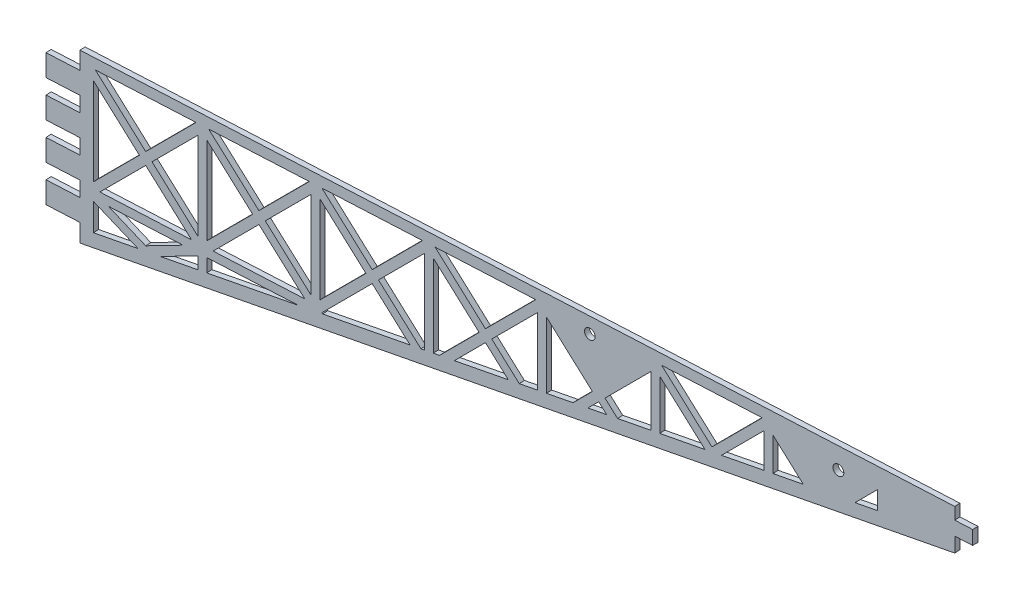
ISO-10303-21;
HEADER;
FILE_DESCRIPTION(('STEP AP214'),'2;1');
FILE_NAME('part.step','',(''),(''),'','','');
FILE_SCHEMA(('AUTOMOTIVE_DESIGN { 1 0 10303 214 1 1 1 1 }'));
ENDSEC;
DATA;
#1=APPLICATION_CONTEXT('core data for automotive mechanical design processes');
#2=APPLICATION_PROTOCOL_DEFINITION('international standard','automotive_design',2000,#1);
#3=PRODUCT_CONTEXT('',#1,'mechanical');
#4=PRODUCT('Part','Part','',(#3));
#5=PRODUCT_RELATED_PRODUCT_CATEGORY('part','',(#4));
#6=PRODUCT_DEFINITION_FORMATION('','',#4);
#7=PRODUCT_DEFINITION_CONTEXT('part definition',#1,'design');
#8=PRODUCT_DEFINITION('design','',#6,#7);
#9=PRODUCT_DEFINITION_SHAPE('','',#8);
#10=(LENGTH_UNIT() NAMED_UNIT(*) SI_UNIT(.MILLI.,.METRE.));
#11=(NAMED_UNIT(*) PLANE_ANGLE_UNIT() SI_UNIT($,.RADIAN.));
#12=(NAMED_UNIT(*) SI_UNIT($,.STERADIAN.) SOLID_ANGLE_UNIT());
#13=UNCERTAINTY_MEASURE_WITH_UNIT(LENGTH_MEASURE(1.E-05),#10,'distance_accuracy_value','');
#14=(GEOMETRIC_REPRESENTATION_CONTEXT(3) GLOBAL_UNCERTAINTY_ASSIGNED_CONTEXT((#13)) GLOBAL_UNIT_ASSIGNED_CONTEXT((#10,
#11,#12)) REPRESENTATION_CONTEXT('',''));
#15=CARTESIAN_POINT('',(0.,0.,0.));
#16=DIRECTION('',(0.,0.,1.));
#17=DIRECTION('',(1.,0.,0.));
#18=AXIS2_PLACEMENT_3D('',#15,#16,#17);
#19=CARTESIAN_POINT('',(0.0946084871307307,104.3,1.8642638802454));
#20=DIRECTION('',(-0.0506832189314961,0.,-0.998714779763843));
#21=DIRECTION('',(-0.998714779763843,0.,0.0506832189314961));
#22=AXIS2_PLACEMENT_3D('',#19,#20,#21);
#23=PLANE('',#22);
#24=CARTESIAN_POINT('',(524.856699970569,92.87,-24.7665946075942));
#25=DIRECTION('',(-0.0506832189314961,0.,-0.998714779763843));
#26=DIRECTION('',(-0.998714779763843,0.,0.0506832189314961));
#27=AXIS2_PLACEMENT_3D('',#24,#25,#26);
#28=CIRCLE('',#27,3.04800000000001);
#29=CARTESIAN_POINT('',(521.812617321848,92.87,-24.612112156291));
#30=VERTEX_POINT('',#29);
#31=EDGE_CURVE('E1376',#30,#30,#28,.T.);
#32=ORIENTED_EDGE('',*,*,#31,.T.);
#33=EDGE_LOOP('',(#32));
#34=FACE_BOUND('',#33,.T.);
#35=CARTESIAN_POINT('',(385.645846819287,96.172,-17.701860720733));
#36=DIRECTION('',(0.0506832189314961,0.,0.998714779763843));
#37=DIRECTION('',(0.998714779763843,0.,-0.0506832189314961));
#38=AXIS2_PLACEMENT_3D('',#35,#36,#37);
#39=CIRCLE('',#38,2.99999999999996);
#40=CARTESIAN_POINT('',(388.641991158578,96.172,-17.8539103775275));
#41=VERTEX_POINT('',#40);
#42=EDGE_CURVE('E1391',#41,#41,#39,.T.);
#43=ORIENTED_EDGE('',*,*,#42,.F.);
#44=EDGE_LOOP('',(#43));
#45=FACE_BOUND('',#44,.T.);
#46=DIRECTION('',(0.,-1.,0.));
#47=VECTOR('',#46,1.);
#48=CARTESIAN_POINT('',(590.012852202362,104.3,-28.073167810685));
#49=LINE('',#48,#47);
#50=CARTESIAN_POINT('',(590.012852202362,105.2882632,-28.0731678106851));
#51=VERTEX_POINT('',#50);
#52=CARTESIAN_POINT('',(590.012852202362,98.3,-28.073167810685));
#53=VERTEX_POINT('',#52);
#54=EDGE_CURVE('E1546',#51,#53,#49,.T.);
#55=ORIENTED_EDGE('',*,*,#54,.F.);
#56=DIRECTION('',(-0.998714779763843,0.,0.0506832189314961));
#57=VECTOR('',#56,1.);
#58=CARTESIAN_POINT('',(100.148517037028,105.2882632,-3.21331608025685));
#59=LINE('',#58,#57);
#60=CARTESIAN_POINT('',(100.148517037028,105.2882632,-3.21331608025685));
#61=VERTEX_POINT('',#60);
#62=EDGE_CURVE('E1393',#51,#61,#59,.T.);
#63=ORIENTED_EDGE('',*,*,#62,.T.);
#64=DIRECTION('',(0.,-1.,0.));
#65=VECTOR('',#64,1.);
#66=CARTESIAN_POINT('',(100.148517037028,104.3,-3.21331608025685));
#67=LINE('',#66,#65);
#68=CARTESIAN_POINT('',(100.148517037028,94.9779438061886,-3.21331608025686));
#69=VERTEX_POINT('',#68);
#70=EDGE_CURVE('E1475',#61,#69,#67,.T.);
#71=ORIENTED_EDGE('',*,*,#70,.T.);
#72=DIRECTION('',(0.998714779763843,0.,-0.0506832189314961));
#73=VECTOR('',#72,1.);
#74=CARTESIAN_POINT('',(0.0946084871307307,94.9779438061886,1.8642638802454));
#75=LINE('',#74,#73);
#76=CARTESIAN_POINT('',(81.1230004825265,94.9779438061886,-2.24780075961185));
#77=VERTEX_POINT('',#76);
#78=EDGE_CURVE('E1526',#77,#69,#75,.T.);
#79=ORIENTED_EDGE('',*,*,#78,.F.);
#80=DIRECTION('',(0.,1.,0.));
#81=VECTOR('',#80,1.);
#82=CARTESIAN_POINT('',(81.1230004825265,104.3,-2.24780075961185));
#83=LINE('',#82,#81);
#84=CARTESIAN_POINT('',(81.1230004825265,82.2779438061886,-2.24780075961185));
#85=VERTEX_POINT('',#84);
#86=EDGE_CURVE('E1523',#85,#77,#83,.T.);
#87=ORIENTED_EDGE('',*,*,#86,.F.);
#88=DIRECTION('',(0.998714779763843,0.,-0.0506832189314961));
#89=VECTOR('',#88,1.);
#90=CARTESIAN_POINT('',(0.0946084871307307,82.2779438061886,1.8642638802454));
#91=LINE('',#90,#89);
#92=CARTESIAN_POINT('',(100.148517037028,82.2779438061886,-3.21331608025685));
#93=VERTEX_POINT('',#92);
#94=EDGE_CURVE('E1519',#85,#93,#91,.T.);
#95=ORIENTED_EDGE('',*,*,#94,.T.);
#96=DIRECTION('',(0.,-1.,0.));
#97=VECTOR('',#96,1.);
#98=CARTESIAN_POINT('',(100.148517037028,104.3,-3.21331608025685));
#99=LINE('',#98,#97);
#100=CARTESIAN_POINT('',(100.148517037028,73.3879438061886,-3.21331608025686));
#101=VERTEX_POINT('',#100);
#102=EDGE_CURVE('E1515',#93,#101,#99,.T.);
#103=ORIENTED_EDGE('',*,*,#102,.T.);
#104=DIRECTION('',(-0.998714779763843,0.,0.0506832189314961));
#105=VECTOR('',#104,1.);
#106=CARTESIAN_POINT('',(0.0946084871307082,73.3879438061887,1.8642638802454));
#107=LINE('',#106,#105);
#108=CARTESIAN_POINT('',(81.1230004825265,73.3879438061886,-2.24780075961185));
#109=VERTEX_POINT('',#108);
#110=EDGE_CURVE('E1511',#101,#109,#107,.T.);
#111=ORIENTED_EDGE('',*,*,#110,.T.);
#112=DIRECTION('',(0.,1.,0.));
#113=VECTOR('',#112,1.);
#114=CARTESIAN_POINT('',(81.1230004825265,104.3,-2.24780075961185));
#115=LINE('',#114,#113);
#116=CARTESIAN_POINT('',(81.1230004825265,60.6879438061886,-2.24780075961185));
#117=VERTEX_POINT('',#116);
#118=EDGE_CURVE('E1508',#117,#109,#115,.T.);
#119=ORIENTED_EDGE('',*,*,#118,.F.);
#120=DIRECTION('',(0.998714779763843,0.,-0.0506832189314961));
#121=VECTOR('',#120,1.);
#122=CARTESIAN_POINT('',(0.0946084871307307,60.6879438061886,1.8642638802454));
#123=LINE('',#122,#121);
#124=CARTESIAN_POINT('',(100.148517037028,60.6879438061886,-3.21331608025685));
#125=VERTEX_POINT('',#124);
#126=EDGE_CURVE('E1504',#117,#125,#123,.T.);
#127=ORIENTED_EDGE('',*,*,#126,.T.);
#128=DIRECTION('',(0.,-1.,0.));
#129=VECTOR('',#128,1.);
#130=CARTESIAN_POINT('',(100.148517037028,104.3,-3.21331608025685));
#131=LINE('',#130,#129);
#132=CARTESIAN_POINT('',(100.148517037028,51.7979438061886,-3.21331608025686));
#133=VERTEX_POINT('',#132);
#134=EDGE_CURVE('E1500',#125,#133,#131,.T.);
#135=ORIENTED_EDGE('',*,*,#134,.T.);
#136=DIRECTION('',(0.998714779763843,0.,-0.0506832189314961));
#137=VECTOR('',#136,1.);
#138=CARTESIAN_POINT('',(0.0946084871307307,51.7979438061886,1.8642638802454));
#139=LINE('',#138,#137);
#140=CARTESIAN_POINT('',(81.1230004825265,51.7979438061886,-2.24780075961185));
#141=VERTEX_POINT('',#140);
#142=EDGE_CURVE('E1497',#141,#133,#139,.T.);
#143=ORIENTED_EDGE('',*,*,#142,.F.);
#144=DIRECTION('',(0.,1.,0.));
#145=VECTOR('',#144,1.);
#146=CARTESIAN_POINT('',(81.1230004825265,104.3,-2.24780075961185));
#147=LINE('',#146,#145);
#148=CARTESIAN_POINT('',(81.1230004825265,39.0979438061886,-2.24780075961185));
#149=VERTEX_POINT('',#148);
#150=EDGE_CURVE('E1494',#149,#141,#147,.T.);
#151=ORIENTED_EDGE('',*,*,#150,.F.);
#152=DIRECTION('',(-0.998714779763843,0.,0.0506832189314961));
#153=VECTOR('',#152,1.);
#154=CARTESIAN_POINT('',(0.0946084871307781,39.0979438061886,1.8642638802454));
#155=LINE('',#154,#153);
#156=CARTESIAN_POINT('',(100.148517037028,39.0979438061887,-3.21331608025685));
#157=VERTEX_POINT('',#156);
#158=EDGE_CURVE('E1491',#157,#149,#155,.T.);
#159=ORIENTED_EDGE('',*,*,#158,.F.);
#160=DIRECTION('',(0.,-1.,0.));
#161=VECTOR('',#160,1.);
#162=CARTESIAN_POINT('',(100.148517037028,104.3,-3.21331608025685));
#163=LINE('',#162,#161);
#164=CARTESIAN_POINT('',(100.148517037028,30.2079438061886,-3.21331608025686));
#165=VERTEX_POINT('',#164);
#166=EDGE_CURVE('E1487',#157,#165,#163,.T.);
#167=ORIENTED_EDGE('',*,*,#166,.T.);
#168=DIRECTION('',(0.998714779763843,0.,-0.0506832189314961));
#169=VECTOR('',#168,1.);
#170=CARTESIAN_POINT('',(0.0946084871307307,30.2079438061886,1.8642638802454));
#171=LINE('',#170,#169);
#172=CARTESIAN_POINT('',(81.1230004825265,30.2079438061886,-2.24780075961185));
#173=VERTEX_POINT('',#172);
#174=EDGE_CURVE('E1484',#173,#165,#171,.T.);
#175=ORIENTED_EDGE('',*,*,#174,.F.);
#176=DIRECTION('',(0.,1.,0.));
#177=VECTOR('',#176,1.);
#178=CARTESIAN_POINT('',(81.1230004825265,104.3,-2.24780075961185));
#179=LINE('',#178,#177);
#180=CARTESIAN_POINT('',(81.1230004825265,17.5079438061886,-2.24780075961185));
#181=VERTEX_POINT('',#180);
#182=EDGE_CURVE('E1481',#181,#173,#179,.T.);
#183=ORIENTED_EDGE('',*,*,#182,.F.);
#184=DIRECTION('',(0.998714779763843,0.,-0.0506832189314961));
#185=VECTOR('',#184,1.);
#186=CARTESIAN_POINT('',(0.0946084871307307,17.5079438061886,1.8642638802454));
#187=LINE('',#186,#185);
#188=CARTESIAN_POINT('',(100.148517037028,17.5079438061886,-3.21331608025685));
#189=VERTEX_POINT('',#188);
#190=EDGE_CURVE('E1354',#181,#189,#187,.T.);
#191=ORIENTED_EDGE('',*,*,#190,.T.);
#192=DIRECTION('',(0.,-1.,0.));
#193=VECTOR('',#192,1.);
#194=CARTESIAN_POINT('',(100.148517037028,104.3,-3.21331608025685));
#195=LINE('',#194,#193);
#196=CARTESIAN_POINT('',(100.148517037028,6.98837470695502,-3.21331608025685));
#197=VERTEX_POINT('',#196);
#198=EDGE_CURVE('E1347',#189,#197,#195,.T.);
#199=ORIENTED_EDGE('',*,*,#198,.T.);
#200=DIRECTION('',(0.987382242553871,0.150218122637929,-0.0501081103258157));
#201=VECTOR('',#200,1.);
#202=CARTESIAN_POINT('',(100.148517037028,6.98837470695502,-3.21331608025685));
#203=LINE('',#202,#201);
#204=CARTESIAN_POINT('',(590.012852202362,81.5152373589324,-28.0731678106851));
#205=VERTEX_POINT('',#204);
#206=EDGE_CURVE('E1352',#197,#205,#203,.T.);
#207=ORIENTED_EDGE('',*,*,#206,.T.);
#208=DIRECTION('',(0.,1.,0.));
#209=VECTOR('',#208,1.);
#210=CARTESIAN_POINT('',(590.012852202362,104.3,-28.073167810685));
#211=LINE('',#210,#209);
#212=CARTESIAN_POINT('',(590.012852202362,90.16,-28.073167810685));
#213=VERTEX_POINT('',#212);
#214=EDGE_CURVE('E1540',#205,#213,#211,.T.);
#215=ORIENTED_EDGE('',*,*,#214,.T.);
#216=DIRECTION('',(-0.998714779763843,0.,0.0506832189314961));
#217=VECTOR('',#216,1.);
#218=CARTESIAN_POINT('',(0.0946084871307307,90.16,1.8642638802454));
#219=LINE('',#218,#217);
#220=CARTESIAN_POINT('',(600.,90.16,-28.58));
#221=VERTEX_POINT('',#220);
#222=EDGE_CURVE('E1558',#221,#213,#219,.T.);
#223=ORIENTED_EDGE('',*,*,#222,.F.);
#224=DIRECTION('',(0.,-1.,0.));
#225=VECTOR('',#224,1.);
#226=CARTESIAN_POINT('',(600.,104.3,-28.58));
#227=LINE('',#226,#225);
#228=CARTESIAN_POINT('',(600.,98.3,-28.58));
#229=VERTEX_POINT('',#228);
#230=EDGE_CURVE('E2214',#229,#221,#227,.T.);
#231=ORIENTED_EDGE('',*,*,#230,.F.);
#232=DIRECTION('',(0.998714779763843,0.,-0.0506832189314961));
#233=VECTOR('',#232,1.);
#234=CARTESIAN_POINT('',(0.0946084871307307,98.3,1.8642638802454));
#235=LINE('',#234,#233);
#236=EDGE_CURVE('E1552',#53,#229,#235,.T.);
#237=ORIENTED_EDGE('',*,*,#236,.F.);
#238=EDGE_LOOP('',(#55,#63,#71,#79,#87,#95,#103,#111,#119,#127,#135,#143,#151,#159,#167,#175,
#183,#191,#199,#207,#215,#223,#231,#237));
#239=FACE_BOUND('',#238,.T.);
#240=DIRECTION('',(0.706197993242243,-0.707106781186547,-0.0358384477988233));
#241=VECTOR('',#240,1.);
#242=CARTESIAN_POINT('',(290.744144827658,291.023565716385,-12.8857472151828));
#243=LINE('',#242,#241);
#244=CARTESIAN_POINT('',(488.249080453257,93.2644660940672,-22.9088149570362));
#245=VERTEX_POINT('',#244);
#246=CARTESIAN_POINT('',(505.180565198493,76.3111926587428,-23.7680614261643));
#247=VERTEX_POINT('',#246);
#248=EDGE_CURVE('E660',#245,#247,#243,.T.);
#249=ORIENTED_EDGE('',*,*,#248,.T.);
#250=DIRECTION('',(0.987382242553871,0.150218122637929,-0.0501081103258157));
#251=VECTOR('',#250,1.);
#252=CARTESIAN_POINT('',(0.173435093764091,-0.519460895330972,1.86026355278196));
#253=LINE('',#252,#251);
#254=CARTESIAN_POINT('',(488.249080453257,73.7352744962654,-22.9088149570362));
#255=VERTEX_POINT('',#254);
#256=EDGE_CURVE('E2177',#255,#247,#253,.T.);
#257=ORIENTED_EDGE('',*,*,#256,.F.);
#258=DIRECTION('',(0.,-1.,0.));
#259=VECTOR('',#258,1.);
#260=CARTESIAN_POINT('',(488.249080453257,0.,-22.9088149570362));
#261=LINE('',#260,#259);
#262=EDGE_CURVE('E2187',#245,#255,#261,.T.);
#263=ORIENTED_EDGE('',*,*,#262,.F.);
#264=EDGE_LOOP('',(#249,#257,#263));
#265=FACE_BOUND('',#264,.T.);
#266=DIRECTION('',(0.,1.,0.));
#267=VECTOR('',#266,1.);
#268=CARTESIAN_POINT('',(546.673895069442,0.,-25.8737832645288));
#269=LINE('',#268,#267);
#270=CARTESIAN_POINT('',(546.673895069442,82.6238949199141,-25.8737832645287));
#271=VERTEX_POINT('',#270);
#272=CARTESIAN_POINT('',(546.673895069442,93.2644660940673,-25.8737832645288));
#273=VERTEX_POINT('',#272);
#274=EDGE_CURVE('E2205',#271,#273,#269,.T.);
#275=ORIENTED_EDGE('',*,*,#274,.F.);
#276=DIRECTION('',(0.987382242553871,0.150218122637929,-0.0501081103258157));
#277=VECTOR('',#276,1.);
#278=CARTESIAN_POINT('',(0.173435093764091,-0.519460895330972,1.86026355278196));
#279=LINE('',#278,#277);
#280=CARTESIAN_POINT('',(534.143032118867,80.7174774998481,-25.237861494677));
#281=VERTEX_POINT('',#280);
#282=EDGE_CURVE('E668',#281,#271,#279,.T.);
#283=ORIENTED_EDGE('',*,*,#282,.F.);
#284=DIRECTION('',(-0.706197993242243,-0.707106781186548,0.0358384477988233));
#285=VECTOR('',#284,1.);
#286=CARTESIAN_POINT('',(226.811951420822,-227.009099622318,-9.64128801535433));
#287=LINE('',#286,#285);
#288=EDGE_CURVE('E2196',#273,#281,#287,.T.);
#289=ORIENTED_EDGE('',*,*,#288,.F.);
#290=EDGE_LOOP('',(#275,#283,#289));
#291=FACE_BOUND('',#290,.T.);
#292=DIRECTION('',(-0.897361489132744,0.438940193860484,0.0455396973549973));
#293=VECTOR('',#292,1.);
#294=CARTESIAN_POINT('',(33.3584419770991,68.1791245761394,0.176176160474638));
#295=LINE('',#294,#293);
#296=CARTESIAN_POINT('',(132.612410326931,19.6295081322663,-4.86080808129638));
#297=VERTEX_POINT('',#296);
#298=CARTESIAN_POINT('',(107.738749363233,31.796343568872,-3.59850854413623));
#299=VERTEX_POINT('',#298);
#300=EDGE_CURVE('E2059',#297,#299,#295,.T.);
#301=ORIENTED_EDGE('',*,*,#300,.F.);
#302=DIRECTION('',(0.987382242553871,0.150218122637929,-0.0501081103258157));
#303=VECTOR('',#302,1.);
#304=CARTESIAN_POINT('',(0.173435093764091,-0.519460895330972,1.86026355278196));
#305=LINE('',#304,#303);
#306=CARTESIAN_POINT('',(107.738749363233,15.8452850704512,-3.59850854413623));
#307=VERTEX_POINT('',#306);
#308=EDGE_CURVE('E2063',#307,#297,#305,.T.);
#309=ORIENTED_EDGE('',*,*,#308,.F.);
#310=DIRECTION('',(0.,-1.,0.));
#311=VECTOR('',#310,1.);
#312=CARTESIAN_POINT('',(107.738749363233,0.,-3.59850854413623));
#313=LINE('',#312,#311);
#314=EDGE_CURVE('E2048',#299,#307,#313,.T.);
#315=ORIENTED_EDGE('',*,*,#314,.F.);
#316=EDGE_LOOP('',(#301,#309,#315));
#317=FACE_BOUND('',#316,.T.);
#318=DIRECTION('',(0.,-1.,0.));
#319=VECTOR('',#318,1.);
#320=CARTESIAN_POINT('',(166.163563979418,0.,-6.56347685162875));
#321=LINE('',#320,#319);
#322=CARTESIAN_POINT('',(166.163563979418,93.2644660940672,-6.56347685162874));
#323=VERTEX_POINT('',#322);
#324=CARTESIAN_POINT('',(166.163563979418,41.8355339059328,-6.56347685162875));
#325=VERTEX_POINT('',#324);
#326=EDGE_CURVE('E2078',#323,#325,#321,.T.);
#327=ORIENTED_EDGE('',*,*,#326,.T.);
#328=DIRECTION('',(0.706197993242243,-0.707106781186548,-0.0358384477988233));
#329=VECTOR('',#328,1.);
#330=CARTESIAN_POINT('',(104.019969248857,104.059099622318,-3.40978624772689));
#331=LINE('',#330,#329);
#332=CARTESIAN_POINT('',(140.482146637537,67.5499999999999,-5.26018493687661));
#333=VERTEX_POINT('',#332);
#334=EDGE_CURVE('E2093',#333,#325,#331,.T.);
#335=ORIENTED_EDGE('',*,*,#334,.F.);
#336=DIRECTION('',(-0.706197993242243,-0.707106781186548,0.0358384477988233));
#337=VECTOR('',#336,1.);
#338=CARTESIAN_POINT('',(36.5567858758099,-36.5090996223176,0.0138651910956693));
#339=LINE('',#338,#337);
#340=EDGE_CURVE('E2104',#323,#333,#339,.T.);
#341=ORIENTED_EDGE('',*,*,#340,.F.);
#342=EDGE_LOOP('',(#327,#335,#341));
#343=FACE_BOUND('',#342,.T.);
#344=DIRECTION('',(-0.706197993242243,-0.707106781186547,0.0358384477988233));
#345=VECTOR('',#344,1.);
#346=CARTESIAN_POINT('',(64.7349901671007,-64.7235657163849,-1.41613477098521));
#347=LINE('',#346,#345);
#348=CARTESIAN_POINT('',(228.54774947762,99.3,-9.72937706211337));
#349=VERTEX_POINT('',#348);
#350=CARTESIAN_POINT('',(200.369545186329,71.0855339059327,-8.2993771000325));
#351=VERTEX_POINT('',#350);
#352=EDGE_CURVE('E1995',#349,#351,#347,.T.);
#353=ORIENTED_EDGE('',*,*,#352,.T.);
#354=DIRECTION('',(0.706197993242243,-0.707106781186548,-0.0358384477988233));
#355=VECTOR('',#354,1.);
#356=CARTESIAN_POINT('',(135.729163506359,135.809099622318,-5.01897844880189));
#357=LINE('',#356,#355);
#358=CARTESIAN_POINT('',(172.191340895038,99.3,-6.86937713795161));
#359=VERTEX_POINT('',#358);
#360=EDGE_CURVE('E1982',#359,#351,#357,.T.);
#361=ORIENTED_EDGE('',*,*,#360,.F.);
#362=DIRECTION('',(-0.998714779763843,0.,0.0506832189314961));
#363=VECTOR('',#362,1.);
#364=CARTESIAN_POINT('',(0.0946084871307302,99.3,1.86426388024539));
#365=LINE('',#364,#363);
#366=EDGE_CURVE('E1991',#349,#359,#365,.T.);
#367=ORIENTED_EDGE('',*,*,#366,.F.);
#368=EDGE_LOOP('',(#353,#361,#367));
#369=FACE_BOUND('',#368,.T.);
#370=DIRECTION('',(-0.706197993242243,-0.707106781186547,0.0358384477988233));
#371=VECTOR('',#370,1.);
#372=CARTESIAN_POINT('',(64.7349901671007,-64.7235657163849,-1.41613477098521));
#373=LINE('',#372,#371);
#374=CARTESIAN_POINT('',(196.838555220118,67.55,-8.12018486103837));
#375=VERTEX_POINT('',#374);
#376=CARTESIAN_POINT('',(171.157137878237,41.8355339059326,-6.81689294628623));
#377=VERTEX_POINT('',#376);
#378=EDGE_CURVE('E2011',#375,#377,#373,.T.);
#379=ORIENTED_EDGE('',*,*,#378,.T.);
#380=DIRECTION('',(0.,-1.,0.));
#381=VECTOR('',#380,1.);
#382=CARTESIAN_POINT('',(171.157137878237,0.,-6.81689294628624));
#383=LINE('',#382,#381);
#384=CARTESIAN_POINT('',(171.157137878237,93.2644660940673,-6.81689294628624));
#385=VERTEX_POINT('',#384);
#386=EDGE_CURVE('E2028',#385,#377,#383,.T.);
#387=ORIENTED_EDGE('',*,*,#386,.F.);
#388=DIRECTION('',(0.706197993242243,-0.707106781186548,-0.0358384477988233));
#389=VECTOR('',#388,1.);
#390=CARTESIAN_POINT('',(132.198173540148,132.273565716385,-4.83978620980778));
#391=LINE('',#390,#389);
#392=EDGE_CURVE('E2037',#385,#375,#391,.T.);
#393=ORIENTED_EDGE('',*,*,#392,.T.);
#394=EDGE_LOOP('',(#379,#387,#393));
#395=FACE_BOUND('',#394,.T.);
#396=DIRECTION('',(0.998714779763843,0.,-0.0506832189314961));
#397=VECTOR('',#396,1.);
#398=CARTESIAN_POINT('',(0.0946084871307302,38.2999999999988,1.86426388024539));
#399=LINE('',#398,#397);
#400=CARTESIAN_POINT('',(111.269739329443,38.2999999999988,-3.77770078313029));
#401=VERTEX_POINT('',#400);
#402=CARTESIAN_POINT('',(162.632574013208,38.2999999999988,-6.3842846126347));
#403=VERTEX_POINT('',#402);
#404=EDGE_CURVE('E2146',#401,#403,#399,.T.);
#405=ORIENTED_EDGE('',*,*,#404,.F.);
#406=DIRECTION('',(-0.706197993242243,-0.707106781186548,0.0358384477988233));
#407=VECTOR('',#406,1.);
#408=CARTESIAN_POINT('',(36.5567858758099,-36.5090996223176,0.0138651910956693));
#409=LINE('',#408,#407);
#410=CARTESIAN_POINT('',(136.951156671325,64.0144660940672,-5.0809926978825));
#411=VERTEX_POINT('',#410);
#412=EDGE_CURVE('E2150',#411,#401,#409,.T.);
#413=ORIENTED_EDGE('',*,*,#412,.F.);
#414=DIRECTION('',(0.706197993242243,-0.707106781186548,-0.0358384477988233));
#415=VECTOR('',#414,1.);
#416=CARTESIAN_POINT('',(100.488979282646,100.523565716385,-3.23059400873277));
#417=LINE('',#416,#415);
#418=EDGE_CURVE('E2135',#411,#403,#417,.T.);
#419=ORIENTED_EDGE('',*,*,#418,.T.);
#420=EDGE_LOOP('',(#405,#413,#419));
#421=FACE_BOUND('',#420,.T.);
#422=DIRECTION('',(0.,-1.,0.));
#423=VECTOR('',#422,1.);
#424=CARTESIAN_POINT('',(419.837118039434,0.,-19.4370144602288));
#425=LINE('',#424,#423);
#426=CARTESIAN_POINT('',(419.837118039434,93.2644660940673,-19.4370144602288));
#427=VERTEX_POINT('',#426);
#428=CARTESIAN_POINT('',(419.837118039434,63.327231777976,-19.4370144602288));
#429=VERTEX_POINT('',#428);
#430=EDGE_CURVE('E1665',#427,#429,#425,.T.);
#431=ORIENTED_EDGE('',*,*,#430,.T.);
#432=DIRECTION('',(0.987382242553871,0.150218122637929,-0.0501081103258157));
#433=VECTOR('',#432,1.);
#434=CARTESIAN_POINT('',(0.173435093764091,-0.519460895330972,1.86026355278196));
#435=LINE('',#434,#433);
#436=CARTESIAN_POINT('',(401.204172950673,60.4924572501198,-18.4914215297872));
#437=VERTEX_POINT('',#436);
#438=EDGE_CURVE('E1686',#437,#429,#435,.T.);
#439=ORIENTED_EDGE('',*,*,#438,.F.);
#440=DIRECTION('',(0.706197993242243,-0.707106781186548,-0.0358384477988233));
#441=VECTOR('',#440,1.);
#442=CARTESIAN_POINT('',(230.856746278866,231.059099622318,-9.84655505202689));
#443=LINE('',#442,#441);
#444=CARTESIAN_POINT('',(394.155700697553,67.55,-18.1337225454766));
#445=VERTEX_POINT('',#444);
#446=EDGE_CURVE('E1698',#445,#437,#443,.T.);
#447=ORIENTED_EDGE('',*,*,#446,.F.);
#448=DIRECTION('',(-0.706197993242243,-0.707106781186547,0.0358384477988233));
#449=VECTOR('',#448,1.);
#450=CARTESIAN_POINT('',(163.393562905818,-163.509099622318,-6.42290361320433));
#451=LINE('',#450,#449);
#452=EDGE_CURVE('E1702',#427,#445,#451,.T.);
#453=ORIENTED_EDGE('',*,*,#452,.F.);
#454=EDGE_LOOP('',(#431,#439,#447,#453));
#455=FACE_BOUND('',#454,.T.);
#456=DIRECTION('',(0.706197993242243,-0.707106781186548,-0.0358384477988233));
#457=VECTOR('',#456,1.);
#458=CARTESIAN_POINT('',(227.325756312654,227.523565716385,-9.66736281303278));
#459=LINE('',#458,#457);
#460=CARTESIAN_POINT('',(361.412303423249,93.2644660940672,-16.4720461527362));
#461=VERTEX_POINT('',#460);
#462=CARTESIAN_POINT('',(387.09372076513,67.5499999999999,-17.7753380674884));
#463=VERTEX_POINT('',#462);
#464=EDGE_CURVE('E1720',#461,#463,#459,.T.);
#465=ORIENTED_EDGE('',*,*,#464,.T.);
#466=DIRECTION('',(-0.706197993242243,-0.707106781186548,0.0358384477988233));
#467=VECTOR('',#466,1.);
#468=CARTESIAN_POINT('',(159.862572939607,-159.973565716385,-6.24371137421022));
#469=LINE('',#468,#467);
#470=CARTESIAN_POINT('',(376.254310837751,56.696641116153,-17.2252549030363));
#471=VERTEX_POINT('',#470);
#472=EDGE_CURVE('E1737',#463,#471,#469,.T.);
#473=ORIENTED_EDGE('',*,*,#472,.T.);
#474=DIRECTION('',(0.987382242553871,0.150218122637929,-0.0501081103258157));
#475=VECTOR('',#474,1.);
#476=CARTESIAN_POINT('',(0.173435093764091,-0.519460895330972,1.86026355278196));
#477=LINE('',#476,#475);
#478=CARTESIAN_POINT('',(361.412303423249,54.4386113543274,-16.4720461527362));
#479=VERTEX_POINT('',#478);
#480=EDGE_CURVE('E1749',#479,#471,#477,.T.);
#481=ORIENTED_EDGE('',*,*,#480,.F.);
#482=DIRECTION('',(0.,-1.,0.));
#483=VECTOR('',#482,1.);
#484=CARTESIAN_POINT('',(361.412303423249,0.,-16.4720461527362));
#485=LINE('',#484,#483);
#486=EDGE_CURVE('E1753',#461,#479,#485,.T.);
#487=ORIENTED_EDGE('',*,*,#486,.F.);
#488=EDGE_LOOP('',(#465,#473,#481,#487));
#489=FACE_BOUND('',#488,.T.);
#490=DIRECTION('',(0.,-1.,0.));
#491=VECTOR('',#490,1.);
#492=CARTESIAN_POINT('',(483.255506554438,0.,-22.6553988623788));
#493=LINE('',#492,#491);
#494=CARTESIAN_POINT('',(483.255506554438,93.2644660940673,-22.6553988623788));
#495=VERTEX_POINT('',#494);
#496=CARTESIAN_POINT('',(483.255506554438,72.975563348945,-22.6553988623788));
#497=VERTEX_POINT('',#496);
#498=EDGE_CURVE('E1573',#495,#497,#493,.T.);
#499=ORIENTED_EDGE('',*,*,#498,.T.);
#500=DIRECTION('',(0.987382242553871,0.150218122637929,-0.0501081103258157));
#501=VECTOR('',#500,1.);
#502=CARTESIAN_POINT('',(0.173435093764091,-0.519460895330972,1.86026355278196));
#503=LINE('',#502,#501);
#504=CARTESIAN_POINT('',(459.362291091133,69.3405030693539,-21.4428554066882));
#505=VERTEX_POINT('',#504);
#506=EDGE_CURVE('E1590',#505,#497,#503,.T.);
#507=ORIENTED_EDGE('',*,*,#506,.F.);
#508=DIRECTION('',(-0.706197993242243,-0.707106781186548,0.0358384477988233));
#509=VECTOR('',#508,1.);
#510=CARTESIAN_POINT('',(195.10275716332,-195.259099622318,-8.03209581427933));
#511=LINE('',#510,#509);
#512=EDGE_CURVE('E1600',#495,#505,#511,.T.);
#513=ORIENTED_EDGE('',*,*,#512,.F.);
#514=EDGE_LOOP('',(#499,#507,#513));
#515=FACE_BOUND('',#514,.T.);
#516=DIRECTION('',(0.706197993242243,-0.707106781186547,-0.0358384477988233));
#517=VECTOR('',#516,1.);
#518=CARTESIAN_POINT('',(259.034950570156,259.273565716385,-11.2765550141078));
#519=LINE('',#518,#517);
#520=CARTESIAN_POINT('',(424.830691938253,93.2644660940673,-19.6904305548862));
#521=VERTEX_POINT('',#520);
#522=CARTESIAN_POINT('',(450.127119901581,67.9354848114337,-20.9741848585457));
#523=VERTEX_POINT('',#522);
#524=EDGE_CURVE('E1646',#521,#523,#519,.T.);
#525=ORIENTED_EDGE('',*,*,#524,.T.);
#526=DIRECTION('',(0.987382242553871,0.150218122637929,-0.0501081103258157));
#527=VECTOR('',#526,1.);
#528=CARTESIAN_POINT('',(0.173435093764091,-0.519460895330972,1.86026355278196));
#529=LINE('',#528,#527);
#530=CARTESIAN_POINT('',(424.830691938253,64.0869429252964,-19.6904305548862));
#531=VERTEX_POINT('',#530);
#532=EDGE_CURVE('E1633',#531,#523,#529,.T.);
#533=ORIENTED_EDGE('',*,*,#532,.F.);
#534=DIRECTION('',(0.,-1.,0.));
#535=VECTOR('',#534,1.);
#536=CARTESIAN_POINT('',(424.830691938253,0.,-19.6904305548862));
#537=LINE('',#536,#535);
#538=EDGE_CURVE('E1642',#521,#531,#537,.T.);
#539=ORIENTED_EDGE('',*,*,#538,.F.);
#540=EDGE_LOOP('',(#525,#533,#539));
#541=FACE_BOUND('',#540,.T.);
#542=DIRECTION('',(0.706197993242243,-0.707106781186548,-0.0358384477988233));
#543=VECTOR('',#542,1.);
#544=CARTESIAN_POINT('',(132.198173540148,132.273565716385,-4.83978620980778));
#545=LINE('',#544,#543);
#546=CARTESIAN_POINT('',(200.369545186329,64.0144660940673,-8.29937710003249));
#547=VERTEX_POINT('',#546);
#548=CARTESIAN_POINT('',(226.050962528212,38.2999999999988,-9.60266901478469));
#549=VERTEX_POINT('',#548);
#550=EDGE_CURVE('E1880',#547,#549,#545,.T.);
#551=ORIENTED_EDGE('',*,*,#550,.T.);
#552=DIRECTION('',(0.998714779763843,0.,-0.0506832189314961));
#553=VECTOR('',#552,1.);
#554=CARTESIAN_POINT('',(0.0946084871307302,38.2999999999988,1.86426388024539));
#555=LINE('',#554,#553);
#556=CARTESIAN_POINT('',(174.688127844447,38.2999999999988,-6.99608518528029));
#557=VERTEX_POINT('',#556);
#558=EDGE_CURVE('E1865',#557,#549,#555,.T.);
#559=ORIENTED_EDGE('',*,*,#558,.F.);
#560=DIRECTION('',(-0.706197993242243,-0.707106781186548,0.0358384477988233));
#561=VECTOR('',#560,1.);
#562=CARTESIAN_POINT('',(68.2659801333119,-68.2590996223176,-1.59532700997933));
#563=LINE('',#562,#561);
#564=EDGE_CURVE('E1876',#547,#557,#563,.T.);
#565=ORIENTED_EDGE('',*,*,#564,.F.);
#566=EDGE_LOOP('',(#551,#559,#565));
#567=FACE_BOUND('',#566,.T.);
#568=DIRECTION('',(0.706197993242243,-0.707106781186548,-0.0358384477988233));
#569=VECTOR('',#568,1.);
#570=CARTESIAN_POINT('',(163.90736779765,164.023565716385,-6.44897841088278));
#571=LINE('',#570,#569);
#572=CARTESIAN_POINT('',(263.787933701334,64.0144660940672,-11.5177615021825));
#573=VERTEX_POINT('',#572);
#574=CARTESIAN_POINT('',(284.966784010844,42.8083612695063,-12.59255515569));
#575=VERTEX_POINT('',#574);
#576=EDGE_CURVE('E1931',#573,#575,#571,.T.);
#577=ORIENTED_EDGE('',*,*,#576,.T.);
#578=DIRECTION('',(0.987382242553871,0.150218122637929,-0.0501081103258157));
#579=VECTOR('',#578,1.);
#580=CARTESIAN_POINT('',(0.173435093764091,-0.519460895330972,1.86026355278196));
#581=LINE('',#580,#579);
#582=CARTESIAN_POINT('',(236.043837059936,35.3653337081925,-10.1097918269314));
#583=VERTEX_POINT('',#582);
#584=EDGE_CURVE('E1911',#583,#575,#581,.T.);
#585=ORIENTED_EDGE('',*,*,#584,.F.);
#586=DIRECTION('',(0.706197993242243,-0.707106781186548,-0.0358384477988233));
#587=VECTOR('',#586,1.);
#588=CARTESIAN_POINT('',(135.729163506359,135.809099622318,-5.01897844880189));
#589=LINE('',#588,#587);
#590=CARTESIAN_POINT('',(235.609729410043,35.8,-10.0877615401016));
#591=VERTEX_POINT('',#590);
#592=EDGE_CURVE('E1923',#591,#583,#589,.T.);
#593=ORIENTED_EDGE('',*,*,#592,.F.);
#594=DIRECTION('',(-0.706197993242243,-0.707106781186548,0.0358384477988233));
#595=VECTOR('',#594,1.);
#596=CARTESIAN_POINT('',(99.9751743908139,-100.009099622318,-3.20451921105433));
#597=LINE('',#596,#595);
#598=EDGE_CURVE('E1927',#573,#591,#597,.T.);
#599=ORIENTED_EDGE('',*,*,#598,.F.);
#600=EDGE_LOOP('',(#577,#585,#593,#599));
#601=FACE_BOUND('',#600,.T.);
#602=DIRECTION('',(0.,-1.,0.));
#603=VECTOR('',#602,1.);
#604=CARTESIAN_POINT('',(293.000341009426,0.,-13.0002456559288));
#605=LINE('',#604,#603);
#606=CARTESIAN_POINT('',(293.000341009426,93.2644660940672,-13.0002456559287));
#607=VERTEX_POINT('',#606);
#608=CARTESIAN_POINT('',(293.000341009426,44.0305686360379,-13.0002456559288));
#609=VERTEX_POINT('',#608);
#610=EDGE_CURVE('E1786',#607,#609,#605,.T.);
#611=ORIENTED_EDGE('',*,*,#610,.T.);
#612=DIRECTION('',(0.987382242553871,0.150218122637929,-0.0501081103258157));
#613=VECTOR('',#612,1.);
#614=CARTESIAN_POINT('',(0.173435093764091,-0.519460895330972,1.86026355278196));
#615=LINE('',#614,#613);
#616=CARTESIAN_POINT('',(291.097282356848,43.7410415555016,-12.90366839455));
#617=VERTEX_POINT('',#616);
#618=EDGE_CURVE('E1764',#617,#609,#615,.T.);
#619=ORIENTED_EDGE('',*,*,#618,.F.);
#620=DIRECTION('',(0.706197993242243,-0.707106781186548,-0.0358384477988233));
#621=VECTOR('',#620,1.);
#622=CARTESIAN_POINT('',(167.438357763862,167.559099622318,-6.62817064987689));
#623=LINE('',#622,#621);
#624=CARTESIAN_POINT('',(267.318923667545,67.55,-11.6969537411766));
#625=VERTEX_POINT('',#624);
#626=EDGE_CURVE('E1778',#625,#617,#623,.T.);
#627=ORIENTED_EDGE('',*,*,#626,.F.);
#628=DIRECTION('',(-0.706197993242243,-0.707106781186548,0.0358384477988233));
#629=VECTOR('',#628,1.);
#630=CARTESIAN_POINT('',(99.9751743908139,-100.009099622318,-3.20451921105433));
#631=LINE('',#630,#629);
#632=EDGE_CURVE('E1782',#607,#625,#631,.T.);
#633=ORIENTED_EDGE('',*,*,#632,.F.);
#634=EDGE_LOOP('',(#611,#619,#627,#633));
#635=FACE_BOUND('',#634,.T.);
#636=DIRECTION('',(-0.706197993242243,-0.707106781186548,0.0358384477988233));
#637=VECTOR('',#636,1.);
#638=CARTESIAN_POINT('',(128.153378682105,-128.223565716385,-4.63451917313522));
#639=LINE('',#638,#637);
#640=CARTESIAN_POINT('',(323.675332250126,67.5500000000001,-14.5569536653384));
#641=VERTEX_POINT('',#640);
#642=CARTESIAN_POINT('',(301.473569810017,45.3196666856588,-13.4302488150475));
#643=VERTEX_POINT('',#642);
#644=EDGE_CURVE('E1774',#641,#643,#639,.T.);
#645=ORIENTED_EDGE('',*,*,#644,.T.);
#646=DIRECTION('',(0.987382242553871,0.150218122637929,-0.0501081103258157));
#647=VECTOR('',#646,1.);
#648=CARTESIAN_POINT('',(0.173435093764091,-0.519460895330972,1.86026355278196));
#649=LINE('',#648,#647);
#650=CARTESIAN_POINT('',(297.993914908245,44.7902797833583,-13.2536617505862));
#651=VERTEX_POINT('',#650);
#652=EDGE_CURVE('E1838',#651,#643,#649,.T.);
#653=ORIENTED_EDGE('',*,*,#652,.F.);
#654=DIRECTION('',(0.,-1.,0.));
#655=VECTOR('',#654,1.);
#656=CARTESIAN_POINT('',(297.993914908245,0.,-13.2536617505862));
#657=LINE('',#656,#655);
#658=CARTESIAN_POINT('',(297.993914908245,93.2644660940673,-13.2536617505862));
#659=VERTEX_POINT('',#658);
#660=EDGE_CURVE('E1850',#659,#651,#657,.T.);
#661=ORIENTED_EDGE('',*,*,#660,.F.);
#662=DIRECTION('',(0.706197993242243,-0.707106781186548,-0.0358384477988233));
#663=VECTOR('',#662,1.);
#664=CARTESIAN_POINT('',(195.616562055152,195.773565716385,-8.05817061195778));
#665=LINE('',#664,#663);
#666=EDGE_CURVE('E1854',#659,#641,#665,.T.);
#667=ORIENTED_EDGE('',*,*,#666,.T.);
#668=EDGE_LOOP('',(#645,#653,#661,#667));
#669=FACE_BOUND('',#668,.T.);
#670=DIRECTION('',(0.706197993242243,-0.707106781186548,-0.0358384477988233));
#671=VECTOR('',#670,1.);
#672=CARTESIAN_POINT('',(199.147552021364,199.309099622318,-8.23736285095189));
#673=LINE('',#672,#671);
#674=CARTESIAN_POINT('',(299.028117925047,99.3,-13.3061459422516));
#675=VERTEX_POINT('',#674);
#676=CARTESIAN_POINT('',(327.206322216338,71.0855339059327,-14.7361459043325));
#677=VERTEX_POINT('',#676);
#678=EDGE_CURVE('E1826',#675,#677,#673,.T.);
#679=ORIENTED_EDGE('',*,*,#678,.F.);
#680=DIRECTION('',(-0.998714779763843,0.,0.0506832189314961));
#681=VECTOR('',#680,1.);
#682=CARTESIAN_POINT('',(0.0946084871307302,99.3,1.86426388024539));
#683=LINE('',#682,#681);
#684=CARTESIAN_POINT('',(355.384526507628,99.3,-16.1661458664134));
#685=VERTEX_POINT('',#684);
#686=EDGE_CURVE('E1830',#685,#675,#683,.T.);
#687=ORIENTED_EDGE('',*,*,#686,.F.);
#688=DIRECTION('',(-0.706197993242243,-0.707106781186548,0.0358384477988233));
#689=VECTOR('',#688,1.);
#690=CARTESIAN_POINT('',(128.153378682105,-128.223565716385,-4.63451917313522));
#691=LINE('',#690,#689);
#692=EDGE_CURVE('E1817',#685,#677,#691,.T.);
#693=ORIENTED_EDGE('',*,*,#692,.T.);
#694=EDGE_LOOP('',(#679,#687,#693));
#695=FACE_BOUND('',#694,.T.);
#696=DIRECTION('',(-0.706197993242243,-0.707106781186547,0.0358384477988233));
#697=VECTOR('',#696,1.);
#698=CARTESIAN_POINT('',(96.4441844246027,-96.4735657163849,-3.02532697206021));
#699=LINE('',#698,#697);
#700=CARTESIAN_POINT('',(291.966137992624,99.3,-12.9477614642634));
#701=VERTEX_POINT('',#700);
#702=CARTESIAN_POINT('',(263.787933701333,71.0855339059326,-11.5177615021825));
#703=VERTEX_POINT('',#702);
#704=EDGE_CURVE('E1808',#701,#703,#699,.T.);
#705=ORIENTED_EDGE('',*,*,#704,.T.);
#706=DIRECTION('',(0.706197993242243,-0.707106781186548,-0.0358384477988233));
#707=VECTOR('',#706,1.);
#708=CARTESIAN_POINT('',(167.438357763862,167.559099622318,-6.62817064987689));
#709=LINE('',#708,#707);
#710=CARTESIAN_POINT('',(235.609729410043,99.3,-10.0877615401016));
#711=VERTEX_POINT('',#710);
#712=EDGE_CURVE('E1795',#711,#703,#709,.T.);
#713=ORIENTED_EDGE('',*,*,#712,.F.);
#714=DIRECTION('',(-0.998714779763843,0.,0.0506832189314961));
#715=VECTOR('',#714,1.);
#716=CARTESIAN_POINT('',(0.0946084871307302,99.3,1.86426388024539));
#717=LINE('',#716,#715);
#718=EDGE_CURVE('E1804',#701,#711,#717,.T.);
#719=ORIENTED_EDGE('',*,*,#718,.F.);
#720=EDGE_LOOP('',(#705,#713,#719));
#721=FACE_BOUND('',#720,.T.);
#722=DIRECTION('',(0.706197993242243,-0.707106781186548,-0.0358384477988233));
#723=VECTOR('',#722,1.);
#724=CARTESIAN_POINT('',(163.90736779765,164.023565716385,-6.44897841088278));
#725=LINE('',#724,#723);
#726=CARTESIAN_POINT('',(234.575526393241,93.2644660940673,-10.0352773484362));
#727=VERTEX_POINT('',#726);
#728=CARTESIAN_POINT('',(260.256943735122,67.5499999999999,-11.3385692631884));
#729=VERTEX_POINT('',#728);
#730=EDGE_CURVE('E1896',#727,#729,#725,.T.);
#731=ORIENTED_EDGE('',*,*,#730,.T.);
#732=DIRECTION('',(-0.706197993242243,-0.707106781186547,0.0358384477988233));
#733=VECTOR('',#732,1.);
#734=CARTESIAN_POINT('',(96.4441844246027,-96.4735657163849,-3.02532697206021));
#735=LINE('',#734,#733);
#736=CARTESIAN_POINT('',(234.575526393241,41.8355339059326,-10.0352773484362));
#737=VERTEX_POINT('',#736);
#738=EDGE_CURVE('E1940',#729,#737,#735,.T.);
#739=ORIENTED_EDGE('',*,*,#738,.T.);
#740=DIRECTION('',(0.,-1.,0.));
#741=VECTOR('',#740,1.);
#742=CARTESIAN_POINT('',(234.575526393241,0.,-10.0352773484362));
#743=LINE('',#742,#741);
#744=EDGE_CURVE('E1949',#727,#737,#743,.T.);
#745=ORIENTED_EDGE('',*,*,#744,.F.);
#746=EDGE_LOOP('',(#731,#739,#745));
#747=FACE_BOUND('',#746,.T.);
#748=DIRECTION('',(0.998714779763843,0.,-0.0506832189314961));
#749=VECTOR('',#748,1.);
#750=CARTESIAN_POINT('',(0.0946084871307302,33.2999999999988,1.86426388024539));
#751=LINE('',#750,#749);
#752=CARTESIAN_POINT('',(171.157137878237,33.2999999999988,-6.81689294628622));
#753=VERTEX_POINT('',#752);
#754=CARTESIAN_POINT('',(222.468418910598,33.2999999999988,-9.42086050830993));
#755=VERTEX_POINT('',#754);
#756=EDGE_CURVE('E1872',#753,#755,#751,.T.);
#757=ORIENTED_EDGE('',*,*,#756,.T.);
#758=DIRECTION('',(0.987382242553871,0.150218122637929,-0.0501081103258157));
#759=VECTOR('',#758,1.);
#760=CARTESIAN_POINT('',(0.173435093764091,-0.519460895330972,1.86026355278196));
#761=LINE('',#760,#759);
#762=CARTESIAN_POINT('',(171.157137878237,25.4936166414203,-6.81689294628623));
#763=VERTEX_POINT('',#762);
#764=EDGE_CURVE('E1889',#763,#755,#761,.T.);
#765=ORIENTED_EDGE('',*,*,#764,.F.);
#766=DIRECTION('',(0.,-1.,0.));
#767=VECTOR('',#766,1.);
#768=CARTESIAN_POINT('',(171.157137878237,0.,-6.81689294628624));
#769=LINE('',#768,#767);
#770=EDGE_CURVE('E1900',#753,#763,#769,.T.);
#771=ORIENTED_EDGE('',*,*,#770,.F.);
#772=EDGE_LOOP('',(#757,#765,#771));
#773=FACE_BOUND('',#772,.T.);
#774=DIRECTION('',(-0.706197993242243,-0.707106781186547,0.0358384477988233));
#775=VECTOR('',#774,1.);
#776=CARTESIAN_POINT('',(191.571767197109,-191.723565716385,-7.85290357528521));
#777=LINE('',#776,#775);
#778=CARTESIAN_POINT('',(482.221303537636,99.3,-22.6029146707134));
#779=VERTEX_POINT('',#778);
#780=CARTESIAN_POINT('',(454.043099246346,71.0855339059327,-21.1729147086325));
#781=VERTEX_POINT('',#780);
#782=EDGE_CURVE('E1624',#779,#781,#777,.T.);
#783=ORIENTED_EDGE('',*,*,#782,.T.);
#784=DIRECTION('',(0.706197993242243,-0.707106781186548,-0.0358384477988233));
#785=VECTOR('',#784,1.);
#786=CARTESIAN_POINT('',(262.565940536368,262.809099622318,-11.4557472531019));
#787=LINE('',#786,#785);
#788=CARTESIAN_POINT('',(425.864894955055,99.3,-19.7429147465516));
#789=VERTEX_POINT('',#788);
#790=EDGE_CURVE('E1611',#789,#781,#787,.T.);
#791=ORIENTED_EDGE('',*,*,#790,.F.);
#792=DIRECTION('',(-0.998714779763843,0.,0.0506832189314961));
#793=VECTOR('',#792,1.);
#794=CARTESIAN_POINT('',(0.0946084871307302,99.3,1.86426388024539));
#795=LINE('',#794,#793);
#796=EDGE_CURVE('E1620',#779,#789,#795,.T.);
#797=ORIENTED_EDGE('',*,*,#796,.F.);
#798=EDGE_LOOP('',(#783,#791,#797));
#799=FACE_BOUND('',#798,.T.);
#800=DIRECTION('',(0.706197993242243,-0.707106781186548,-0.0358384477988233));
#801=VECTOR('',#800,1.);
#802=CARTESIAN_POINT('',(227.325756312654,227.523565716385,-9.66736281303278));
#803=LINE('',#802,#801);
#804=CARTESIAN_POINT('',(390.624710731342,64.0144660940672,-17.9545303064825));
#805=VERTEX_POINT('',#804);
#806=CARTESIAN_POINT('',(395.073674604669,59.5597769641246,-18.1803082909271));
#807=VERTEX_POINT('',#806);
#808=EDGE_CURVE('E1581',#805,#807,#803,.T.);
#809=ORIENTED_EDGE('',*,*,#808,.T.);
#810=DIRECTION('',(0.987382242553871,0.150218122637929,-0.0501081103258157));
#811=VECTOR('',#810,1.);
#812=CARTESIAN_POINT('',(0.173435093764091,-0.519460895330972,1.86026355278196));
#813=LINE('',#812,#811);
#814=CARTESIAN_POINT('',(384.581550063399,57.9635286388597,-17.6478493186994));
#815=VERTEX_POINT('',#814);
#816=EDGE_CURVE('E1566',#815,#807,#813,.T.);
#817=ORIENTED_EDGE('',*,*,#816,.F.);
#818=DIRECTION('',(-0.706197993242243,-0.707106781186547,0.0358384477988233));
#819=VECTOR('',#818,1.);
#820=CARTESIAN_POINT('',(163.393562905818,-163.509099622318,-6.42290361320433));
#821=LINE('',#820,#819);
#822=EDGE_CURVE('E1577',#805,#815,#821,.T.);
#823=ORIENTED_EDGE('',*,*,#822,.F.);
#824=EDGE_LOOP('',(#809,#817,#823));
#825=FACE_BOUND('',#824,.T.);
#826=DIRECTION('',(0.706197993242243,-0.707106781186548,-0.0358384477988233));
#827=VECTOR('',#826,1.);
#828=CARTESIAN_POINT('',(195.616562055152,195.773565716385,-8.05817061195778));
#829=LINE('',#828,#827);
#830=CARTESIAN_POINT('',(327.206322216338,64.0144660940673,-14.7361459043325));
#831=VERTEX_POINT('',#830);
#832=CARTESIAN_POINT('',(340.020229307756,51.1840691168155,-15.3864317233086));
#833=VERTEX_POINT('',#832);
#834=EDGE_CURVE('E1728',#831,#833,#829,.T.);
#835=ORIENTED_EDGE('',*,*,#834,.T.);
#836=DIRECTION('',(0.987382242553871,0.150218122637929,-0.0501081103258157));
#837=VECTOR('',#836,1.);
#838=CARTESIAN_POINT('',(0.173435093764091,-0.519460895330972,1.86026355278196));
#839=LINE('',#838,#837);
#840=CARTESIAN_POINT('',(309.800809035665,46.5865542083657,-13.8528432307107));
#841=VERTEX_POINT('',#840);
#842=EDGE_CURVE('E1713',#841,#833,#839,.T.);
#843=ORIENTED_EDGE('',*,*,#842,.F.);
#844=DIRECTION('',(-0.706197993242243,-0.707106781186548,0.0358384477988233));
#845=VECTOR('',#844,1.);
#846=CARTESIAN_POINT('',(131.684368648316,-131.759099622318,-4.81371141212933));
#847=LINE('',#846,#845);
#848=EDGE_CURVE('E1724',#831,#841,#847,.T.);
#849=ORIENTED_EDGE('',*,*,#848,.F.);
#850=EDGE_LOOP('',(#835,#843,#849));
#851=FACE_BOUND('',#850,.T.);
#852=DIRECTION('',(0.,-1.,0.));
#853=VECTOR('',#852,1.);
#854=CARTESIAN_POINT('',(356.41872952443,0.,-16.2186300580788));
#855=LINE('',#854,#853);
#856=CARTESIAN_POINT('',(356.41872952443,93.2644660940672,-16.2186300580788));
#857=VERTEX_POINT('',#856);
#858=CARTESIAN_POINT('',(356.41872952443,53.678900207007,-16.2186300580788));
#859=VERTEX_POINT('',#858);
#860=EDGE_CURVE('E1677',#857,#859,#855,.T.);
#861=ORIENTED_EDGE('',*,*,#860,.T.);
#862=DIRECTION('',(0.987382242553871,0.150218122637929,-0.0501081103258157));
#863=VECTOR('',#862,1.);
#864=CARTESIAN_POINT('',(0.173435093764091,-0.519460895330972,1.86026355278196));
#865=LINE('',#864,#863);
#866=CARTESIAN_POINT('',(346.150727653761,52.1167494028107,-15.6975449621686));
#867=VERTEX_POINT('',#866);
#868=EDGE_CURVE('E1655',#867,#859,#865,.T.);
#869=ORIENTED_EDGE('',*,*,#868,.F.);
#870=DIRECTION('',(0.706197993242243,-0.707106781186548,-0.0358384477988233));
#871=VECTOR('',#870,1.);
#872=CARTESIAN_POINT('',(199.147552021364,199.309099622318,-8.23736285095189));
#873=LINE('',#872,#871);
#874=CARTESIAN_POINT('',(330.737312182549,67.55,-14.9153381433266));
#875=VERTEX_POINT('',#874);
#876=EDGE_CURVE('E1669',#875,#867,#873,.T.);
#877=ORIENTED_EDGE('',*,*,#876,.F.);
#878=DIRECTION('',(-0.706197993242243,-0.707106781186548,0.0358384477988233));
#879=VECTOR('',#878,1.);
#880=CARTESIAN_POINT('',(131.684368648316,-131.759099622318,-4.81371141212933));
#881=LINE('',#880,#879);
#882=EDGE_CURVE('E1673',#857,#875,#881,.T.);
#883=ORIENTED_EDGE('',*,*,#882,.F.);
#884=EDGE_LOOP('',(#861,#869,#877,#883));
#885=FACE_BOUND('',#884,.T.);
#886=DIRECTION('',(0.998714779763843,0.,-0.0506832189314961));
#887=VECTOR('',#886,1.);
#888=CARTESIAN_POINT('',(0.0946084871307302,33.2999999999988,1.86426388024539));
#889=LINE('',#888,#887);
#890=CARTESIAN_POINT('',(116.041134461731,33.2999999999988,-4.01984165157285));
#891=VERTEX_POINT('',#890);
#892=CARTESIAN_POINT('',(157.861178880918,33.2999999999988,-6.14214374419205));
#893=VERTEX_POINT('',#892);
#894=EDGE_CURVE('E2142',#891,#893,#889,.T.);
#895=ORIENTED_EDGE('',*,*,#894,.T.);
#896=DIRECTION('',(0.897361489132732,0.438940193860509,-0.0455396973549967));
#897=VECTOR('',#896,1.);
#898=CARTESIAN_POINT('',(17.3747847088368,-35.4182655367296,0.987321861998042));
#899=LINE('',#898,#897);
#900=CARTESIAN_POINT('',(136.951156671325,23.0719600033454,-5.08099269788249));
#901=VERTEX_POINT('',#900);
#902=EDGE_CURVE('E2158',#901,#893,#899,.T.);
#903=ORIENTED_EDGE('',*,*,#902,.F.);
#904=DIRECTION('',(-0.897361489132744,0.438940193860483,0.0455396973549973));
#905=VECTOR('',#904,1.);
#906=CARTESIAN_POINT('',(35.5503222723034,72.6717059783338,0.064941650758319));
#907=LINE('',#906,#905);
#908=EDGE_CURVE('E2167',#901,#891,#907,.T.);
#909=ORIENTED_EDGE('',*,*,#908,.T.);
#910=EDGE_LOOP('',(#895,#903,#909));
#911=FACE_BOUND('',#910,.T.);
#912=DIRECTION('',(-0.706197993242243,-0.707106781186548,0.0358384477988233));
#913=VECTOR('',#912,1.);
#914=CARTESIAN_POINT('',(33.0257959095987,-32.9735657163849,0.193057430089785));
#915=LINE('',#914,#913);
#916=CARTESIAN_POINT('',(165.129360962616,99.3,-6.51099265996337));
#917=VERTEX_POINT('',#916);
#918=CARTESIAN_POINT('',(136.951156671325,71.0855339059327,-5.0809926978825));
#919=VERTEX_POINT('',#918);
#920=EDGE_CURVE('E2019',#917,#919,#915,.T.);
#921=ORIENTED_EDGE('',*,*,#920,.T.);
#922=DIRECTION('',(0.706197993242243,-0.707106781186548,-0.0358384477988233));
#923=VECTOR('',#922,1.);
#924=CARTESIAN_POINT('',(104.019969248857,104.059099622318,-3.40978624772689));
#925=LINE('',#924,#923);
#926=CARTESIAN_POINT('',(108.772952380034,99.3,-3.65099273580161));
#927=VERTEX_POINT('',#926);
#928=EDGE_CURVE('E2004',#927,#919,#925,.T.);
#929=ORIENTED_EDGE('',*,*,#928,.F.);
#930=DIRECTION('',(-0.998714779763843,0.,0.0506832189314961));
#931=VECTOR('',#930,1.);
#932=CARTESIAN_POINT('',(0.0946084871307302,99.3,1.86426388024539));
#933=LINE('',#932,#931);
#934=EDGE_CURVE('E2015',#917,#927,#933,.T.);
#935=ORIENTED_EDGE('',*,*,#934,.F.);
#936=EDGE_LOOP('',(#921,#929,#935));
#937=FACE_BOUND('',#936,.T.);
#938=DIRECTION('',(0.,-1.,0.));
#939=VECTOR('',#938,1.);
#940=CARTESIAN_POINT('',(229.581952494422,0.,-9.78186125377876));
#941=LINE('',#940,#939);
#942=CARTESIAN_POINT('',(229.581952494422,93.2644660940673,-9.78186125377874));
#943=VERTEX_POINT('',#942);
#944=CARTESIAN_POINT('',(229.581952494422,41.8355339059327,-9.78186125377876));
#945=VERTEX_POINT('',#944);
#946=EDGE_CURVE('E1973',#943,#945,#941,.T.);
#947=ORIENTED_EDGE('',*,*,#946,.T.);
#948=DIRECTION('',(0.706197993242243,-0.707106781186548,-0.0358384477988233));
#949=VECTOR('',#948,1.);
#950=CARTESIAN_POINT('',(135.729163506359,135.809099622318,-5.01897844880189));
#951=LINE('',#950,#949);
#952=CARTESIAN_POINT('',(203.900535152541,67.55,-8.47856933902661));
#953=VERTEX_POINT('',#952);
#954=EDGE_CURVE('E1960',#953,#945,#951,.T.);
#955=ORIENTED_EDGE('',*,*,#954,.F.);
#956=DIRECTION('',(-0.706197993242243,-0.707106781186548,0.0358384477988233));
#957=VECTOR('',#956,1.);
#958=CARTESIAN_POINT('',(68.2659801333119,-68.2590996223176,-1.59532700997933));
#959=LINE('',#958,#957);
#960=EDGE_CURVE('E1969',#943,#953,#959,.T.);
#961=ORIENTED_EDGE('',*,*,#960,.F.);
#962=EDGE_LOOP('',(#947,#955,#961));
#963=FACE_BOUND('',#962,.T.);
#964=DIRECTION('',(0.706197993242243,-0.707106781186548,-0.0358384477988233));
#965=VECTOR('',#964,1.);
#966=CARTESIAN_POINT('',(100.488979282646,100.523565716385,-3.23059400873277));
#967=LINE('',#966,#965);
#968=CARTESIAN_POINT('',(107.738749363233,93.2644660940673,-3.59850854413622));
#969=VERTEX_POINT('',#968);
#970=CARTESIAN_POINT('',(133.420166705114,67.55,-4.90180045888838));
#971=VERTEX_POINT('',#970);
#972=EDGE_CURVE('E2100',#969,#971,#967,.T.);
#973=ORIENTED_EDGE('',*,*,#972,.T.);
#974=DIRECTION('',(-0.706197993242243,-0.707106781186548,0.0358384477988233));
#975=VECTOR('',#974,1.);
#976=CARTESIAN_POINT('',(33.0257959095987,-32.9735657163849,0.193057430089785));
#977=LINE('',#976,#975);
#978=CARTESIAN_POINT('',(107.738749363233,41.8355339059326,-3.59850854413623));
#979=VERTEX_POINT('',#978);
#980=EDGE_CURVE('E2115',#971,#979,#977,.T.);
#981=ORIENTED_EDGE('',*,*,#980,.T.);
#982=DIRECTION('',(0.,-1.,0.));
#983=VECTOR('',#982,1.);
#984=CARTESIAN_POINT('',(107.738749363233,0.,-3.59850854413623));
#985=LINE('',#984,#983);
#986=EDGE_CURVE('E2124',#969,#979,#985,.T.);
#987=ORIENTED_EDGE('',*,*,#986,.F.);
#988=EDGE_LOOP('',(#973,#981,#987));
#989=FACE_BOUND('',#988,.T.);
#990=DIRECTION('',(0.897361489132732,0.438940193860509,-0.0455396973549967));
#991=VECTOR('',#990,1.);
#992=CARTESIAN_POINT('',(19.5666650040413,-39.9108469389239,0.876087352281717));
#993=LINE('',#992,#991);
#994=CARTESIAN_POINT('',(145.207246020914,21.545658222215,-5.49997636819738));
#995=VERTEX_POINT('',#994);
#996=CARTESIAN_POINT('',(166.163563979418,31.7963435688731,-6.56347685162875));
#997=VERTEX_POINT('',#996);
#998=EDGE_CURVE('E2055',#995,#997,#993,.T.);
#999=ORIENTED_EDGE('',*,*,#998,.T.);
#1000=DIRECTION('',(0.,-1.,0.));
#1001=VECTOR('',#1000,1.);
#1002=CARTESIAN_POINT('',(166.163563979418,0.,-6.56347685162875));
#1003=LINE('',#1002,#1001);
#1004=CARTESIAN_POINT('',(166.163563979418,24.7339054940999,-6.56347685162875));
#1005=VERTEX_POINT('',#1004);
#1006=EDGE_CURVE('E2071',#997,#1005,#1003,.T.);
#1007=ORIENTED_EDGE('',*,*,#1006,.T.);
#1008=DIRECTION('',(0.987382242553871,0.150218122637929,-0.0501081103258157));
#1009=VECTOR('',#1008,1.);
#1010=CARTESIAN_POINT('',(0.173435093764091,-0.519460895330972,1.86026355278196));
#1011=LINE('',#1010,#1009);
#1012=EDGE_CURVE('E2082',#995,#1005,#1011,.T.);
#1013=ORIENTED_EDGE('',*,*,#1012,.F.);
#1014=EDGE_LOOP('',(#999,#1007,#1013));
#1015=FACE_BOUND('',#1014,.T.);
#1016=ADVANCED_FACE('F643',(#34,#45,#239,#265,#291,#317,#343,#369,#395,#421,#455,#489,#515,#541,
#567,#601,#635,#669,#695,#721,#747,#773,#799,#825,#851,#885,#911,#937,#963,#989,#1015),#23,.F.);
#1017=CARTESIAN_POINT('',(-0.0661039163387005,104.3,-1.3025802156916));
#1018=DIRECTION('',(0.0506832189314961,0.,0.998714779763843));
#1019=DIRECTION('',(0.998714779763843,0.,-0.0506832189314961));
#1020=AXIS2_PLACEMENT_3D('',#1017,#1018,#1019);
#1021=PLANE('',#1020);
#1022=CARTESIAN_POINT('',(524.695987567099,92.87,-27.9334387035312));
#1023=DIRECTION('',(0.0506832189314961,0.,0.998714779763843));
#1024=DIRECTION('',(0.998714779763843,0.,-0.0506832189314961));
#1025=AXIS2_PLACEMENT_3D('',#1022,#1023,#1024);
#1026=CIRCLE('',#1025,3.04800000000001);
#1027=CARTESIAN_POINT('',(527.740070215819,92.87,-28.0879211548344));
#1028=VERTEX_POINT('',#1027);
#1029=EDGE_CURVE('E646',#1028,#1028,#1026,.T.);
#1030=ORIENTED_EDGE('',*,*,#1029,.T.);
#1031=EDGE_LOOP('',(#1030));
#1032=FACE_BOUND('',#1031,.T.);
#1033=CARTESIAN_POINT('',(385.485134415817,96.172,-20.86870481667));
#1034=DIRECTION('',(0.0506832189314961,0.,0.998714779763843));
#1035=DIRECTION('',(0.998714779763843,0.,-0.0506832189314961));
#1036=AXIS2_PLACEMENT_3D('',#1033,#1034,#1035);
#1037=CIRCLE('',#1036,2.99999999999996);
#1038=CARTESIAN_POINT('',(388.481278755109,96.172,-21.0207544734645));
#1039=VERTEX_POINT('',#1038);
#1040=EDGE_CURVE('E1407',#1039,#1039,#1037,.T.);
#1041=ORIENTED_EDGE('',*,*,#1040,.T.);
#1042=EDGE_LOOP('',(#1041));
#1043=FACE_BOUND('',#1042,.T.);
#1044=DIRECTION('',(-0.998714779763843,0.,0.0506832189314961));
#1045=VECTOR('',#1044,1.);
#1046=CARTESIAN_POINT('',(-0.0661039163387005,94.9779438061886,-1.3025802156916));
#1047=LINE('',#1046,#1045);
#1048=CARTESIAN_POINT('',(99.9878046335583,94.9779438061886,-6.38016017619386));
#1049=VERTEX_POINT('',#1048);
#1050=CARTESIAN_POINT('',(80.9622880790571,94.9779438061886,-5.41464485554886));
#1051=VERTEX_POINT('',#1050);
#1052=EDGE_CURVE('E12',#1049,#1051,#1047,.T.);
#1053=ORIENTED_EDGE('',*,*,#1052,.F.);
#1054=DIRECTION('',(0.,1.,0.));
#1055=VECTOR('',#1054,1.);
#1056=CARTESIAN_POINT('',(99.9878046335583,104.3,-6.38016017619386));
#1057=LINE('',#1056,#1055);
#1058=CARTESIAN_POINT('',(99.9878046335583,105.2882632,-6.38016017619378));
#1059=VERTEX_POINT('',#1058);
#1060=EDGE_CURVE('E1359',#1049,#1059,#1057,.T.);
#1061=ORIENTED_EDGE('',*,*,#1060,.T.);
#1062=DIRECTION('',(0.998714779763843,0.,-0.0506832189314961));
#1063=VECTOR('',#1062,1.);
#1064=CARTESIAN_POINT('',(99.9878046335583,105.2882632,-6.38016017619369));
#1065=LINE('',#1064,#1063);
#1066=CARTESIAN_POINT('',(589.852139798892,105.2882632,-31.240011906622));
#1067=VERTEX_POINT('',#1066);
#1068=EDGE_CURVE('E1387',#1059,#1067,#1065,.T.);
#1069=ORIENTED_EDGE('',*,*,#1068,.T.);
#1070=DIRECTION('',(0.,1.,0.));
#1071=VECTOR('',#1070,1.);
#1072=CARTESIAN_POINT('',(589.852139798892,104.3,-31.2400119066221));
#1073=LINE('',#1072,#1071);
#1074=CARTESIAN_POINT('',(589.852139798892,98.3,-31.2400119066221));
#1075=VERTEX_POINT('',#1074);
#1076=EDGE_CURVE('E1543',#1075,#1067,#1073,.T.);
#1077=ORIENTED_EDGE('',*,*,#1076,.F.);
#1078=DIRECTION('',(-0.998714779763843,0.,0.0506832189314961));
#1079=VECTOR('',#1078,1.);
#1080=CARTESIAN_POINT('',(-0.0661039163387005,98.3,-1.3025802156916));
#1081=LINE('',#1080,#1079);
#1082=CARTESIAN_POINT('',(600.,98.3,-31.755));
#1083=VERTEX_POINT('',#1082);
#1084=EDGE_CURVE('E1549',#1083,#1075,#1081,.T.);
#1085=ORIENTED_EDGE('',*,*,#1084,.F.);
#1086=DIRECTION('',(0.,-1.,0.));
#1087=VECTOR('',#1086,1.);
#1088=CARTESIAN_POINT('',(600.,104.3,-31.755));
#1089=LINE('',#1088,#1087);
#1090=CARTESIAN_POINT('',(600.,90.16,-31.755));
#1091=VERTEX_POINT('',#1090);
#1092=EDGE_CURVE('E2153',#1083,#1091,#1089,.T.);
#1093=ORIENTED_EDGE('',*,*,#1092,.T.);
#1094=DIRECTION('',(0.998714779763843,0.,-0.0506832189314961));
#1095=VECTOR('',#1094,1.);
#1096=CARTESIAN_POINT('',(-0.0661039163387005,90.16,-1.3025802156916));
#1097=LINE('',#1096,#1095);
#1098=CARTESIAN_POINT('',(589.852139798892,90.16,-31.2400119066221));
#1099=VERTEX_POINT('',#1098);
#1100=EDGE_CURVE('E1555',#1099,#1091,#1097,.T.);
#1101=ORIENTED_EDGE('',*,*,#1100,.F.);
#1102=DIRECTION('',(0.,-1.,0.));
#1103=VECTOR('',#1102,1.);
#1104=CARTESIAN_POINT('',(589.852139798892,104.3,-31.2400119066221));
#1105=LINE('',#1104,#1103);
#1106=CARTESIAN_POINT('',(589.852139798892,81.5152373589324,-31.2400119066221));
#1107=VERTEX_POINT('',#1106);
#1108=EDGE_CURVE('E1534',#1099,#1107,#1105,.T.);
#1109=ORIENTED_EDGE('',*,*,#1108,.T.);
#1110=DIRECTION('',(-0.987382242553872,-0.150218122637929,0.0501081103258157));
#1111=VECTOR('',#1110,1.);
#1112=CARTESIAN_POINT('',(99.9878046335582,6.98837470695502,-6.38016017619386));
#1113=LINE('',#1112,#1111);
#1114=CARTESIAN_POINT('',(99.9878046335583,6.98837470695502,-6.38016017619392));
#1115=VERTEX_POINT('',#1114);
#1116=EDGE_CURVE('E1384',#1107,#1115,#1113,.T.);
#1117=ORIENTED_EDGE('',*,*,#1116,.T.);
#1118=DIRECTION('',(0.,1.,0.));
#1119=VECTOR('',#1118,1.);
#1120=CARTESIAN_POINT('',(99.9878046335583,104.3,-6.38016017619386));
#1121=LINE('',#1120,#1119);
#1122=CARTESIAN_POINT('',(99.9878046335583,17.5079438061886,-6.38016017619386));
#1123=VERTEX_POINT('',#1122);
#1124=EDGE_CURVE('E1360',#1115,#1123,#1121,.T.);
#1125=ORIENTED_EDGE('',*,*,#1124,.T.);
#1126=DIRECTION('',(-0.998714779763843,0.,0.0506832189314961));
#1127=VECTOR('',#1126,1.);
#1128=CARTESIAN_POINT('',(-0.0661039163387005,17.5079438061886,-1.3025802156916));
#1129=LINE('',#1128,#1127);
#1130=CARTESIAN_POINT('',(80.9622880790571,17.5079438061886,-5.41464485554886));
#1131=VERTEX_POINT('',#1130);
#1132=EDGE_CURVE('E2556',#1123,#1131,#1129,.T.);
#1133=ORIENTED_EDGE('',*,*,#1132,.T.);
#1134=DIRECTION('',(0.,-1.,0.));
#1135=VECTOR('',#1134,1.);
#1136=CARTESIAN_POINT('',(80.9622880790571,104.3,-5.41464485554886));
#1137=LINE('',#1136,#1135);
#1138=CARTESIAN_POINT('',(80.9622880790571,30.2079438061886,-5.41464485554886));
#1139=VERTEX_POINT('',#1138);
#1140=EDGE_CURVE('E2560',#1139,#1131,#1137,.T.);
#1141=ORIENTED_EDGE('',*,*,#1140,.F.);
#1142=DIRECTION('',(-0.998714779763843,0.,0.0506832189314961));
#1143=VECTOR('',#1142,1.);
#1144=CARTESIAN_POINT('',(-0.0661039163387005,30.2079438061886,-1.3025802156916));
#1145=LINE('',#1144,#1143);
#1146=CARTESIAN_POINT('',(99.9878046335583,30.2079438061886,-6.38016017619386));
#1147=VERTEX_POINT('',#1146);
#1148=EDGE_CURVE('E2563',#1147,#1139,#1145,.T.);
#1149=ORIENTED_EDGE('',*,*,#1148,.F.);
#1150=DIRECTION('',(0.,1.,0.));
#1151=VECTOR('',#1150,1.);
#1152=CARTESIAN_POINT('',(99.9878046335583,104.3,-6.38016017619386));
#1153=LINE('',#1152,#1151);
#1154=CARTESIAN_POINT('',(99.9878046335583,39.0979438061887,-6.38016017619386));
#1155=VERTEX_POINT('',#1154);
#1156=EDGE_CURVE('E2566',#1147,#1155,#1153,.T.);
#1157=ORIENTED_EDGE('',*,*,#1156,.T.);
#1158=DIRECTION('',(0.998714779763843,0.,-0.0506832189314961));
#1159=VECTOR('',#1158,1.);
#1160=CARTESIAN_POINT('',(-0.066103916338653,39.0979438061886,-1.3025802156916));
#1161=LINE('',#1160,#1159);
#1162=CARTESIAN_POINT('',(80.9622880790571,39.0979438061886,-5.41464485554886));
#1163=VERTEX_POINT('',#1162);
#1164=EDGE_CURVE('E2570',#1163,#1155,#1161,.T.);
#1165=ORIENTED_EDGE('',*,*,#1164,.F.);
#1166=DIRECTION('',(0.,-1.,0.));
#1167=VECTOR('',#1166,1.);
#1168=CARTESIAN_POINT('',(80.9622880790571,104.3,-5.41464485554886));
#1169=LINE('',#1168,#1167);
#1170=CARTESIAN_POINT('',(80.9622880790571,51.7979438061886,-5.41464485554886));
#1171=VERTEX_POINT('',#1170);
#1172=EDGE_CURVE('E2573',#1171,#1163,#1169,.T.);
#1173=ORIENTED_EDGE('',*,*,#1172,.F.);
#1174=DIRECTION('',(-0.998714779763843,0.,0.0506832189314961));
#1175=VECTOR('',#1174,1.);
#1176=CARTESIAN_POINT('',(-0.0661039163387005,51.7979438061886,-1.3025802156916));
#1177=LINE('',#1176,#1175);
#1178=CARTESIAN_POINT('',(99.9878046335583,51.7979438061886,-6.38016017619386));
#1179=VERTEX_POINT('',#1178);
#1180=EDGE_CURVE('E2576',#1179,#1171,#1177,.T.);
#1181=ORIENTED_EDGE('',*,*,#1180,.F.);
#1182=DIRECTION('',(0.,1.,0.));
#1183=VECTOR('',#1182,1.);
#1184=CARTESIAN_POINT('',(99.9878046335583,104.3,-6.38016017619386));
#1185=LINE('',#1184,#1183);
#1186=CARTESIAN_POINT('',(99.9878046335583,60.6879438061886,-6.38016017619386));
#1187=VERTEX_POINT('',#1186);
#1188=EDGE_CURVE('E2579',#1179,#1187,#1185,.T.);
#1189=ORIENTED_EDGE('',*,*,#1188,.T.);
#1190=DIRECTION('',(-0.998714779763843,0.,0.0506832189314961));
#1191=VECTOR('',#1190,1.);
#1192=CARTESIAN_POINT('',(-0.0661039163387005,60.6879438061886,-1.3025802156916));
#1193=LINE('',#1192,#1191);
#1194=CARTESIAN_POINT('',(80.9622880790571,60.6879438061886,-5.41464485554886));
#1195=VERTEX_POINT('',#1194);
#1196=EDGE_CURVE('E2583',#1187,#1195,#1193,.T.);
#1197=ORIENTED_EDGE('',*,*,#1196,.T.);
#1198=DIRECTION('',(0.,-1.,0.));
#1199=VECTOR('',#1198,1.);
#1200=CARTESIAN_POINT('',(80.9622880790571,104.3,-5.41464485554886));
#1201=LINE('',#1200,#1199);
#1202=CARTESIAN_POINT('',(80.9622880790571,73.3879438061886,-5.41464485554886));
#1203=VERTEX_POINT('',#1202);
#1204=EDGE_CURVE('E2587',#1203,#1195,#1201,.T.);
#1205=ORIENTED_EDGE('',*,*,#1204,.F.);
#1206=DIRECTION('',(0.998714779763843,0.,-0.0506832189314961));
#1207=VECTOR('',#1206,1.);
#1208=CARTESIAN_POINT('',(-0.066103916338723,73.3879438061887,-1.3025802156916));
#1209=LINE('',#1208,#1207);
#1210=CARTESIAN_POINT('',(99.9878046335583,73.3879438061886,-6.38016017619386));
#1211=VERTEX_POINT('',#1210);
#1212=EDGE_CURVE('E2590',#1203,#1211,#1209,.T.);
#1213=ORIENTED_EDGE('',*,*,#1212,.T.);
#1214=DIRECTION('',(0.,1.,0.));
#1215=VECTOR('',#1214,1.);
#1216=CARTESIAN_POINT('',(99.9878046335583,104.3,-6.38016017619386));
#1217=LINE('',#1216,#1215);
#1218=CARTESIAN_POINT('',(99.9878046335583,82.2779438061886,-6.38016017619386));
#1219=VERTEX_POINT('',#1218);
#1220=EDGE_CURVE('E2594',#1211,#1219,#1217,.T.);
#1221=ORIENTED_EDGE('',*,*,#1220,.T.);
#1222=DIRECTION('',(-0.998714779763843,0.,0.0506832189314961));
#1223=VECTOR('',#1222,1.);
#1224=CARTESIAN_POINT('',(-0.0661039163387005,82.2779438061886,-1.3025802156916));
#1225=LINE('',#1224,#1223);
#1226=CARTESIAN_POINT('',(80.9622880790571,82.2779438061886,-5.41464485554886));
#1227=VERTEX_POINT('',#1226);
#1228=EDGE_CURVE('E2598',#1219,#1227,#1225,.T.);
#1229=ORIENTED_EDGE('',*,*,#1228,.T.);
#1230=DIRECTION('',(0.,-1.,0.));
#1231=VECTOR('',#1230,1.);
#1232=CARTESIAN_POINT('',(80.9622880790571,104.3,-5.41464485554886));
#1233=LINE('',#1232,#1231);
#1234=EDGE_CURVE('E652',#1051,#1227,#1233,.T.);
#1235=ORIENTED_EDGE('',*,*,#1234,.F.);
#1236=EDGE_LOOP('',(#1053,#1061,#1069,#1077,#1085,#1093,#1101,#1109,#1117,#1125,#1133,#1141,
#1149,#1157,#1165,#1173,#1181,#1189,#1197,#1205,#1213,#1221,#1229,#1235));
#1237=FACE_BOUND('',#1236,.T.);
#1238=DIRECTION('',(0.706197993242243,-0.707106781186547,-0.0358384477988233));
#1239=VECTOR('',#1238,1.);
#1240=CARTESIAN_POINT('',(238.500456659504,343.173565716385,-13.4094614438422));
#1241=LINE('',#1240,#1239);
#1242=CARTESIAN_POINT('',(488.088368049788,93.2644660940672,-26.0756590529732));
#1243=VERTEX_POINT('',#1242);
#1244=CARTESIAN_POINT('',(505.019852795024,76.3111926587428,-26.9349055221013));
#1245=VERTEX_POINT('',#1244);
#1246=EDGE_CURVE('E2547',#1243,#1245,#1241,.T.);
#1247=ORIENTED_EDGE('',*,*,#1246,.F.);
#1248=DIRECTION('',(0.,-1.,0.));
#1249=VECTOR('',#1248,1.);
#1250=CARTESIAN_POINT('',(488.088368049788,104.3,-26.0756590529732));
#1251=LINE('',#1250,#1249);
#1252=CARTESIAN_POINT('',(488.088368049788,73.7352744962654,-26.0756590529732));
#1253=VERTEX_POINT('',#1252);
#1254=EDGE_CURVE('E2539',#1243,#1253,#1251,.T.);
#1255=ORIENTED_EDGE('',*,*,#1254,.T.);
#1256=DIRECTION('',(0.987382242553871,0.150218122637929,-0.0501081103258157));
#1257=VECTOR('',#1256,1.);
#1258=CARTESIAN_POINT('',(15.4827810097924,1.83411912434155,-2.0916618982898));
#1259=LINE('',#1258,#1257);
#1260=EDGE_CURVE('E2543',#1253,#1245,#1259,.T.);
#1261=ORIENTED_EDGE('',*,*,#1260,.T.);
#1262=EDGE_LOOP('',(#1247,#1255,#1261));
#1263=FACE_BOUND('',#1262,.T.);
#1264=DIRECTION('',(-0.706197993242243,-0.707106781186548,0.0358384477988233));
#1265=VECTOR('',#1264,1.);
#1266=CARTESIAN_POINT('',(278.734214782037,-174.859099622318,-15.4512619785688));
#1267=LINE('',#1266,#1265);
#1268=CARTESIAN_POINT('',(546.513182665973,93.2644660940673,-29.0406273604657));
#1269=VERTEX_POINT('',#1268);
#1270=CARTESIAN_POINT('',(533.982319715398,80.717477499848,-28.404705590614));
#1271=VERTEX_POINT('',#1270);
#1272=EDGE_CURVE('E2531',#1269,#1271,#1267,.T.);
#1273=ORIENTED_EDGE('',*,*,#1272,.T.);
#1274=DIRECTION('',(0.987382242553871,0.150218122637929,-0.0501081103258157));
#1275=VECTOR('',#1274,1.);
#1276=CARTESIAN_POINT('',(15.4827810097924,1.83411912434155,-2.0916618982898));
#1277=LINE('',#1276,#1275);
#1278=CARTESIAN_POINT('',(546.513182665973,82.6238949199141,-29.0406273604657));
#1279=VERTEX_POINT('',#1278);
#1280=EDGE_CURVE('E2535',#1271,#1279,#1277,.T.);
#1281=ORIENTED_EDGE('',*,*,#1280,.T.);
#1282=DIRECTION('',(0.,1.,0.));
#1283=VECTOR('',#1282,1.);
#1284=CARTESIAN_POINT('',(546.513182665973,104.3,-29.0406273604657));
#1285=LINE('',#1284,#1283);
#1286=EDGE_CURVE('E2527',#1279,#1269,#1285,.T.);
#1287=ORIENTED_EDGE('',*,*,#1286,.T.);
#1288=EDGE_LOOP('',(#1273,#1281,#1287));
#1289=FACE_BOUND('',#1288,.T.);
#1290=DIRECTION('',(0.,-1.,0.));
#1291=VECTOR('',#1290,1.);
#1292=CARTESIAN_POINT('',(107.578036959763,104.3,-6.76535264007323));
#1293=LINE('',#1292,#1291);
#1294=CARTESIAN_POINT('',(107.578036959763,31.796343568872,-6.76535264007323));
#1295=VERTEX_POINT('',#1294);
#1296=CARTESIAN_POINT('',(107.578036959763,15.8452850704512,-6.76535264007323));
#1297=VERTEX_POINT('',#1296);
#1298=EDGE_CURVE('E2519',#1295,#1297,#1293,.T.);
#1299=ORIENTED_EDGE('',*,*,#1298,.T.);
#1300=DIRECTION('',(0.987382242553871,0.150218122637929,-0.0501081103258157));
#1301=VECTOR('',#1300,1.);
#1302=CARTESIAN_POINT('',(15.4827810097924,1.83411912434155,-2.0916618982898));
#1303=LINE('',#1302,#1301);
#1304=CARTESIAN_POINT('',(132.451697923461,19.6295081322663,-8.02765217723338));
#1305=VERTEX_POINT('',#1304);
#1306=EDGE_CURVE('E2523',#1297,#1305,#1303,.T.);
#1307=ORIENTED_EDGE('',*,*,#1306,.T.);
#1308=DIRECTION('',(-0.897361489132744,0.438940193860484,0.0455396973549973));
#1309=VECTOR('',#1308,1.);
#1310=CARTESIAN_POINT('',(-7.88479153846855,88.2744484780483,-0.905794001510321));
#1311=LINE('',#1310,#1309);
#1312=EDGE_CURVE('E2515',#1305,#1295,#1311,.T.);
#1313=ORIENTED_EDGE('',*,*,#1312,.T.);
#1314=EDGE_LOOP('',(#1299,#1307,#1313));
#1315=FACE_BOUND('',#1314,.T.);
#1316=DIRECTION('',(0.,-1.,0.));
#1317=VECTOR('',#1316,1.);
#1318=CARTESIAN_POINT('',(166.002851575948,104.3,-9.73032094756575));
#1319=LINE('',#1318,#1317);
#1320=CARTESIAN_POINT('',(166.002851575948,93.2644660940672,-9.73032094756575));
#1321=VERTEX_POINT('',#1320);
#1322=CARTESIAN_POINT('',(166.002851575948,41.8355339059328,-9.73032094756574));
#1323=VERTEX_POINT('',#1322);
#1324=EDGE_CURVE('E2501',#1321,#1323,#1319,.T.);
#1325=ORIENTED_EDGE('',*,*,#1324,.F.);
#1326=DIRECTION('',(-0.706197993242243,-0.707106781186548,0.0358384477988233));
#1327=VECTOR('',#1326,1.);
#1328=CARTESIAN_POINT('',(88.4790492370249,15.6409003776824,-5.79610877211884));
#1329=LINE('',#1328,#1327);
#1330=CARTESIAN_POINT('',(140.321434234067,67.5499999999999,-8.4270290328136));
#1331=VERTEX_POINT('',#1330);
#1332=EDGE_CURVE('E2493',#1321,#1331,#1329,.T.);
#1333=ORIENTED_EDGE('',*,*,#1332,.T.);
#1334=DIRECTION('',(0.706197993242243,-0.707106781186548,-0.0358384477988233));
#1335=VECTOR('',#1334,1.);
#1336=CARTESIAN_POINT('',(51.7762810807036,156.209099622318,-3.93350047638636));
#1337=LINE('',#1336,#1335);
#1338=EDGE_CURVE('E2497',#1331,#1323,#1337,.T.);
#1339=ORIENTED_EDGE('',*,*,#1338,.T.);
#1340=EDGE_LOOP('',(#1325,#1333,#1339));
#1341=FACE_BOUND('',#1340,.T.);
#1342=DIRECTION('',(-0.706197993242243,-0.707106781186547,0.0358384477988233));
#1343=VECTOR('',#1342,1.);
#1344=CARTESIAN_POINT('',(116.657253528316,-12.5735657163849,-7.22610873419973));
#1345=LINE('',#1344,#1343);
#1346=CARTESIAN_POINT('',(228.387037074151,99.3,-12.8962211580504));
#1347=VERTEX_POINT('',#1346);
#1348=CARTESIAN_POINT('',(200.20883278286,71.0855339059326,-11.4662211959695));
#1349=VERTEX_POINT('',#1348);
#1350=EDGE_CURVE('E2479',#1347,#1349,#1345,.T.);
#1351=ORIENTED_EDGE('',*,*,#1350,.F.);
#1352=DIRECTION('',(-0.998714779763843,0.,0.0506832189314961));
#1353=VECTOR('',#1352,1.);
#1354=CARTESIAN_POINT('',(-0.0661039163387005,99.3,-1.3025802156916));
#1355=LINE('',#1354,#1353);
#1356=CARTESIAN_POINT('',(172.030628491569,99.3,-10.0362212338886));
#1357=VERTEX_POINT('',#1356);
#1358=EDGE_CURVE('E2471',#1347,#1357,#1355,.T.);
#1359=ORIENTED_EDGE('',*,*,#1358,.T.);
#1360=DIRECTION('',(0.706197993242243,-0.707106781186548,-0.0358384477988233));
#1361=VECTOR('',#1360,1.);
#1362=CARTESIAN_POINT('',(83.4854753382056,187.959099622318,-5.54269267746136));
#1363=LINE('',#1362,#1361);
#1364=EDGE_CURVE('E2475',#1357,#1349,#1363,.T.);
#1365=ORIENTED_EDGE('',*,*,#1364,.T.);
#1366=EDGE_LOOP('',(#1351,#1359,#1365));
#1367=FACE_BOUND('',#1366,.T.);
#1368=DIRECTION('',(-0.706197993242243,-0.707106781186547,0.0358384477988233));
#1369=VECTOR('',#1368,1.);
#1370=CARTESIAN_POINT('',(116.657253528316,-12.5735657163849,-7.22610873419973));
#1371=LINE('',#1370,#1369);
#1372=CARTESIAN_POINT('',(196.677842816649,67.55,-11.2870289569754));
#1373=VERTEX_POINT('',#1372);
#1374=CARTESIAN_POINT('',(170.996425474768,41.8355339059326,-9.98373704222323));
#1375=VERTEX_POINT('',#1374);
#1376=EDGE_CURVE('E2457',#1373,#1375,#1371,.T.);
#1377=ORIENTED_EDGE('',*,*,#1376,.F.);
#1378=DIRECTION('',(0.706197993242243,-0.707106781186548,-0.0358384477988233));
#1379=VECTOR('',#1378,1.);
#1380=CARTESIAN_POINT('',(79.9544853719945,184.423565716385,-5.36350043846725));
#1381=LINE('',#1380,#1379);
#1382=CARTESIAN_POINT('',(170.996425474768,93.2644660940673,-9.98373704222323));
#1383=VERTEX_POINT('',#1382);
#1384=EDGE_CURVE('E2450',#1383,#1373,#1381,.T.);
#1385=ORIENTED_EDGE('',*,*,#1384,.F.);
#1386=DIRECTION('',(0.,-1.,0.));
#1387=VECTOR('',#1386,1.);
#1388=CARTESIAN_POINT('',(170.996425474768,104.3,-9.98373704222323));
#1389=LINE('',#1388,#1387);
#1390=EDGE_CURVE('E2453',#1383,#1375,#1389,.T.);
#1391=ORIENTED_EDGE('',*,*,#1390,.T.);
#1392=EDGE_LOOP('',(#1377,#1385,#1391));
#1393=FACE_BOUND('',#1392,.T.);
#1394=DIRECTION('',(0.706197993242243,-0.707106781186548,-0.0358384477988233));
#1395=VECTOR('',#1394,1.);
#1396=CARTESIAN_POINT('',(48.2452911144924,152.673565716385,-3.75430823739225));
#1397=LINE('',#1396,#1395);
#1398=CARTESIAN_POINT('',(136.790444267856,64.0144660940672,-8.24783679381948));
#1399=VERTEX_POINT('',#1398);
#1400=CARTESIAN_POINT('',(162.471861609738,38.2999999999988,-9.55112870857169));
#1401=VERTEX_POINT('',#1400);
#1402=EDGE_CURVE('E2431',#1399,#1401,#1397,.T.);
#1403=ORIENTED_EDGE('',*,*,#1402,.F.);
#1404=DIRECTION('',(-0.706197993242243,-0.707106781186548,0.0358384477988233));
#1405=VECTOR('',#1404,1.);
#1406=CARTESIAN_POINT('',(88.4790492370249,15.6409003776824,-5.79610877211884));
#1407=LINE('',#1406,#1405);
#1408=CARTESIAN_POINT('',(111.109026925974,38.2999999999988,-6.94454487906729));
#1409=VERTEX_POINT('',#1408);
#1410=EDGE_CURVE('E2435',#1399,#1409,#1407,.T.);
#1411=ORIENTED_EDGE('',*,*,#1410,.T.);
#1412=DIRECTION('',(0.998714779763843,0.,-0.0506832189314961));
#1413=VECTOR('',#1412,1.);
#1414=CARTESIAN_POINT('',(-0.0661039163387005,38.2999999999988,-1.3025802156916));
#1415=LINE('',#1414,#1413);
#1416=EDGE_CURVE('E2427',#1409,#1401,#1415,.T.);
#1417=ORIENTED_EDGE('',*,*,#1416,.T.);
#1418=EDGE_LOOP('',(#1403,#1411,#1417));
#1419=FACE_BOUND('',#1418,.T.);
#1420=DIRECTION('',(0.,-1.,0.));
#1421=VECTOR('',#1420,1.);
#1422=CARTESIAN_POINT('',(419.676405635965,104.3,-22.6038585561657));
#1423=LINE('',#1422,#1421);
#1424=CARTESIAN_POINT('',(419.676405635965,93.2644660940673,-22.6038585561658));
#1425=VERTEX_POINT('',#1424);
#1426=CARTESIAN_POINT('',(419.676405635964,63.327231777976,-22.6038585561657));
#1427=VERTEX_POINT('',#1426);
#1428=EDGE_CURVE('E2414',#1425,#1427,#1423,.T.);
#1429=ORIENTED_EDGE('',*,*,#1428,.F.);
#1430=DIRECTION('',(-0.706197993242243,-0.707106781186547,0.0358384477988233));
#1431=VECTOR('',#1430,1.);
#1432=CARTESIAN_POINT('',(215.315826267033,-111.359099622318,-12.2328775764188));
#1433=LINE('',#1432,#1431);
#1434=CARTESIAN_POINT('',(393.994988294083,67.55,-21.3005666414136));
#1435=VERTEX_POINT('',#1434);
#1436=EDGE_CURVE('E2402',#1425,#1435,#1433,.T.);
#1437=ORIENTED_EDGE('',*,*,#1436,.T.);
#1438=DIRECTION('',(0.706197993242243,-0.707106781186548,-0.0358384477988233));
#1439=VECTOR('',#1438,1.);
#1440=CARTESIAN_POINT('',(178.613058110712,283.209099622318,-10.3702692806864));
#1441=LINE('',#1440,#1439);
#1442=CARTESIAN_POINT('',(401.043460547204,60.4924572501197,-21.6582656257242));
#1443=VERTEX_POINT('',#1442);
#1444=EDGE_CURVE('E2406',#1435,#1443,#1441,.T.);
#1445=ORIENTED_EDGE('',*,*,#1444,.T.);
#1446=DIRECTION('',(0.987382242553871,0.150218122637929,-0.0501081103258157));
#1447=VECTOR('',#1446,1.);
#1448=CARTESIAN_POINT('',(15.4827810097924,1.83411912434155,-2.0916618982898));
#1449=LINE('',#1448,#1447);
#1450=EDGE_CURVE('E2410',#1443,#1427,#1449,.T.);
#1451=ORIENTED_EDGE('',*,*,#1450,.T.);
#1452=EDGE_LOOP('',(#1429,#1437,#1445,#1451));
#1453=FACE_BOUND('',#1452,.T.);
#1454=DIRECTION('',(0.706197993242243,-0.707106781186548,-0.0358384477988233));
#1455=VECTOR('',#1454,1.);
#1456=CARTESIAN_POINT('',(175.082068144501,279.673565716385,-10.1910770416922));
#1457=LINE('',#1456,#1455);
#1458=CARTESIAN_POINT('',(361.25159101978,93.2644660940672,-19.6388902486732));
#1459=VERTEX_POINT('',#1458);
#1460=CARTESIAN_POINT('',(386.933008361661,67.5499999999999,-20.9421821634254));
#1461=VERTEX_POINT('',#1460);
#1462=EDGE_CURVE('E2384',#1459,#1461,#1457,.T.);
#1463=ORIENTED_EDGE('',*,*,#1462,.F.);
#1464=DIRECTION('',(0.,-1.,0.));
#1465=VECTOR('',#1464,1.);
#1466=CARTESIAN_POINT('',(361.25159101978,104.3,-19.6388902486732));
#1467=LINE('',#1466,#1465);
#1468=CARTESIAN_POINT('',(361.25159101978,54.4386113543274,-19.6388902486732));
#1469=VERTEX_POINT('',#1468);
#1470=EDGE_CURVE('E2373',#1459,#1469,#1467,.T.);
#1471=ORIENTED_EDGE('',*,*,#1470,.T.);
#1472=DIRECTION('',(0.987382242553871,0.150218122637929,-0.0501081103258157));
#1473=VECTOR('',#1472,1.);
#1474=CARTESIAN_POINT('',(15.4827810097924,1.83411912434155,-2.0916618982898));
#1475=LINE('',#1474,#1473);
#1476=CARTESIAN_POINT('',(376.093598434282,56.696641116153,-20.3920989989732));
#1477=VERTEX_POINT('',#1476);
#1478=EDGE_CURVE('E2377',#1469,#1477,#1475,.T.);
#1479=ORIENTED_EDGE('',*,*,#1478,.T.);
#1480=DIRECTION('',(-0.706197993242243,-0.707106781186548,0.0358384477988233));
#1481=VECTOR('',#1480,1.);
#1482=CARTESIAN_POINT('',(211.784836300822,-107.823565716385,-12.0536853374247));
#1483=LINE('',#1482,#1481);
#1484=EDGE_CURVE('E2381',#1461,#1477,#1483,.T.);
#1485=ORIENTED_EDGE('',*,*,#1484,.F.);
#1486=EDGE_LOOP('',(#1463,#1471,#1479,#1485));
#1487=FACE_BOUND('',#1486,.T.);
#1488=DIRECTION('',(0.,-1.,0.));
#1489=VECTOR('',#1488,1.);
#1490=CARTESIAN_POINT('',(483.094794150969,104.3,-25.8222429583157));
#1491=LINE('',#1490,#1489);
#1492=CARTESIAN_POINT('',(483.094794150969,93.2644660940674,-25.8222429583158));
#1493=VERTEX_POINT('',#1492);
#1494=CARTESIAN_POINT('',(483.094794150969,72.975563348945,-25.8222429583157));
#1495=VERTEX_POINT('',#1494);
#1496=EDGE_CURVE('E2359',#1493,#1495,#1491,.T.);
#1497=ORIENTED_EDGE('',*,*,#1496,.F.);
#1498=DIRECTION('',(-0.706197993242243,-0.707106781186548,0.0358384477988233));
#1499=VECTOR('',#1498,1.);
#1500=CARTESIAN_POINT('',(247.025020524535,-143.109099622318,-13.8420697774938));
#1501=LINE('',#1500,#1499);
#1502=CARTESIAN_POINT('',(459.201578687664,69.3405030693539,-24.6096995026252));
#1503=VERTEX_POINT('',#1502);
#1504=EDGE_CURVE('E2351',#1493,#1503,#1501,.T.);
#1505=ORIENTED_EDGE('',*,*,#1504,.T.);
#1506=DIRECTION('',(0.987382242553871,0.150218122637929,-0.0501081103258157));
#1507=VECTOR('',#1506,1.);
#1508=CARTESIAN_POINT('',(15.4827810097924,1.83411912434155,-2.0916618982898));
#1509=LINE('',#1508,#1507);
#1510=EDGE_CURVE('E2355',#1503,#1495,#1509,.T.);
#1511=ORIENTED_EDGE('',*,*,#1510,.T.);
#1512=EDGE_LOOP('',(#1497,#1505,#1511));
#1513=FACE_BOUND('',#1512,.T.);
#1514=DIRECTION('',(0.706197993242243,-0.707106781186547,-0.0358384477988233));
#1515=VECTOR('',#1514,1.);
#1516=CARTESIAN_POINT('',(206.791262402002,311.423565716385,-11.8002692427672));
#1517=LINE('',#1516,#1515);
#1518=CARTESIAN_POINT('',(424.669979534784,93.2644660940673,-22.8572746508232));
#1519=VERTEX_POINT('',#1518);
#1520=CARTESIAN_POINT('',(449.966407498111,67.9354848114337,-24.1410289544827));
#1521=VERTEX_POINT('',#1520);
#1522=EDGE_CURVE('E2337',#1519,#1521,#1517,.T.);
#1523=ORIENTED_EDGE('',*,*,#1522,.F.);
#1524=DIRECTION('',(0.,-1.,0.));
#1525=VECTOR('',#1524,1.);
#1526=CARTESIAN_POINT('',(424.669979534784,104.3,-22.8572746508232));
#1527=LINE('',#1526,#1525);
#1528=CARTESIAN_POINT('',(424.669979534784,64.0869429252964,-22.8572746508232));
#1529=VERTEX_POINT('',#1528);
#1530=EDGE_CURVE('E2329',#1519,#1529,#1527,.T.);
#1531=ORIENTED_EDGE('',*,*,#1530,.T.);
#1532=DIRECTION('',(0.987382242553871,0.150218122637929,-0.0501081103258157));
#1533=VECTOR('',#1532,1.);
#1534=CARTESIAN_POINT('',(15.4827810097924,1.83411912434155,-2.0916618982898));
#1535=LINE('',#1534,#1533);
#1536=EDGE_CURVE('E2333',#1529,#1521,#1535,.T.);
#1537=ORIENTED_EDGE('',*,*,#1536,.T.);
#1538=EDGE_LOOP('',(#1523,#1531,#1537));
#1539=FACE_BOUND('',#1538,.T.);
#1540=DIRECTION('',(0.706197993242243,-0.707106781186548,-0.0358384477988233));
#1541=VECTOR('',#1540,1.);
#1542=CARTESIAN_POINT('',(79.9544853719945,184.423565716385,-5.36350043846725));
#1543=LINE('',#1542,#1541);
#1544=CARTESIAN_POINT('',(200.20883278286,64.0144660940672,-11.4662211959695));
#1545=VERTEX_POINT('',#1544);
#1546=CARTESIAN_POINT('',(225.890250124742,38.2999999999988,-12.7695131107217));
#1547=VERTEX_POINT('',#1546);
#1548=EDGE_CURVE('E2315',#1545,#1547,#1543,.T.);
#1549=ORIENTED_EDGE('',*,*,#1548,.F.);
#1550=DIRECTION('',(-0.706197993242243,-0.707106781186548,0.0358384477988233));
#1551=VECTOR('',#1550,1.);
#1552=CARTESIAN_POINT('',(120.188243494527,-16.1090996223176,-7.40530097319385));
#1553=LINE('',#1552,#1551);
#1554=CARTESIAN_POINT('',(174.527415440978,38.2999999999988,-10.1629292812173));
#1555=VERTEX_POINT('',#1554);
#1556=EDGE_CURVE('E2307',#1545,#1555,#1553,.T.);
#1557=ORIENTED_EDGE('',*,*,#1556,.T.);
#1558=DIRECTION('',(0.998714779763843,0.,-0.0506832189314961));
#1559=VECTOR('',#1558,1.);
#1560=CARTESIAN_POINT('',(-0.0661039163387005,38.2999999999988,-1.3025802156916));
#1561=LINE('',#1560,#1559);
#1562=EDGE_CURVE('E2311',#1555,#1547,#1561,.T.);
#1563=ORIENTED_EDGE('',*,*,#1562,.T.);
#1564=EDGE_LOOP('',(#1549,#1557,#1563));
#1565=FACE_BOUND('',#1564,.T.);
#1566=DIRECTION('',(0.706197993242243,-0.707106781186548,-0.0358384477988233));
#1567=VECTOR('',#1566,1.);
#1568=CARTESIAN_POINT('',(111.663679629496,216.173565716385,-6.97269263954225));
#1569=LINE('',#1568,#1567);
#1570=CARTESIAN_POINT('',(263.627221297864,64.0144660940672,-14.6846055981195));
#1571=VERTEX_POINT('',#1570);
#1572=CARTESIAN_POINT('',(284.806071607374,42.8083612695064,-15.759399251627));
#1573=VERTEX_POINT('',#1572);
#1574=EDGE_CURVE('E2293',#1571,#1573,#1569,.T.);
#1575=ORIENTED_EDGE('',*,*,#1574,.F.);
#1576=DIRECTION('',(-0.706197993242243,-0.707106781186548,0.0358384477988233));
#1577=VECTOR('',#1576,1.);
#1578=CARTESIAN_POINT('',(151.897437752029,-47.8590996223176,-9.01449317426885));
#1579=LINE('',#1578,#1577);
#1580=CARTESIAN_POINT('',(235.449017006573,35.8,-13.2546056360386));
#1581=VERTEX_POINT('',#1580);
#1582=EDGE_CURVE('E2281',#1571,#1581,#1579,.T.);
#1583=ORIENTED_EDGE('',*,*,#1582,.T.);
#1584=DIRECTION('',(0.706197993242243,-0.707106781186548,-0.0358384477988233));
#1585=VECTOR('',#1584,1.);
#1586=CARTESIAN_POINT('',(83.4854753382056,187.959099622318,-5.54269267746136));
#1587=LINE('',#1586,#1585);
#1588=CARTESIAN_POINT('',(235.883124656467,35.3653337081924,-13.2766359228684));
#1589=VERTEX_POINT('',#1588);
#1590=EDGE_CURVE('E2285',#1581,#1589,#1587,.T.);
#1591=ORIENTED_EDGE('',*,*,#1590,.T.);
#1592=DIRECTION('',(0.987382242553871,0.150218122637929,-0.0501081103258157));
#1593=VECTOR('',#1592,1.);
#1594=CARTESIAN_POINT('',(15.4827810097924,1.83411912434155,-2.0916618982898));
#1595=LINE('',#1594,#1593);
#1596=EDGE_CURVE('E2289',#1589,#1573,#1595,.T.);
#1597=ORIENTED_EDGE('',*,*,#1596,.T.);
#1598=EDGE_LOOP('',(#1575,#1583,#1591,#1597));
#1599=FACE_BOUND('',#1598,.T.);
#1600=DIRECTION('',(0.,-1.,0.));
#1601=VECTOR('',#1600,1.);
#1602=CARTESIAN_POINT('',(292.839628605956,104.3,-16.1670897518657));
#1603=LINE('',#1602,#1601);
#1604=CARTESIAN_POINT('',(292.839628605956,93.2644660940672,-16.1670897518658));
#1605=VERTEX_POINT('',#1604);
#1606=CARTESIAN_POINT('',(292.839628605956,44.0305686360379,-16.1670897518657));
#1607=VERTEX_POINT('',#1606);
#1608=EDGE_CURVE('E2267',#1605,#1607,#1603,.T.);
#1609=ORIENTED_EDGE('',*,*,#1608,.F.);
#1610=DIRECTION('',(-0.706197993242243,-0.707106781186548,0.0358384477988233));
#1611=VECTOR('',#1610,1.);
#1612=CARTESIAN_POINT('',(151.897437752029,-47.8590996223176,-9.01449317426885));
#1613=LINE('',#1612,#1611);
#1614=CARTESIAN_POINT('',(267.158211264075,67.55,-14.8637978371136));
#1615=VERTEX_POINT('',#1614);
#1616=EDGE_CURVE('E2255',#1605,#1615,#1613,.T.);
#1617=ORIENTED_EDGE('',*,*,#1616,.T.);
#1618=DIRECTION('',(0.706197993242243,-0.707106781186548,-0.0358384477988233));
#1619=VECTOR('',#1618,1.);
#1620=CARTESIAN_POINT('',(115.194669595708,219.709099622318,-7.15188487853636));
#1621=LINE('',#1620,#1619);
#1622=CARTESIAN_POINT('',(290.936569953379,43.7410415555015,-16.070512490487));
#1623=VERTEX_POINT('',#1622);
#1624=EDGE_CURVE('E2259',#1615,#1623,#1621,.T.);
#1625=ORIENTED_EDGE('',*,*,#1624,.T.);
#1626=DIRECTION('',(0.987382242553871,0.150218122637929,-0.0501081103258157));
#1627=VECTOR('',#1626,1.);
#1628=CARTESIAN_POINT('',(15.4827810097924,1.83411912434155,-2.0916618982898));
#1629=LINE('',#1628,#1627);
#1630=EDGE_CURVE('E2263',#1623,#1607,#1629,.T.);
#1631=ORIENTED_EDGE('',*,*,#1630,.T.);
#1632=EDGE_LOOP('',(#1609,#1617,#1625,#1631));
#1633=FACE_BOUND('',#1632,.T.);
#1634=DIRECTION('',(-0.706197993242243,-0.707106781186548,0.0358384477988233));
#1635=VECTOR('',#1634,1.);
#1636=CARTESIAN_POINT('',(180.07564204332,-76.0735657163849,-10.4444931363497));
#1637=LINE('',#1636,#1635);
#1638=CARTESIAN_POINT('',(323.514619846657,67.55,-17.7237977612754));
#1639=VERTEX_POINT('',#1638);
#1640=CARTESIAN_POINT('',(301.312857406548,45.3196666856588,-16.5970929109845));
#1641=VERTEX_POINT('',#1640);
#1642=EDGE_CURVE('E2229',#1639,#1641,#1637,.T.);
#1643=ORIENTED_EDGE('',*,*,#1642,.F.);
#1644=DIRECTION('',(0.706197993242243,-0.707106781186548,-0.0358384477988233));
#1645=VECTOR('',#1644,1.);
#1646=CARTESIAN_POINT('',(143.372873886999,247.923565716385,-8.58188484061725));
#1647=LINE('',#1646,#1645);
#1648=CARTESIAN_POINT('',(297.833202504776,93.2644660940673,-16.4205058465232));
#1649=VERTEX_POINT('',#1648);
#1650=EDGE_CURVE('E2218',#1649,#1639,#1647,.T.);
#1651=ORIENTED_EDGE('',*,*,#1650,.F.);
#1652=DIRECTION('',(0.,-1.,0.));
#1653=VECTOR('',#1652,1.);
#1654=CARTESIAN_POINT('',(297.833202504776,104.3,-16.4205058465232));
#1655=LINE('',#1654,#1653);
#1656=CARTESIAN_POINT('',(297.833202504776,44.7902797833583,-16.4205058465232));
#1657=VERTEX_POINT('',#1656);
#1658=EDGE_CURVE('E2221',#1649,#1657,#1655,.T.);
#1659=ORIENTED_EDGE('',*,*,#1658,.T.);
#1660=DIRECTION('',(0.987382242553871,0.150218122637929,-0.0501081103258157));
#1661=VECTOR('',#1660,1.);
#1662=CARTESIAN_POINT('',(15.4827810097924,1.83411912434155,-2.0916618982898));
#1663=LINE('',#1662,#1661);
#1664=EDGE_CURVE('E2225',#1657,#1641,#1663,.T.);
#1665=ORIENTED_EDGE('',*,*,#1664,.T.);
#1666=EDGE_LOOP('',(#1643,#1651,#1659,#1665));
#1667=FACE_BOUND('',#1666,.T.);
#1668=DIRECTION('',(-0.706197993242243,-0.707106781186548,0.0358384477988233));
#1669=VECTOR('',#1668,1.);
#1670=CARTESIAN_POINT('',(180.07564204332,-76.0735657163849,-10.4444931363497));
#1671=LINE('',#1670,#1669);
#1672=CARTESIAN_POINT('',(355.223814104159,99.3,-19.3329899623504));
#1673=VERTEX_POINT('',#1672);
#1674=CARTESIAN_POINT('',(327.045609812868,71.0855339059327,-17.9029900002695));
#1675=VERTEX_POINT('',#1674);
#1676=EDGE_CURVE('E2236',#1673,#1675,#1671,.T.);
#1677=ORIENTED_EDGE('',*,*,#1676,.F.);
#1678=DIRECTION('',(-0.998714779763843,0.,0.0506832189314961));
#1679=VECTOR('',#1678,1.);
#1680=CARTESIAN_POINT('',(-0.0661039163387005,99.3,-1.3025802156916));
#1681=LINE('',#1680,#1679);
#1682=CARTESIAN_POINT('',(298.867405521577,99.3,-16.4729900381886));
#1683=VERTEX_POINT('',#1682);
#1684=EDGE_CURVE('E2240',#1673,#1683,#1681,.T.);
#1685=ORIENTED_EDGE('',*,*,#1684,.T.);
#1686=DIRECTION('',(0.706197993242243,-0.707106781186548,-0.0358384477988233));
#1687=VECTOR('',#1686,1.);
#1688=CARTESIAN_POINT('',(146.90386385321,251.459099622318,-8.76107707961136));
#1689=LINE('',#1688,#1687);
#1690=EDGE_CURVE('E2232',#1683,#1675,#1689,.T.);
#1691=ORIENTED_EDGE('',*,*,#1690,.T.);
#1692=EDGE_LOOP('',(#1677,#1685,#1691));
#1693=FACE_BOUND('',#1692,.T.);
#1694=DIRECTION('',(-0.706197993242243,-0.707106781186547,0.0358384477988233));
#1695=VECTOR('',#1694,1.);
#1696=CARTESIAN_POINT('',(148.366447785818,-44.3235657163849,-8.83530093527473));
#1697=LINE('',#1696,#1695);
#1698=CARTESIAN_POINT('',(291.805425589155,99.3,-16.1146055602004));
#1699=VERTEX_POINT('',#1698);
#1700=CARTESIAN_POINT('',(263.627221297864,71.0855339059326,-14.6846055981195));
#1701=VERTEX_POINT('',#1700);
#1702=EDGE_CURVE('E2252',#1699,#1701,#1697,.T.);
#1703=ORIENTED_EDGE('',*,*,#1702,.F.);
#1704=DIRECTION('',(-0.998714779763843,0.,0.0506832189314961));
#1705=VECTOR('',#1704,1.);
#1706=CARTESIAN_POINT('',(-0.0661039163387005,99.3,-1.3025802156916));
#1707=LINE('',#1706,#1705);
#1708=CARTESIAN_POINT('',(235.449017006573,99.3,-13.2546056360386));
#1709=VERTEX_POINT('',#1708);
#1710=EDGE_CURVE('E2244',#1699,#1709,#1707,.T.);
#1711=ORIENTED_EDGE('',*,*,#1710,.T.);
#1712=DIRECTION('',(0.706197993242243,-0.707106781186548,-0.0358384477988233));
#1713=VECTOR('',#1712,1.);
#1714=CARTESIAN_POINT('',(115.194669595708,219.709099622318,-7.15188487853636));
#1715=LINE('',#1714,#1713);
#1716=EDGE_CURVE('E2248',#1709,#1701,#1715,.T.);
#1717=ORIENTED_EDGE('',*,*,#1716,.T.);
#1718=EDGE_LOOP('',(#1703,#1711,#1717));
#1719=FACE_BOUND('',#1718,.T.);
#1720=DIRECTION('',(0.706197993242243,-0.707106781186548,-0.0358384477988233));
#1721=VECTOR('',#1720,1.);
#1722=CARTESIAN_POINT('',(111.663679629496,216.173565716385,-6.97269263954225));
#1723=LINE('',#1722,#1721);
#1724=CARTESIAN_POINT('',(234.414813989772,93.2644660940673,-13.2021214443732));
#1725=VERTEX_POINT('',#1724);
#1726=CARTESIAN_POINT('',(260.096231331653,67.5499999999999,-14.5054133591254));
#1727=VERTEX_POINT('',#1726);
#1728=EDGE_CURVE('E2278',#1725,#1727,#1723,.T.);
#1729=ORIENTED_EDGE('',*,*,#1728,.F.);
#1730=DIRECTION('',(0.,-1.,0.));
#1731=VECTOR('',#1730,1.);
#1732=CARTESIAN_POINT('',(234.414813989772,104.3,-13.2021214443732));
#1733=LINE('',#1732,#1731);
#1734=CARTESIAN_POINT('',(234.414813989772,41.8355339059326,-13.2021214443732));
#1735=VERTEX_POINT('',#1734);
#1736=EDGE_CURVE('E2270',#1725,#1735,#1733,.T.);
#1737=ORIENTED_EDGE('',*,*,#1736,.T.);
#1738=DIRECTION('',(-0.706197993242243,-0.707106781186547,0.0358384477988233));
#1739=VECTOR('',#1738,1.);
#1740=CARTESIAN_POINT('',(148.366447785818,-44.3235657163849,-8.83530093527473));
#1741=LINE('',#1740,#1739);
#1742=EDGE_CURVE('E2274',#1727,#1735,#1741,.T.);
#1743=ORIENTED_EDGE('',*,*,#1742,.F.);
#1744=EDGE_LOOP('',(#1729,#1737,#1743));
#1745=FACE_BOUND('',#1744,.T.);
#1746=DIRECTION('',(0.998714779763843,0.,-0.0506832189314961));
#1747=VECTOR('',#1746,1.);
#1748=CARTESIAN_POINT('',(-0.0661039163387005,33.2999999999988,-1.3025802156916));
#1749=LINE('',#1748,#1747);
#1750=CARTESIAN_POINT('',(170.996425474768,33.2999999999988,-9.98373704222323));
#1751=VERTEX_POINT('',#1750);
#1752=CARTESIAN_POINT('',(222.307706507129,33.2999999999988,-12.5877046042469));
#1753=VERTEX_POINT('',#1752);
#1754=EDGE_CURVE('E2304',#1751,#1753,#1749,.T.);
#1755=ORIENTED_EDGE('',*,*,#1754,.F.);
#1756=DIRECTION('',(0.,-1.,0.));
#1757=VECTOR('',#1756,1.);
#1758=CARTESIAN_POINT('',(170.996425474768,104.3,-9.98373704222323));
#1759=LINE('',#1758,#1757);
#1760=CARTESIAN_POINT('',(170.996425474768,25.4936166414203,-9.98373704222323));
#1761=VERTEX_POINT('',#1760);
#1762=EDGE_CURVE('E2296',#1751,#1761,#1759,.T.);
#1763=ORIENTED_EDGE('',*,*,#1762,.T.);
#1764=DIRECTION('',(0.987382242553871,0.150218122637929,-0.0501081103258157));
#1765=VECTOR('',#1764,1.);
#1766=CARTESIAN_POINT('',(15.4827810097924,1.83411912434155,-2.0916618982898));
#1767=LINE('',#1766,#1765);
#1768=EDGE_CURVE('E2300',#1761,#1753,#1767,.T.);
#1769=ORIENTED_EDGE('',*,*,#1768,.T.);
#1770=EDGE_LOOP('',(#1755,#1763,#1769));
#1771=FACE_BOUND('',#1770,.T.);
#1772=DIRECTION('',(-0.706197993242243,-0.707106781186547,0.0358384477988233));
#1773=VECTOR('',#1772,1.);
#1774=CARTESIAN_POINT('',(243.494030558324,-139.573565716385,-13.6628775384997));
#1775=LINE('',#1774,#1773);
#1776=CARTESIAN_POINT('',(482.060591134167,99.3,-25.7697587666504));
#1777=VERTEX_POINT('',#1776);
#1778=CARTESIAN_POINT('',(453.882386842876,71.0855339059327,-24.3397588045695));
#1779=VERTEX_POINT('',#1778);
#1780=EDGE_CURVE('E2326',#1777,#1779,#1775,.T.);
#1781=ORIENTED_EDGE('',*,*,#1780,.F.);
#1782=DIRECTION('',(-0.998714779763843,0.,0.0506832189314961));
#1783=VECTOR('',#1782,1.);
#1784=CARTESIAN_POINT('',(-0.0661039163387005,99.3,-1.3025802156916));
#1785=LINE('',#1784,#1783);
#1786=CARTESIAN_POINT('',(425.704182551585,99.3,-22.9097588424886));
#1787=VERTEX_POINT('',#1786);
#1788=EDGE_CURVE('E2318',#1777,#1787,#1785,.T.);
#1789=ORIENTED_EDGE('',*,*,#1788,.T.);
#1790=DIRECTION('',(0.706197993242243,-0.707106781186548,-0.0358384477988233));
#1791=VECTOR('',#1790,1.);
#1792=CARTESIAN_POINT('',(210.322252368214,314.959099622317,-11.9794614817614));
#1793=LINE('',#1792,#1791);
#1794=EDGE_CURVE('E2322',#1787,#1779,#1793,.T.);
#1795=ORIENTED_EDGE('',*,*,#1794,.T.);
#1796=EDGE_LOOP('',(#1781,#1789,#1795));
#1797=FACE_BOUND('',#1796,.T.);
#1798=DIRECTION('',(0.706197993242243,-0.707106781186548,-0.0358384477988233));
#1799=VECTOR('',#1798,1.);
#1800=CARTESIAN_POINT('',(175.082068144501,279.673565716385,-10.1910770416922));
#1801=LINE('',#1800,#1799);
#1802=CARTESIAN_POINT('',(390.463998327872,64.0144660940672,-21.1213744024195));
#1803=VERTEX_POINT('',#1802);
#1804=CARTESIAN_POINT('',(394.912962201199,59.5597769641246,-21.3471523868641));
#1805=VERTEX_POINT('',#1804);
#1806=EDGE_CURVE('E2348',#1803,#1805,#1801,.T.);
#1807=ORIENTED_EDGE('',*,*,#1806,.F.);
#1808=DIRECTION('',(-0.706197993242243,-0.707106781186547,0.0358384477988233));
#1809=VECTOR('',#1808,1.);
#1810=CARTESIAN_POINT('',(215.315826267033,-111.359099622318,-12.2328775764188));
#1811=LINE('',#1810,#1809);
#1812=CARTESIAN_POINT('',(384.42083765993,57.9635286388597,-20.8146934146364));
#1813=VERTEX_POINT('',#1812);
#1814=EDGE_CURVE('E2340',#1803,#1813,#1811,.T.);
#1815=ORIENTED_EDGE('',*,*,#1814,.T.);
#1816=DIRECTION('',(0.987382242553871,0.150218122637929,-0.0501081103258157));
#1817=VECTOR('',#1816,1.);
#1818=CARTESIAN_POINT('',(15.4827810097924,1.83411912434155,-2.0916618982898));
#1819=LINE('',#1818,#1817);
#1820=EDGE_CURVE('E2344',#1813,#1805,#1819,.T.);
#1821=ORIENTED_EDGE('',*,*,#1820,.T.);
#1822=EDGE_LOOP('',(#1807,#1815,#1821));
#1823=FACE_BOUND('',#1822,.T.);
#1824=DIRECTION('',(0.706197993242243,-0.707106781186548,-0.0358384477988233));
#1825=VECTOR('',#1824,1.);
#1826=CARTESIAN_POINT('',(143.372873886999,247.923565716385,-8.58188484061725));
#1827=LINE('',#1826,#1825);
#1828=CARTESIAN_POINT('',(327.045609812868,64.0144660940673,-17.9029900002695));
#1829=VERTEX_POINT('',#1828);
#1830=CARTESIAN_POINT('',(339.859516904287,51.1840691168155,-18.5532758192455));
#1831=VERTEX_POINT('',#1830);
#1832=EDGE_CURVE('E2370',#1829,#1831,#1827,.T.);
#1833=ORIENTED_EDGE('',*,*,#1832,.F.);
#1834=DIRECTION('',(-0.706197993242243,-0.707106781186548,0.0358384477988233));
#1835=VECTOR('',#1834,1.);
#1836=CARTESIAN_POINT('',(183.606632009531,-79.6090996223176,-10.6236853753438));
#1837=LINE('',#1836,#1835);
#1838=CARTESIAN_POINT('',(309.640096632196,46.5865542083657,-17.0196873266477));
#1839=VERTEX_POINT('',#1838);
#1840=EDGE_CURVE('E2362',#1829,#1839,#1837,.T.);
#1841=ORIENTED_EDGE('',*,*,#1840,.T.);
#1842=DIRECTION('',(0.987382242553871,0.150218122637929,-0.0501081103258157));
#1843=VECTOR('',#1842,1.);
#1844=CARTESIAN_POINT('',(15.4827810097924,1.83411912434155,-2.0916618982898));
#1845=LINE('',#1844,#1843);
#1846=EDGE_CURVE('E2366',#1839,#1831,#1845,.T.);
#1847=ORIENTED_EDGE('',*,*,#1846,.T.);
#1848=EDGE_LOOP('',(#1833,#1841,#1847));
#1849=FACE_BOUND('',#1848,.T.);
#1850=DIRECTION('',(0.,-1.,0.));
#1851=VECTOR('',#1850,1.);
#1852=CARTESIAN_POINT('',(356.25801712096,104.3,-19.3854741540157));
#1853=LINE('',#1852,#1851);
#1854=CARTESIAN_POINT('',(356.258017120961,93.2644660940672,-19.3854741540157));
#1855=VERTEX_POINT('',#1854);
#1856=CARTESIAN_POINT('',(356.25801712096,53.678900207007,-19.3854741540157));
#1857=VERTEX_POINT('',#1856);
#1858=EDGE_CURVE('E2399',#1855,#1857,#1853,.T.);
#1859=ORIENTED_EDGE('',*,*,#1858,.F.);
#1860=DIRECTION('',(-0.706197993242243,-0.707106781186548,0.0358384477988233));
#1861=VECTOR('',#1860,1.);
#1862=CARTESIAN_POINT('',(183.606632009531,-79.6090996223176,-10.6236853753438));
#1863=LINE('',#1862,#1861);
#1864=CARTESIAN_POINT('',(330.576599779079,67.55,-18.0821822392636));
#1865=VERTEX_POINT('',#1864);
#1866=EDGE_CURVE('E2387',#1855,#1865,#1863,.T.);
#1867=ORIENTED_EDGE('',*,*,#1866,.T.);
#1868=DIRECTION('',(0.706197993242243,-0.707106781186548,-0.0358384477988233));
#1869=VECTOR('',#1868,1.);
#1870=CARTESIAN_POINT('',(146.90386385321,251.459099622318,-8.76107707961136));
#1871=LINE('',#1870,#1869);
#1872=CARTESIAN_POINT('',(345.990015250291,52.1167494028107,-18.8643890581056));
#1873=VERTEX_POINT('',#1872);
#1874=EDGE_CURVE('E2391',#1865,#1873,#1871,.T.);
#1875=ORIENTED_EDGE('',*,*,#1874,.T.);
#1876=DIRECTION('',(0.987382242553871,0.150218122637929,-0.0501081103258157));
#1877=VECTOR('',#1876,1.);
#1878=CARTESIAN_POINT('',(15.4827810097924,1.83411912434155,-2.0916618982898));
#1879=LINE('',#1878,#1877);
#1880=EDGE_CURVE('E2395',#1873,#1857,#1879,.T.);
#1881=ORIENTED_EDGE('',*,*,#1880,.T.);
#1882=EDGE_LOOP('',(#1859,#1867,#1875,#1881));
#1883=FACE_BOUND('',#1882,.T.);
#1884=DIRECTION('',(0.998714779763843,0.,-0.0506832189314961));
#1885=VECTOR('',#1884,1.);
#1886=CARTESIAN_POINT('',(-0.0661039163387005,33.2999999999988,-1.3025802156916));
#1887=LINE('',#1886,#1885);
#1888=CARTESIAN_POINT('',(115.880422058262,33.2999999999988,-7.18668574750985));
#1889=VERTEX_POINT('',#1888);
#1890=CARTESIAN_POINT('',(157.700466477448,33.2999999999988,-9.30898784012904));
#1891=VERTEX_POINT('',#1890);
#1892=EDGE_CURVE('E2424',#1889,#1891,#1887,.T.);
#1893=ORIENTED_EDGE('',*,*,#1892,.F.);
#1894=DIRECTION('',(-0.897361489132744,0.438940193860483,0.0455396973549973));
#1895=VECTOR('',#1894,1.);
#1896=CARTESIAN_POINT('',(-5.69291124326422,92.7670298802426,-1.01702851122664));
#1897=LINE('',#1896,#1895);
#1898=CARTESIAN_POINT('',(136.790444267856,23.0719600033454,-8.24783679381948));
#1899=VERTEX_POINT('',#1898);
#1900=EDGE_CURVE('E2417',#1899,#1889,#1897,.T.);
#1901=ORIENTED_EDGE('',*,*,#1900,.F.);
#1902=DIRECTION('',(0.897361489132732,0.438940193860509,-0.0455396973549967));
#1903=VECTOR('',#1902,1.);
#1904=CARTESIAN_POINT('',(58.2965934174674,-15.3229416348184,-4.26439616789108));
#1905=LINE('',#1904,#1903);
#1906=EDGE_CURVE('E2420',#1899,#1891,#1905,.T.);
#1907=ORIENTED_EDGE('',*,*,#1906,.T.);
#1908=EDGE_LOOP('',(#1893,#1901,#1907));
#1909=FACE_BOUND('',#1908,.T.);
#1910=DIRECTION('',(-0.706197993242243,-0.707106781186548,0.0358384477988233));
#1911=VECTOR('',#1910,1.);
#1912=CARTESIAN_POINT('',(84.9480592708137,19.1764342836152,-5.61691653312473));
#1913=LINE('',#1912,#1911);
#1914=CARTESIAN_POINT('',(164.968648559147,99.3,-9.67783675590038));
#1915=VERTEX_POINT('',#1914);
#1916=CARTESIAN_POINT('',(136.790444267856,71.0855339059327,-8.24783679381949));
#1917=VERTEX_POINT('',#1916);
#1918=EDGE_CURVE('E2447',#1915,#1917,#1913,.T.);
#1919=ORIENTED_EDGE('',*,*,#1918,.F.);
#1920=DIRECTION('',(-0.998714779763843,0.,0.0506832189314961));
#1921=VECTOR('',#1920,1.);
#1922=CARTESIAN_POINT('',(-0.0661039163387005,99.3,-1.3025802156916));
#1923=LINE('',#1922,#1921);
#1924=CARTESIAN_POINT('',(108.612239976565,99.3,-6.8178368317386));
#1925=VERTEX_POINT('',#1924);
#1926=EDGE_CURVE('E2439',#1915,#1925,#1923,.T.);
#1927=ORIENTED_EDGE('',*,*,#1926,.T.);
#1928=DIRECTION('',(0.706197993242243,-0.707106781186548,-0.0358384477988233));
#1929=VECTOR('',#1928,1.);
#1930=CARTESIAN_POINT('',(51.7762810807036,156.209099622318,-3.93350047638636));
#1931=LINE('',#1930,#1929);
#1932=EDGE_CURVE('E2443',#1925,#1917,#1931,.T.);
#1933=ORIENTED_EDGE('',*,*,#1932,.T.);
#1934=EDGE_LOOP('',(#1919,#1927,#1933));
#1935=FACE_BOUND('',#1934,.T.);
#1936=DIRECTION('',(0.,-1.,0.));
#1937=VECTOR('',#1936,1.);
#1938=CARTESIAN_POINT('',(229.421240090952,104.3,-12.9487053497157));
#1939=LINE('',#1938,#1937);
#1940=CARTESIAN_POINT('',(229.421240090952,93.2644660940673,-12.9487053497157));
#1941=VERTEX_POINT('',#1940);
#1942=CARTESIAN_POINT('',(229.421240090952,41.8355339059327,-12.9487053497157));
#1943=VERTEX_POINT('',#1942);
#1944=EDGE_CURVE('E2468',#1941,#1943,#1939,.T.);
#1945=ORIENTED_EDGE('',*,*,#1944,.F.);
#1946=DIRECTION('',(-0.706197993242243,-0.707106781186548,0.0358384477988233));
#1947=VECTOR('',#1946,1.);
#1948=CARTESIAN_POINT('',(120.188243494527,-16.1090996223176,-7.40530097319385));
#1949=LINE('',#1948,#1947);
#1950=CARTESIAN_POINT('',(203.739822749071,67.55,-11.6454134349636));
#1951=VERTEX_POINT('',#1950);
#1952=EDGE_CURVE('E2460',#1941,#1951,#1949,.T.);
#1953=ORIENTED_EDGE('',*,*,#1952,.T.);
#1954=DIRECTION('',(0.706197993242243,-0.707106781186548,-0.0358384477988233));
#1955=VECTOR('',#1954,1.);
#1956=CARTESIAN_POINT('',(83.4854753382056,187.959099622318,-5.54269267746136));
#1957=LINE('',#1956,#1955);
#1958=EDGE_CURVE('E2464',#1951,#1943,#1957,.T.);
#1959=ORIENTED_EDGE('',*,*,#1958,.T.);
#1960=EDGE_LOOP('',(#1945,#1953,#1959));
#1961=FACE_BOUND('',#1960,.T.);
#1962=DIRECTION('',(0.706197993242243,-0.707106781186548,-0.0358384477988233));
#1963=VECTOR('',#1962,1.);
#1964=CARTESIAN_POINT('',(48.2452911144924,152.673565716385,-3.75430823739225));
#1965=LINE('',#1964,#1963);
#1966=CARTESIAN_POINT('',(107.578036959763,93.2644660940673,-6.76535264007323));
#1967=VERTEX_POINT('',#1966);
#1968=CARTESIAN_POINT('',(133.259454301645,67.55,-8.06864455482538));
#1969=VERTEX_POINT('',#1968);
#1970=EDGE_CURVE('E2490',#1967,#1969,#1965,.T.);
#1971=ORIENTED_EDGE('',*,*,#1970,.F.);
#1972=DIRECTION('',(0.,-1.,0.));
#1973=VECTOR('',#1972,1.);
#1974=CARTESIAN_POINT('',(107.578036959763,104.3,-6.76535264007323));
#1975=LINE('',#1974,#1973);
#1976=CARTESIAN_POINT('',(107.578036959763,41.8355339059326,-6.76535264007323));
#1977=VERTEX_POINT('',#1976);
#1978=EDGE_CURVE('E2482',#1967,#1977,#1975,.T.);
#1979=ORIENTED_EDGE('',*,*,#1978,.T.);
#1980=DIRECTION('',(-0.706197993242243,-0.707106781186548,0.0358384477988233));
#1981=VECTOR('',#1980,1.);
#1982=CARTESIAN_POINT('',(84.9480592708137,19.1764342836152,-5.61691653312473));
#1983=LINE('',#1982,#1981);
#1984=EDGE_CURVE('E2486',#1969,#1977,#1983,.T.);
#1985=ORIENTED_EDGE('',*,*,#1984,.F.);
#1986=EDGE_LOOP('',(#1971,#1979,#1985));
#1987=FACE_BOUND('',#1986,.T.);
#1988=DIRECTION('',(0.897361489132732,0.438940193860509,-0.0455396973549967));
#1989=VECTOR('',#1988,1.);
#1990=CARTESIAN_POINT('',(60.4884737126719,-19.8155230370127,-4.3756306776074));
#1991=LINE('',#1990,#1989);
#1992=CARTESIAN_POINT('',(145.046533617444,21.545658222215,-8.66682046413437));
#1993=VERTEX_POINT('',#1992);
#1994=CARTESIAN_POINT('',(166.002851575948,31.7963435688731,-9.73032094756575));
#1995=VERTEX_POINT('',#1994);
#1996=EDGE_CURVE('E2512',#1993,#1995,#1991,.T.);
#1997=ORIENTED_EDGE('',*,*,#1996,.F.);
#1998=DIRECTION('',(0.987382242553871,0.150218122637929,-0.0501081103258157));
#1999=VECTOR('',#1998,1.);
#2000=CARTESIAN_POINT('',(15.4827810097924,1.83411912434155,-2.0916618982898));
#2001=LINE('',#2000,#1999);
#2002=CARTESIAN_POINT('',(166.002851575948,24.7339054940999,-9.73032094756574));
#2003=VERTEX_POINT('',#2002);
#2004=EDGE_CURVE('E2504',#1993,#2003,#2001,.T.);
#2005=ORIENTED_EDGE('',*,*,#2004,.T.);
#2006=DIRECTION('',(0.,-1.,0.));
#2007=VECTOR('',#2006,1.);
#2008=CARTESIAN_POINT('',(166.002851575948,104.3,-9.73032094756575));
#2009=LINE('',#2008,#2007);
#2010=EDGE_CURVE('E2508',#1995,#2003,#2009,.T.);
#2011=ORIENTED_EDGE('',*,*,#2010,.F.);
#2012=EDGE_LOOP('',(#1997,#2005,#2011));
#2013=FACE_BOUND('',#2012,.T.);
#2014=ADVANCED_FACE('F2608',(#1032,#1043,#1237,#1263,#1289,#1315,#1341,#1367,#1393,#1419,#1453,
#1487,#1513,#1539,#1565,#1599,#1633,#1667,#1693,#1719,#1745,#1771,#1797,#1823,#1849,#1883,#1909,
#1935,#1961,#1987,#2013),#1021,.F.);
#2015=CARTESIAN_POINT('',(600.,104.3,0.));
#2016=DIRECTION('',(-1.,0.,0.));
#2017=DIRECTION('',(0.,0.,1.));
#2018=AXIS2_PLACEMENT_3D('',#2015,#2016,#2017);
#2019=PLANE('',#2018);
#2020=DIRECTION('',(0.,0.,1.));
#2021=VECTOR('',#2020,1.);
#2022=CARTESIAN_POINT('',(600.,90.16,0.));
#2023=LINE('',#2022,#2021);
#2024=EDGE_CURVE('E2553',#1091,#221,#2023,.T.);
#2025=ORIENTED_EDGE('',*,*,#2024,.F.);
#2026=ORIENTED_EDGE('',*,*,#1092,.F.);
#2027=DIRECTION('',(0.,0.,-1.));
#2028=VECTOR('',#2027,1.);
#2029=CARTESIAN_POINT('',(600.,98.3,0.));
#2030=LINE('',#2029,#2028);
#2031=EDGE_CURVE('E2550',#229,#1083,#2030,.T.);
#2032=ORIENTED_EDGE('',*,*,#2031,.F.);
#2033=ORIENTED_EDGE('',*,*,#230,.T.);
#2034=EDGE_LOOP('',(#2025,#2026,#2032,#2033));
#2035=FACE_BOUND('',#2034,.T.);
#2036=ADVANCED_FACE('F2633',(#2035),#2019,.F.);
#2037=CARTESIAN_POINT('',(126.451393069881,-128.223565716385,-38.1722111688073));
#2038=DIRECTION('',(-0.706197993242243,0.707106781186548,0.0358384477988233));
#2039=DIRECTION('',(-0.707561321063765,-0.706651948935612,0.));
#2040=AXIS2_PLACEMENT_3D('',#2037,#2038,#2039);
#2041=PLANE('',#2040);
#2042=ORIENTED_EDGE('',*,*,#1642,.T.);
#2043=DIRECTION('',(0.0506832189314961,0.,0.998714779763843));
#2044=VECTOR('',#2043,1.);
#2045=CARTESIAN_POINT('',(299.771584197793,45.3196666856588,-46.9679408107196));
#2046=LINE('',#2045,#2044);
#2047=EDGE_CURVE('E1833',#1641,#643,#2046,.T.);
#2048=ORIENTED_EDGE('',*,*,#2047,.T.);
#2049=ORIENTED_EDGE('',*,*,#644,.F.);
#2050=DIRECTION('',(0.0506832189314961,0.,0.998714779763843));
#2051=VECTOR('',#2050,1.);
#2052=CARTESIAN_POINT('',(321.973346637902,67.55,-48.0946456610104));
#2053=LINE('',#2052,#2051);
#2054=EDGE_CURVE('E1834',#1639,#641,#2053,.T.);
#2055=ORIENTED_EDGE('',*,*,#2054,.F.);
#2056=EDGE_LOOP('',(#2042,#2048,#2049,#2055));
#2057=FACE_BOUND('',#2056,.T.);
#2058=ADVANCED_FACE('F2896',(#2057),#2041,.T.);
#2059=CARTESIAN_POINT('',(-1.52855051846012,-0.519460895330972,-31.6774284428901));
#2060=DIRECTION('',(0.150025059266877,-0.988652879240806,-0.00761353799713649));
#2061=DIRECTION('',(0.988681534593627,0.150029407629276,0.));
#2062=AXIS2_PLACEMENT_3D('',#2059,#2060,#2061);
#2063=PLANE('',#2062);
#2064=DIRECTION('',(0.0506832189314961,0.,0.998714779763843));
#2065=VECTOR('',#2064,1.);
#2066=CARTESIAN_POINT('',(296.291929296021,44.7902797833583,-46.7913537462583));
#2067=LINE('',#2066,#2065);
#2068=EDGE_CURVE('E1842',#1657,#651,#2067,.T.);
#2069=ORIENTED_EDGE('',*,*,#2068,.T.);
#2070=ORIENTED_EDGE('',*,*,#652,.T.);
#2071=ORIENTED_EDGE('',*,*,#2047,.F.);
#2072=ORIENTED_EDGE('',*,*,#1664,.F.);
#2073=EDGE_LOOP('',(#2069,#2070,#2071,#2072));
#2074=FACE_BOUND('',#2073,.T.);
#2075=ADVANCED_FACE('F3689',(#2074),#2063,.F.);
#2076=CARTESIAN_POINT('',(296.291929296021,0.,-46.7913537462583));
#2077=DIRECTION('',(-0.998714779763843,0.,0.0506832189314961));
#2078=DIRECTION('',(0.0506832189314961,0.,0.998714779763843));
#2079=AXIS2_PLACEMENT_3D('',#2076,#2077,#2078);
#2080=PLANE('',#2079);
#2081=DIRECTION('',(0.0506832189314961,0.,0.998714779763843));
#2082=VECTOR('',#2081,1.);
#2083=CARTESIAN_POINT('',(296.291929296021,93.2644660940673,-46.7913537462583));
#2084=LINE('',#2083,#2082);
#2085=EDGE_CURVE('E1839',#1649,#659,#2084,.T.);
#2086=ORIENTED_EDGE('',*,*,#2085,.T.);
#2087=ORIENTED_EDGE('',*,*,#660,.T.);
#2088=ORIENTED_EDGE('',*,*,#2068,.F.);
#2089=ORIENTED_EDGE('',*,*,#1658,.F.);
#2090=EDGE_LOOP('',(#2086,#2087,#2088,#2089));
#2091=FACE_BOUND('',#2090,.T.);
#2092=ADVANCED_FACE('F3679',(#2091),#2080,.F.);
#2093=CARTESIAN_POINT('',(193.914576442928,195.773565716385,-41.5958626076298));
#2094=DIRECTION('',(-0.706197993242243,-0.707106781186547,0.0358384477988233));
#2095=DIRECTION('',(0.707561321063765,-0.706651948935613,0.));
#2096=AXIS2_PLACEMENT_3D('',#2093,#2094,#2095);
#2097=PLANE('',#2096);
#2098=ORIENTED_EDGE('',*,*,#1650,.T.);
#2099=ORIENTED_EDGE('',*,*,#2054,.T.);
#2100=ORIENTED_EDGE('',*,*,#666,.F.);
#2101=ORIENTED_EDGE('',*,*,#2085,.F.);
#2102=EDGE_LOOP('',(#2098,#2099,#2100,#2101));
#2103=FACE_BOUND('',#2102,.T.);
#2104=ADVANCED_FACE('F3670',(#2103),#2097,.T.);
#2105=CARTESIAN_POINT('',(-1.60737712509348,99.3,-31.6734281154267));
#2106=DIRECTION('',(0.,1.,0.));
#2107=DIRECTION('',(0.,0.,1.));
#2108=AXIS2_PLACEMENT_3D('',#2105,#2106,#2107);
#2109=PLANE('',#2108);
#2110=DIRECTION('',(0.0506832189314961,0.,0.998714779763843));
#2111=VECTOR('',#2110,1.);
#2112=CARTESIAN_POINT('',(353.682540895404,99.3,-49.7038378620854));
#2113=LINE('',#2112,#2111);
#2114=EDGE_CURVE('E1732',#1673,#685,#2113,.T.);
#2115=ORIENTED_EDGE('',*,*,#2114,.T.);
#2116=ORIENTED_EDGE('',*,*,#686,.T.);
#2117=DIRECTION('',(0.0506832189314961,0.,0.998714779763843));
#2118=VECTOR('',#2117,1.);
#2119=CARTESIAN_POINT('',(297.326132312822,99.3,-46.8438379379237));
#2120=LINE('',#2119,#2118);
#2121=EDGE_CURVE('E1813',#1683,#675,#2120,.T.);
#2122=ORIENTED_EDGE('',*,*,#2121,.F.);
#2123=ORIENTED_EDGE('',*,*,#1684,.F.);
#2124=EDGE_LOOP('',(#2115,#2116,#2122,#2123));
#2125=FACE_BOUND('',#2124,.T.);
#2126=ADVANCED_FACE('F3661',(#2125),#2109,.F.);
#2127=CARTESIAN_POINT('',(126.451393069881,-128.223565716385,-38.1722111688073));
#2128=DIRECTION('',(-0.706197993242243,0.707106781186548,0.0358384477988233));
#2129=DIRECTION('',(-0.707561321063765,-0.706651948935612,0.));
#2130=AXIS2_PLACEMENT_3D('',#2127,#2128,#2129);
#2131=PLANE('',#2130);
#2132=ORIENTED_EDGE('',*,*,#1676,.T.);
#2133=DIRECTION('',(0.0506832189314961,0.,0.998714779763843));
#2134=VECTOR('',#2133,1.);
#2135=CARTESIAN_POINT('',(325.504336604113,71.0855339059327,-48.2738379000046));
#2136=LINE('',#2135,#2134);
#2137=EDGE_CURVE('E1818',#1675,#677,#2136,.T.);
#2138=ORIENTED_EDGE('',*,*,#2137,.T.);
#2139=ORIENTED_EDGE('',*,*,#692,.F.);
#2140=ORIENTED_EDGE('',*,*,#2114,.F.);
#2141=EDGE_LOOP('',(#2132,#2138,#2139,#2140));
#2142=FACE_BOUND('',#2141,.T.);
#2143=ADVANCED_FACE('F3652',(#2142),#2131,.T.);
#2144=CARTESIAN_POINT('',(197.445566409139,199.309099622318,-41.775054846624));
#2145=DIRECTION('',(-0.706197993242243,-0.707106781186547,0.0358384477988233));
#2146=DIRECTION('',(0.707561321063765,-0.706651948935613,0.));
#2147=AXIS2_PLACEMENT_3D('',#2144,#2145,#2146);
#2148=PLANE('',#2147);
#2149=ORIENTED_EDGE('',*,*,#2121,.T.);
#2150=ORIENTED_EDGE('',*,*,#678,.T.);
#2151=ORIENTED_EDGE('',*,*,#2137,.F.);
#2152=ORIENTED_EDGE('',*,*,#1690,.F.);
#2153=EDGE_LOOP('',(#2149,#2150,#2151,#2152));
#2154=FACE_BOUND('',#2153,.T.);
#2155=ADVANCED_FACE('F3643',(#2154),#2148,.F.);
#2156=CARTESIAN_POINT('',(94.7421988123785,-96.4735657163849,-36.5630189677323));
#2157=DIRECTION('',(-0.706197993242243,0.707106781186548,0.0358384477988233));
#2158=DIRECTION('',(-0.707561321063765,-0.706651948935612,0.));
#2159=AXIS2_PLACEMENT_3D('',#2156,#2157,#2158);
#2160=PLANE('',#2159);
#2161=ORIENTED_EDGE('',*,*,#1702,.T.);
#2162=DIRECTION('',(0.0506832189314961,0.,0.998714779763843));
#2163=VECTOR('',#2162,1.);
#2164=CARTESIAN_POINT('',(262.085948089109,71.0855339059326,-45.0554534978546));
#2165=LINE('',#2164,#2163);
#2166=EDGE_CURVE('E1790',#1701,#703,#2165,.T.);
#2167=ORIENTED_EDGE('',*,*,#2166,.T.);
#2168=ORIENTED_EDGE('',*,*,#704,.F.);
#2169=DIRECTION('',(0.0506832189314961,0.,0.998714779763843));
#2170=VECTOR('',#2169,1.);
#2171=CARTESIAN_POINT('',(290.2641523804,99.3,-46.4854534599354));
#2172=LINE('',#2171,#2170);
#2173=EDGE_CURVE('E1791',#1699,#701,#2172,.T.);
#2174=ORIENTED_EDGE('',*,*,#2173,.F.);
#2175=EDGE_LOOP('',(#2161,#2167,#2168,#2174));
#2176=FACE_BOUND('',#2175,.T.);
#2177=ADVANCED_FACE('F3633',(#2176),#2160,.T.);
#2178=CARTESIAN_POINT('',(165.736372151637,167.559099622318,-40.1658626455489));
#2179=DIRECTION('',(-0.706197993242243,-0.707106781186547,0.0358384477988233));
#2180=DIRECTION('',(0.707561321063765,-0.706651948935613,0.));
#2181=AXIS2_PLACEMENT_3D('',#2178,#2179,#2180);
#2182=PLANE('',#2181);
#2183=DIRECTION('',(0.0506832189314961,0.,0.998714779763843));
#2184=VECTOR('',#2183,1.);
#2185=CARTESIAN_POINT('',(233.907743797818,99.3,-43.6254535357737));
#2186=LINE('',#2185,#2184);
#2187=EDGE_CURVE('E1796',#1709,#711,#2186,.T.);
#2188=ORIENTED_EDGE('',*,*,#2187,.T.);
#2189=ORIENTED_EDGE('',*,*,#712,.T.);
#2190=ORIENTED_EDGE('',*,*,#2166,.F.);
#2191=ORIENTED_EDGE('',*,*,#1716,.F.);
#2192=EDGE_LOOP('',(#2188,#2189,#2190,#2191));
#2193=FACE_BOUND('',#2192,.T.);
#2194=ADVANCED_FACE('F3624',(#2193),#2182,.F.);
#2195=CARTESIAN_POINT('',(-1.60737712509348,99.3,-31.6734281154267));
#2196=DIRECTION('',(0.,1.,0.));
#2197=DIRECTION('',(0.,0.,1.));
#2198=AXIS2_PLACEMENT_3D('',#2195,#2196,#2197);
#2199=PLANE('',#2198);
#2200=ORIENTED_EDGE('',*,*,#2173,.T.);
#2201=ORIENTED_EDGE('',*,*,#718,.T.);
#2202=ORIENTED_EDGE('',*,*,#2187,.F.);
#2203=ORIENTED_EDGE('',*,*,#1710,.F.);
#2204=EDGE_LOOP('',(#2200,#2201,#2202,#2203));
#2205=FACE_BOUND('',#2204,.T.);
#2206=ADVANCED_FACE('F3615',(#2205),#2199,.F.);
#2207=CARTESIAN_POINT('',(291.298355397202,0.,-46.5379376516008));
#2208=DIRECTION('',(-0.998714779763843,0.,0.0506832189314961));
#2209=DIRECTION('',(0.0506832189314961,0.,0.998714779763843));
#2210=AXIS2_PLACEMENT_3D('',#2207,#2208,#2209);
#2211=PLANE('',#2210);
#2212=ORIENTED_EDGE('',*,*,#1608,.T.);
#2213=DIRECTION('',(0.0506832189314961,0.,0.998714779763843));
#2214=VECTOR('',#2213,1.);
#2215=CARTESIAN_POINT('',(291.298355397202,44.0305686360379,-46.5379376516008));
#2216=LINE('',#2215,#2214);
#2217=EDGE_CURVE('E1771',#1607,#609,#2216,.T.);
#2218=ORIENTED_EDGE('',*,*,#2217,.T.);
#2219=ORIENTED_EDGE('',*,*,#610,.F.);
#2220=DIRECTION('',(0.0506832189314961,0.,0.998714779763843));
#2221=VECTOR('',#2220,1.);
#2222=CARTESIAN_POINT('',(291.298355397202,93.2644660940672,-46.5379376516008));
#2223=LINE('',#2222,#2221);
#2224=EDGE_CURVE('E1760',#1605,#607,#2223,.T.);
#2225=ORIENTED_EDGE('',*,*,#2224,.F.);
#2226=EDGE_LOOP('',(#2212,#2218,#2219,#2225));
#2227=FACE_BOUND('',#2226,.T.);
#2228=ADVANCED_FACE('F3606',(#2227),#2211,.T.);
#2229=CARTESIAN_POINT('',(-1.52855051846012,-0.519460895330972,-31.6774284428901));
#2230=DIRECTION('',(0.150025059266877,-0.988652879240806,-0.00761353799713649));
#2231=DIRECTION('',(0.988681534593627,0.150029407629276,0.));
#2232=AXIS2_PLACEMENT_3D('',#2229,#2230,#2231);
#2233=PLANE('',#2232);
#2234=DIRECTION('',(0.0506832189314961,0.,0.998714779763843));
#2235=VECTOR('',#2234,1.);
#2236=CARTESIAN_POINT('',(289.395296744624,43.7410415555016,-46.4413603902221));
#2237=LINE('',#2236,#2235);
#2238=EDGE_CURVE('E1768',#1623,#617,#2237,.T.);
#2239=ORIENTED_EDGE('',*,*,#2238,.T.);
#2240=ORIENTED_EDGE('',*,*,#618,.T.);
#2241=ORIENTED_EDGE('',*,*,#2217,.F.);
#2242=ORIENTED_EDGE('',*,*,#1630,.F.);
#2243=EDGE_LOOP('',(#2239,#2240,#2241,#2242));
#2244=FACE_BOUND('',#2243,.T.);
#2245=ADVANCED_FACE('F3597',(#2244),#2233,.F.);
#2246=CARTESIAN_POINT('',(165.736372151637,167.559099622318,-40.1658626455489));
#2247=DIRECTION('',(-0.706197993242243,-0.707106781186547,0.0358384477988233));
#2248=DIRECTION('',(0.707561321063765,-0.706651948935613,0.));
#2249=AXIS2_PLACEMENT_3D('',#2246,#2247,#2248);
#2250=PLANE('',#2249);
#2251=DIRECTION('',(0.0506832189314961,0.,0.998714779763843));
#2252=VECTOR('',#2251,1.);
#2253=CARTESIAN_POINT('',(265.61693805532,67.55,-45.2346457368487));
#2254=LINE('',#2253,#2252);
#2255=EDGE_CURVE('E1765',#1615,#625,#2254,.T.);
#2256=ORIENTED_EDGE('',*,*,#2255,.T.);
#2257=ORIENTED_EDGE('',*,*,#626,.T.);
#2258=ORIENTED_EDGE('',*,*,#2238,.F.);
#2259=ORIENTED_EDGE('',*,*,#1624,.F.);
#2260=EDGE_LOOP('',(#2256,#2257,#2258,#2259));
#2261=FACE_BOUND('',#2260,.T.);
#2262=ADVANCED_FACE('F3588',(#2261),#2250,.F.);
#2263=CARTESIAN_POINT('',(98.2731887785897,-100.009099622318,-36.7422112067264));
#2264=DIRECTION('',(-0.706197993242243,0.707106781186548,0.0358384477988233));
#2265=DIRECTION('',(-0.707561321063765,-0.706651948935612,0.));
#2266=AXIS2_PLACEMENT_3D('',#2263,#2264,#2265);
#2267=PLANE('',#2266);
#2268=ORIENTED_EDGE('',*,*,#2224,.T.);
#2269=ORIENTED_EDGE('',*,*,#632,.T.);
#2270=ORIENTED_EDGE('',*,*,#2255,.F.);
#2271=ORIENTED_EDGE('',*,*,#1616,.F.);
#2272=EDGE_LOOP('',(#2268,#2269,#2270,#2271));
#2273=FACE_BOUND('',#2272,.T.);
#2274=ADVANCED_FACE('F3579',(#2273),#2267,.F.);
#2275=CARTESIAN_POINT('',(162.205382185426,164.023565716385,-39.9866704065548));
#2276=DIRECTION('',(-0.706197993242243,-0.707106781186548,0.0358384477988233));
#2277=DIRECTION('',(0.707561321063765,-0.706651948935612,0.));
#2278=AXIS2_PLACEMENT_3D('',#2275,#2276,#2277);
#2279=PLANE('',#2278);
#2280=ORIENTED_EDGE('',*,*,#1728,.T.);
#2281=DIRECTION('',(0.0506832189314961,0.,0.998714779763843));
#2282=VECTOR('',#2281,1.);
#2283=CARTESIAN_POINT('',(258.554958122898,67.5499999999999,-44.8762612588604));
#2284=LINE('',#2283,#2282);
#2285=EDGE_CURVE('E1935',#1727,#729,#2284,.T.);
#2286=ORIENTED_EDGE('',*,*,#2285,.T.);
#2287=ORIENTED_EDGE('',*,*,#730,.F.);
#2288=DIRECTION('',(0.0506832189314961,0.,0.998714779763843));
#2289=VECTOR('',#2288,1.);
#2290=CARTESIAN_POINT('',(232.873540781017,93.2644660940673,-43.5729693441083));
#2291=LINE('',#2290,#2289);
#2292=EDGE_CURVE('E1936',#1725,#727,#2291,.T.);
#2293=ORIENTED_EDGE('',*,*,#2292,.F.);
#2294=EDGE_LOOP('',(#2280,#2286,#2287,#2293));
#2295=FACE_BOUND('',#2294,.T.);
#2296=ADVANCED_FACE('F3570',(#2295),#2279,.T.);
#2297=CARTESIAN_POINT('',(94.7421988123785,-96.4735657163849,-36.5630189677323));
#2298=DIRECTION('',(-0.706197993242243,0.707106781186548,0.0358384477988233));
#2299=DIRECTION('',(-0.707561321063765,-0.706651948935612,0.));
#2300=AXIS2_PLACEMENT_3D('',#2297,#2298,#2299);
#2301=PLANE('',#2300);
#2302=ORIENTED_EDGE('',*,*,#1742,.T.);
#2303=DIRECTION('',(0.0506832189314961,0.,0.998714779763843));
#2304=VECTOR('',#2303,1.);
#2305=CARTESIAN_POINT('',(232.873540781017,41.8355339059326,-43.5729693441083));
#2306=LINE('',#2305,#2304);
#2307=EDGE_CURVE('E1941',#1735,#737,#2306,.T.);
#2308=ORIENTED_EDGE('',*,*,#2307,.T.);
#2309=ORIENTED_EDGE('',*,*,#738,.F.);
#2310=ORIENTED_EDGE('',*,*,#2285,.F.);
#2311=EDGE_LOOP('',(#2302,#2308,#2309,#2310));
#2312=FACE_BOUND('',#2311,.T.);
#2313=ADVANCED_FACE('F3561',(#2312),#2301,.T.);
#2314=CARTESIAN_POINT('',(232.873540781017,0.,-43.5729693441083));
#2315=DIRECTION('',(-0.998714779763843,0.,0.0506832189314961));
#2316=DIRECTION('',(0.0506832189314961,0.,0.998714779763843));
#2317=AXIS2_PLACEMENT_3D('',#2314,#2315,#2316);
#2318=PLANE('',#2317);
#2319=ORIENTED_EDGE('',*,*,#2292,.T.);
#2320=ORIENTED_EDGE('',*,*,#744,.T.);
#2321=ORIENTED_EDGE('',*,*,#2307,.F.);
#2322=ORIENTED_EDGE('',*,*,#1736,.F.);
#2323=EDGE_LOOP('',(#2319,#2320,#2321,#2322));
#2324=FACE_BOUND('',#2323,.T.);
#2325=ADVANCED_FACE('F3552',(#2324),#2318,.F.);
#2326=CARTESIAN_POINT('',(162.205382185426,164.023565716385,-39.9866704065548));
#2327=DIRECTION('',(-0.706197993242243,-0.707106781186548,0.0358384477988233));
#2328=DIRECTION('',(0.707561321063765,-0.706651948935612,0.));
#2329=AXIS2_PLACEMENT_3D('',#2326,#2327,#2328);
#2330=PLANE('',#2329);
#2331=ORIENTED_EDGE('',*,*,#1574,.T.);
#2332=DIRECTION('',(0.0506832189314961,0.,0.998714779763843));
#2333=VECTOR('',#2332,1.);
#2334=CARTESIAN_POINT('',(283.26479839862,42.8083612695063,-46.130247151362));
#2335=LINE('',#2334,#2333);
#2336=EDGE_CURVE('E1812',#1573,#575,#2335,.T.);
#2337=ORIENTED_EDGE('',*,*,#2336,.T.);
#2338=ORIENTED_EDGE('',*,*,#576,.F.);
#2339=DIRECTION('',(0.0506832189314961,0.,0.998714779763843));
#2340=VECTOR('',#2339,1.);
#2341=CARTESIAN_POINT('',(262.085948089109,64.0144660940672,-45.0554534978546));
#2342=LINE('',#2341,#2340);
#2343=EDGE_CURVE('E1907',#1571,#573,#2342,.T.);
#2344=ORIENTED_EDGE('',*,*,#2343,.F.);
#2345=EDGE_LOOP('',(#2331,#2337,#2338,#2344));
#2346=FACE_BOUND('',#2345,.T.);
#2347=ADVANCED_FACE('F3543',(#2346),#2330,.T.);
#2348=CARTESIAN_POINT('',(-1.52855051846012,-0.519460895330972,-31.6774284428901));
#2349=DIRECTION('',(0.150025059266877,-0.988652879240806,-0.00761353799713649));
#2350=DIRECTION('',(0.988681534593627,0.150029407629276,0.));
#2351=AXIS2_PLACEMENT_3D('',#2348,#2349,#2350);
#2352=PLANE('',#2351);
#2353=DIRECTION('',(0.0506832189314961,0.,0.998714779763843));
#2354=VECTOR('',#2353,1.);
#2355=CARTESIAN_POINT('',(234.341851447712,35.3653337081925,-43.6474838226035));
#2356=LINE('',#2355,#2354);
#2357=EDGE_CURVE('E1915',#1589,#583,#2356,.T.);
#2358=ORIENTED_EDGE('',*,*,#2357,.T.);
#2359=ORIENTED_EDGE('',*,*,#584,.T.);
#2360=ORIENTED_EDGE('',*,*,#2336,.F.);
#2361=ORIENTED_EDGE('',*,*,#1596,.F.);
#2362=EDGE_LOOP('',(#2358,#2359,#2360,#2361));
#2363=FACE_BOUND('',#2362,.T.);
#2364=ADVANCED_FACE('F3534',(#2363),#2352,.F.);
#2365=CARTESIAN_POINT('',(134.027177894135,135.809099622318,-38.5566704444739));
#2366=DIRECTION('',(-0.706197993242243,-0.707106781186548,0.0358384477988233));
#2367=DIRECTION('',(0.707561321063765,-0.706651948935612,0.));
#2368=AXIS2_PLACEMENT_3D('',#2365,#2366,#2367);
#2369=PLANE('',#2368);
#2370=DIRECTION('',(0.0506832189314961,0.,0.998714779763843));
#2371=VECTOR('',#2370,1.);
#2372=CARTESIAN_POINT('',(233.907743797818,35.8,-43.6254535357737));
#2373=LINE('',#2372,#2371);
#2374=EDGE_CURVE('E1912',#1581,#591,#2373,.T.);
#2375=ORIENTED_EDGE('',*,*,#2374,.T.);
#2376=ORIENTED_EDGE('',*,*,#592,.T.);
#2377=ORIENTED_EDGE('',*,*,#2357,.F.);
#2378=ORIENTED_EDGE('',*,*,#1590,.F.);
#2379=EDGE_LOOP('',(#2375,#2376,#2377,#2378));
#2380=FACE_BOUND('',#2379,.T.);
#2381=ADVANCED_FACE('F3525',(#2380),#2369,.F.);
#2382=CARTESIAN_POINT('',(98.2731887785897,-100.009099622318,-36.7422112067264));
#2383=DIRECTION('',(-0.706197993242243,0.707106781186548,0.0358384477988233));
#2384=DIRECTION('',(-0.707561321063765,-0.706651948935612,0.));
#2385=AXIS2_PLACEMENT_3D('',#2382,#2383,#2384);
#2386=PLANE('',#2385);
#2387=ORIENTED_EDGE('',*,*,#2343,.T.);
#2388=ORIENTED_EDGE('',*,*,#598,.T.);
#2389=ORIENTED_EDGE('',*,*,#2374,.F.);
#2390=ORIENTED_EDGE('',*,*,#1582,.F.);
#2391=EDGE_LOOP('',(#2387,#2388,#2389,#2390));
#2392=FACE_BOUND('',#2391,.T.);
#2393=ADVANCED_FACE('F3516',(#2392),#2386,.F.);
#2394=CARTESIAN_POINT('',(-1.60737712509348,33.2999999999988,-31.6734281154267));
#2395=DIRECTION('',(0.,-1.,0.));
#2396=DIRECTION('',(0.,0.,-1.));
#2397=AXIS2_PLACEMENT_3D('',#2394,#2395,#2396);
#2398=PLANE('',#2397);
#2399=ORIENTED_EDGE('',*,*,#1754,.T.);
#2400=DIRECTION('',(0.0506832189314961,0.,0.998714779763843));
#2401=VECTOR('',#2400,1.);
#2402=CARTESIAN_POINT('',(220.766433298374,33.2999999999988,-42.958552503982));
#2403=LINE('',#2402,#2401);
#2404=EDGE_CURVE('E1893',#1753,#755,#2403,.T.);
#2405=ORIENTED_EDGE('',*,*,#2404,.T.);
#2406=ORIENTED_EDGE('',*,*,#756,.F.);
#2407=DIRECTION('',(0.0506832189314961,0.,0.998714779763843));
#2408=VECTOR('',#2407,1.);
#2409=CARTESIAN_POINT('',(169.455152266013,33.2999999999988,-40.3545849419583));
#2410=LINE('',#2409,#2408);
#2411=EDGE_CURVE('E1885',#1751,#753,#2410,.T.);
#2412=ORIENTED_EDGE('',*,*,#2411,.F.);
#2413=EDGE_LOOP('',(#2399,#2405,#2406,#2412));
#2414=FACE_BOUND('',#2413,.T.);
#2415=ADVANCED_FACE('F3507',(#2414),#2398,.T.);
#2416=CARTESIAN_POINT('',(-1.52855051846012,-0.519460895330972,-31.6774284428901));
#2417=DIRECTION('',(0.150025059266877,-0.988652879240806,-0.00761353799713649));
#2418=DIRECTION('',(0.988681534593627,0.150029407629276,0.));
#2419=AXIS2_PLACEMENT_3D('',#2416,#2417,#2418);
#2420=PLANE('',#2419);
#2421=DIRECTION('',(0.0506832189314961,0.,0.998714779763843));
#2422=VECTOR('',#2421,1.);
#2423=CARTESIAN_POINT('',(169.455152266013,25.4936166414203,-40.3545849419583));
#2424=LINE('',#2423,#2422);
#2425=EDGE_CURVE('E1890',#1761,#763,#2424,.T.);
#2426=ORIENTED_EDGE('',*,*,#2425,.T.);
#2427=ORIENTED_EDGE('',*,*,#764,.T.);
#2428=ORIENTED_EDGE('',*,*,#2404,.F.);
#2429=ORIENTED_EDGE('',*,*,#1768,.F.);
#2430=EDGE_LOOP('',(#2426,#2427,#2428,#2429));
#2431=FACE_BOUND('',#2430,.T.);
#2432=ADVANCED_FACE('F3498',(#2431),#2420,.F.);
#2433=CARTESIAN_POINT('',(169.455152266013,0.,-40.3545849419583));
#2434=DIRECTION('',(-0.998714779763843,0.,0.0506832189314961));
#2435=DIRECTION('',(0.0506832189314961,0.,0.998714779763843));
#2436=AXIS2_PLACEMENT_3D('',#2433,#2434,#2435);
#2437=PLANE('',#2436);
#2438=ORIENTED_EDGE('',*,*,#2411,.T.);
#2439=ORIENTED_EDGE('',*,*,#770,.T.);
#2440=ORIENTED_EDGE('',*,*,#2425,.F.);
#2441=ORIENTED_EDGE('',*,*,#1762,.F.);
#2442=EDGE_LOOP('',(#2438,#2439,#2440,#2441));
#2443=FACE_BOUND('',#2442,.T.);
#2444=ADVANCED_FACE('F3489',(#2443),#2437,.F.);
#2445=CARTESIAN_POINT('',(130.496187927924,132.273565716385,-38.3774782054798));
#2446=DIRECTION('',(-0.706197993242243,-0.707106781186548,0.0358384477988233));
#2447=DIRECTION('',(0.707561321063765,-0.706651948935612,0.));
#2448=AXIS2_PLACEMENT_3D('',#2445,#2446,#2447);
#2449=PLANE('',#2448);
#2450=ORIENTED_EDGE('',*,*,#1548,.T.);
#2451=DIRECTION('',(0.0506832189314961,0.,0.998714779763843));
#2452=VECTOR('',#2451,1.);
#2453=CARTESIAN_POINT('',(224.348976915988,38.2999999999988,-43.1403610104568));
#2454=LINE('',#2453,#2452);
#2455=EDGE_CURVE('E1869',#1547,#549,#2454,.T.);
#2456=ORIENTED_EDGE('',*,*,#2455,.T.);
#2457=ORIENTED_EDGE('',*,*,#550,.F.);
#2458=DIRECTION('',(0.0506832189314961,0.,0.998714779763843));
#2459=VECTOR('',#2458,1.);
#2460=CARTESIAN_POINT('',(198.667559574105,64.0144660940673,-41.8370690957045));
#2461=LINE('',#2460,#2459);
#2462=EDGE_CURVE('E1861',#1545,#547,#2461,.T.);
#2463=ORIENTED_EDGE('',*,*,#2462,.F.);
#2464=EDGE_LOOP('',(#2450,#2456,#2457,#2463));
#2465=FACE_BOUND('',#2464,.T.);
#2466=ADVANCED_FACE('F3480',(#2465),#2449,.T.);
#2467=CARTESIAN_POINT('',(-1.60737712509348,38.2999999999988,-31.6734281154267));
#2468=DIRECTION('',(0.,-1.,0.));
#2469=DIRECTION('',(0.,0.,-1.));
#2470=AXIS2_PLACEMENT_3D('',#2467,#2468,#2469);
#2471=PLANE('',#2470);
#2472=DIRECTION('',(0.0506832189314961,0.,0.998714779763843));
#2473=VECTOR('',#2472,1.);
#2474=CARTESIAN_POINT('',(172.986142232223,38.2999999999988,-40.5337771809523));
#2475=LINE('',#2474,#2473);
#2476=EDGE_CURVE('E1866',#1555,#557,#2475,.T.);
#2477=ORIENTED_EDGE('',*,*,#2476,.T.);
#2478=ORIENTED_EDGE('',*,*,#558,.T.);
#2479=ORIENTED_EDGE('',*,*,#2455,.F.);
#2480=ORIENTED_EDGE('',*,*,#1562,.F.);
#2481=EDGE_LOOP('',(#2477,#2478,#2479,#2480));
#2482=FACE_BOUND('',#2481,.T.);
#2483=ADVANCED_FACE('F3471',(#2482),#2471,.F.);
#2484=CARTESIAN_POINT('',(66.5639945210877,-68.2590996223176,-35.1330190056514));
#2485=DIRECTION('',(-0.706197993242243,0.707106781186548,0.0358384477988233));
#2486=DIRECTION('',(-0.707561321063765,-0.706651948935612,0.));
#2487=AXIS2_PLACEMENT_3D('',#2484,#2485,#2486);
#2488=PLANE('',#2487);
#2489=ORIENTED_EDGE('',*,*,#2462,.T.);
#2490=ORIENTED_EDGE('',*,*,#564,.T.);
#2491=ORIENTED_EDGE('',*,*,#2476,.F.);
#2492=ORIENTED_EDGE('',*,*,#1556,.F.);
#2493=EDGE_LOOP('',(#2489,#2490,#2491,#2492));
#2494=FACE_BOUND('',#2493,.T.);
#2495=ADVANCED_FACE('F3462',(#2494),#2488,.F.);
#2496=CARTESIAN_POINT('',(189.869781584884,-191.723565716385,-41.3905955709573));
#2497=DIRECTION('',(-0.706197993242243,0.707106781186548,0.0358384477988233));
#2498=DIRECTION('',(-0.707561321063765,-0.706651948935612,0.));
#2499=AXIS2_PLACEMENT_3D('',#2496,#2497,#2498);
#2500=PLANE('',#2499);
#2501=ORIENTED_EDGE('',*,*,#1780,.T.);
#2502=DIRECTION('',(0.0506832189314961,0.,0.998714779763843));
#2503=VECTOR('',#2502,1.);
#2504=CARTESIAN_POINT('',(452.341113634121,71.0855339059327,-54.7106067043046));
#2505=LINE('',#2504,#2503);
#2506=EDGE_CURVE('E1585',#1779,#781,#2505,.T.);
#2507=ORIENTED_EDGE('',*,*,#2506,.T.);
#2508=ORIENTED_EDGE('',*,*,#782,.F.);
#2509=DIRECTION('',(0.0506832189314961,0.,0.998714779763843));
#2510=VECTOR('',#2509,1.);
#2511=CARTESIAN_POINT('',(480.519317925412,99.3,-56.1406066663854));
#2512=LINE('',#2511,#2510);
#2513=EDGE_CURVE('E1607',#1777,#779,#2512,.T.);
#2514=ORIENTED_EDGE('',*,*,#2513,.F.);
#2515=EDGE_LOOP('',(#2501,#2507,#2508,#2514));
#2516=FACE_BOUND('',#2515,.T.);
#2517=ADVANCED_FACE('F3452',(#2516),#2500,.T.);
#2518=CARTESIAN_POINT('',(260.863954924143,262.809099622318,-44.9934392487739));
#2519=DIRECTION('',(-0.706197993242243,-0.707106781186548,0.0358384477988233));
#2520=DIRECTION('',(0.707561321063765,-0.706651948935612,0.));
#2521=AXIS2_PLACEMENT_3D('',#2518,#2519,#2520);
#2522=PLANE('',#2521);
#2523=DIRECTION('',(0.0506832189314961,0.,0.998714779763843));
#2524=VECTOR('',#2523,1.);
#2525=CARTESIAN_POINT('',(424.16290934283,99.3,-53.2806067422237));
#2526=LINE('',#2525,#2524);
#2527=EDGE_CURVE('E1612',#1787,#789,#2526,.T.);
#2528=ORIENTED_EDGE('',*,*,#2527,.T.);
#2529=ORIENTED_EDGE('',*,*,#790,.T.);
#2530=ORIENTED_EDGE('',*,*,#2506,.F.);
#2531=ORIENTED_EDGE('',*,*,#1794,.F.);
#2532=EDGE_LOOP('',(#2528,#2529,#2530,#2531));
#2533=FACE_BOUND('',#2532,.T.);
#2534=ADVANCED_FACE('F3443',(#2533),#2522,.F.);
#2535=CARTESIAN_POINT('',(-1.60737712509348,99.3,-31.6734281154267));
#2536=DIRECTION('',(0.,1.,0.));
#2537=DIRECTION('',(0.,0.,1.));
#2538=AXIS2_PLACEMENT_3D('',#2535,#2536,#2537);
#2539=PLANE('',#2538);
#2540=ORIENTED_EDGE('',*,*,#2513,.T.);
#2541=ORIENTED_EDGE('',*,*,#796,.T.);
#2542=ORIENTED_EDGE('',*,*,#2527,.F.);
#2543=ORIENTED_EDGE('',*,*,#1788,.F.);
#2544=EDGE_LOOP('',(#2540,#2541,#2542,#2543));
#2545=FACE_BOUND('',#2544,.T.);
#2546=ADVANCED_FACE('F3434',(#2545),#2539,.F.);
#2547=CARTESIAN_POINT('',(257.332964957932,259.273565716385,-44.8142470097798));
#2548=DIRECTION('',(-0.706197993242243,-0.707106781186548,0.0358384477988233));
#2549=DIRECTION('',(0.707561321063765,-0.706651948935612,0.));
#2550=AXIS2_PLACEMENT_3D('',#2547,#2548,#2549);
#2551=PLANE('',#2550);
#2552=ORIENTED_EDGE('',*,*,#1522,.T.);
#2553=DIRECTION('',(0.0506832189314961,0.,0.998714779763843));
#2554=VECTOR('',#2553,1.);
#2555=CARTESIAN_POINT('',(448.425134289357,67.9354848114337,-54.5118768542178));
#2556=LINE('',#2555,#2554);
#2557=EDGE_CURVE('E1628',#1521,#523,#2556,.T.);
#2558=ORIENTED_EDGE('',*,*,#2557,.T.);
#2559=ORIENTED_EDGE('',*,*,#524,.F.);
#2560=DIRECTION('',(0.0506832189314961,0.,0.998714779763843));
#2561=VECTOR('',#2560,1.);
#2562=CARTESIAN_POINT('',(423.128706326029,93.2644660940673,-53.2281225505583));
#2563=LINE('',#2562,#2561);
#2564=EDGE_CURVE('E1629',#1519,#521,#2563,.T.);
#2565=ORIENTED_EDGE('',*,*,#2564,.F.);
#2566=EDGE_LOOP('',(#2552,#2558,#2559,#2565));
#2567=FACE_BOUND('',#2566,.T.);
#2568=ADVANCED_FACE('F3425',(#2567),#2551,.T.);
#2569=CARTESIAN_POINT('',(-1.52855051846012,-0.519460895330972,-31.6774284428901));
#2570=DIRECTION('',(0.150025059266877,-0.988652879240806,-0.00761353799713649));
#2571=DIRECTION('',(0.988681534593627,0.150029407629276,0.));
#2572=AXIS2_PLACEMENT_3D('',#2569,#2570,#2571);
#2573=PLANE('',#2572);
#2574=DIRECTION('',(0.0506832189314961,0.,0.998714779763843));
#2575=VECTOR('',#2574,1.);
#2576=CARTESIAN_POINT('',(423.128706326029,64.0869429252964,-53.2281225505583));
#2577=LINE('',#2576,#2575);
#2578=EDGE_CURVE('E1634',#1529,#531,#2577,.T.);
#2579=ORIENTED_EDGE('',*,*,#2578,.T.);
#2580=ORIENTED_EDGE('',*,*,#532,.T.);
#2581=ORIENTED_EDGE('',*,*,#2557,.F.);
#2582=ORIENTED_EDGE('',*,*,#1536,.F.);
#2583=EDGE_LOOP('',(#2579,#2580,#2581,#2582));
#2584=FACE_BOUND('',#2583,.T.);
#2585=ADVANCED_FACE('F3416',(#2584),#2573,.F.);
#2586=CARTESIAN_POINT('',(423.128706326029,0.,-53.2281225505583));
#2587=DIRECTION('',(-0.998714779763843,0.,0.0506832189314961));
#2588=DIRECTION('',(0.0506832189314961,0.,0.998714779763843));
#2589=AXIS2_PLACEMENT_3D('',#2586,#2587,#2588);
#2590=PLANE('',#2589);
#2591=ORIENTED_EDGE('',*,*,#2564,.T.);
#2592=ORIENTED_EDGE('',*,*,#538,.T.);
#2593=ORIENTED_EDGE('',*,*,#2578,.F.);
#2594=ORIENTED_EDGE('',*,*,#1530,.F.);
#2595=EDGE_LOOP('',(#2591,#2592,#2593,#2594));
#2596=FACE_BOUND('',#2595,.T.);
#2597=ADVANCED_FACE('F3407',(#2596),#2590,.F.);
#2598=CARTESIAN_POINT('',(225.62377070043,227.523565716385,-43.2050548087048));
#2599=DIRECTION('',(-0.706197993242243,-0.707106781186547,0.0358384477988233));
#2600=DIRECTION('',(0.707561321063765,-0.706651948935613,0.));
#2601=AXIS2_PLACEMENT_3D('',#2598,#2599,#2600);
#2602=PLANE('',#2601);
#2603=ORIENTED_EDGE('',*,*,#1806,.T.);
#2604=DIRECTION('',(0.0506832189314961,0.,0.998714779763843));
#2605=VECTOR('',#2604,1.);
#2606=CARTESIAN_POINT('',(393.371688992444,59.5597769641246,-51.7180002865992));
#2607=LINE('',#2606,#2605);
#2608=EDGE_CURVE('E1570',#1805,#807,#2607,.T.);
#2609=ORIENTED_EDGE('',*,*,#2608,.T.);
#2610=ORIENTED_EDGE('',*,*,#808,.F.);
#2611=DIRECTION('',(0.0506832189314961,0.,0.998714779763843));
#2612=VECTOR('',#2611,1.);
#2613=CARTESIAN_POINT('',(388.922725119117,64.0144660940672,-51.4922223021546));
#2614=LINE('',#2613,#2612);
#2615=EDGE_CURVE('E1562',#1803,#805,#2614,.T.);
#2616=ORIENTED_EDGE('',*,*,#2615,.F.);
#2617=EDGE_LOOP('',(#2603,#2609,#2610,#2616));
#2618=FACE_BOUND('',#2617,.T.);
#2619=ADVANCED_FACE('F3398',(#2618),#2602,.T.);
#2620=CARTESIAN_POINT('',(-1.52855051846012,-0.519460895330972,-31.6774284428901));
#2621=DIRECTION('',(0.150025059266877,-0.988652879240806,-0.00761353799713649));
#2622=DIRECTION('',(0.988681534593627,0.150029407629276,0.));
#2623=AXIS2_PLACEMENT_3D('',#2620,#2621,#2622);
#2624=PLANE('',#2623);
#2625=DIRECTION('',(0.0506832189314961,0.,0.998714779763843));
#2626=VECTOR('',#2625,1.);
#2627=CARTESIAN_POINT('',(382.879564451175,57.9635286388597,-51.1855413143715));
#2628=LINE('',#2627,#2626);
#2629=EDGE_CURVE('E1567',#1813,#815,#2628,.T.);
#2630=ORIENTED_EDGE('',*,*,#2629,.T.);
#2631=ORIENTED_EDGE('',*,*,#816,.T.);
#2632=ORIENTED_EDGE('',*,*,#2608,.F.);
#2633=ORIENTED_EDGE('',*,*,#1820,.F.);
#2634=EDGE_LOOP('',(#2630,#2631,#2632,#2633));
#2635=FACE_BOUND('',#2634,.T.);
#2636=ADVANCED_FACE('F3389',(#2635),#2624,.F.);
#2637=CARTESIAN_POINT('',(161.691577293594,-163.509099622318,-39.9605956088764));
#2638=DIRECTION('',(-0.706197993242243,0.707106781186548,0.0358384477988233));
#2639=DIRECTION('',(-0.707561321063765,-0.706651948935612,0.));
#2640=AXIS2_PLACEMENT_3D('',#2637,#2638,#2639);
#2641=PLANE('',#2640);
#2642=ORIENTED_EDGE('',*,*,#2615,.T.);
#2643=ORIENTED_EDGE('',*,*,#822,.T.);
#2644=ORIENTED_EDGE('',*,*,#2629,.F.);
#2645=ORIENTED_EDGE('',*,*,#1814,.F.);
#2646=EDGE_LOOP('',(#2642,#2643,#2644,#2645));
#2647=FACE_BOUND('',#2646,.T.);
#2648=ADVANCED_FACE('F3380',(#2647),#2641,.F.);
#2649=CARTESIAN_POINT('',(481.553520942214,0.,-56.1930908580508));
#2650=DIRECTION('',(-0.998714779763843,0.,0.0506832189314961));
#2651=DIRECTION('',(0.0506832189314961,0.,0.998714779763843));
#2652=AXIS2_PLACEMENT_3D('',#2649,#2650,#2651);
#2653=PLANE('',#2652);
#2654=ORIENTED_EDGE('',*,*,#1496,.T.);
#2655=DIRECTION('',(0.0506832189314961,0.,0.998714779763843));
#2656=VECTOR('',#2655,1.);
#2657=CARTESIAN_POINT('',(481.553520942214,72.975563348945,-56.1930908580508));
#2658=LINE('',#2657,#2656);
#2659=EDGE_CURVE('E1594',#1495,#497,#2658,.T.);
#2660=ORIENTED_EDGE('',*,*,#2659,.T.);
#2661=ORIENTED_EDGE('',*,*,#498,.F.);
#2662=DIRECTION('',(0.0506832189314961,0.,0.998714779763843));
#2663=VECTOR('',#2662,1.);
#2664=CARTESIAN_POINT('',(481.553520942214,93.2644660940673,-56.1930908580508));
#2665=LINE('',#2664,#2663);
#2666=EDGE_CURVE('E1586',#1493,#495,#2665,.T.);
#2667=ORIENTED_EDGE('',*,*,#2666,.F.);
#2668=EDGE_LOOP('',(#2654,#2660,#2661,#2667));
#2669=FACE_BOUND('',#2668,.T.);
#2670=ADVANCED_FACE('F3371',(#2669),#2653,.T.);
#2671=CARTESIAN_POINT('',(-1.52855051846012,-0.519460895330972,-31.6774284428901));
#2672=DIRECTION('',(0.150025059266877,-0.988652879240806,-0.00761353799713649));
#2673=DIRECTION('',(0.988681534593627,0.150029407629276,0.));
#2674=AXIS2_PLACEMENT_3D('',#2671,#2672,#2673);
#2675=PLANE('',#2674);
#2676=DIRECTION('',(0.0506832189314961,0.,0.998714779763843));
#2677=VECTOR('',#2676,1.);
#2678=CARTESIAN_POINT('',(457.660305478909,69.3405030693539,-54.9805474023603));
#2679=LINE('',#2678,#2677);
#2680=EDGE_CURVE('E1591',#1503,#505,#2679,.T.);
#2681=ORIENTED_EDGE('',*,*,#2680,.T.);
#2682=ORIENTED_EDGE('',*,*,#506,.T.);
#2683=ORIENTED_EDGE('',*,*,#2659,.F.);
#2684=ORIENTED_EDGE('',*,*,#1510,.F.);
#2685=EDGE_LOOP('',(#2681,#2682,#2683,#2684));
#2686=FACE_BOUND('',#2685,.T.);
#2687=ADVANCED_FACE('F3362',(#2686),#2675,.F.);
#2688=CARTESIAN_POINT('',(193.400771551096,-195.259099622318,-41.5697878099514));
#2689=DIRECTION('',(-0.706197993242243,0.707106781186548,0.0358384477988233));
#2690=DIRECTION('',(-0.707561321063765,-0.706651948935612,0.));
#2691=AXIS2_PLACEMENT_3D('',#2688,#2689,#2690);
#2692=PLANE('',#2691);
#2693=ORIENTED_EDGE('',*,*,#2666,.T.);
#2694=ORIENTED_EDGE('',*,*,#512,.T.);
#2695=ORIENTED_EDGE('',*,*,#2680,.F.);
#2696=ORIENTED_EDGE('',*,*,#1504,.F.);
#2697=EDGE_LOOP('',(#2693,#2694,#2695,#2696));
#2698=FACE_BOUND('',#2697,.T.);
#2699=ADVANCED_FACE('F3353',(#2698),#2692,.F.);
#2700=CARTESIAN_POINT('',(193.914576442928,195.773565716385,-41.5958626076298));
#2701=DIRECTION('',(-0.706197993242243,-0.707106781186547,0.0358384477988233));
#2702=DIRECTION('',(0.707561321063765,-0.706651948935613,0.));
#2703=AXIS2_PLACEMENT_3D('',#2700,#2701,#2702);
#2704=PLANE('',#2703);
#2705=ORIENTED_EDGE('',*,*,#1832,.T.);
#2706=DIRECTION('',(0.0506832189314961,0.,0.998714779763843));
#2707=VECTOR('',#2706,1.);
#2708=CARTESIAN_POINT('',(338.318243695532,51.1840691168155,-48.9241237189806));
#2709=LINE('',#2708,#2707);
#2710=EDGE_CURVE('E1717',#1831,#833,#2709,.T.);
#2711=ORIENTED_EDGE('',*,*,#2710,.T.);
#2712=ORIENTED_EDGE('',*,*,#834,.F.);
#2713=DIRECTION('',(0.0506832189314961,0.,0.998714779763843));
#2714=VECTOR('',#2713,1.);
#2715=CARTESIAN_POINT('',(325.504336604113,64.0144660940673,-48.2738379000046));
#2716=LINE('',#2715,#2714);
#2717=EDGE_CURVE('E1709',#1829,#831,#2716,.T.);
#2718=ORIENTED_EDGE('',*,*,#2717,.F.);
#2719=EDGE_LOOP('',(#2705,#2711,#2712,#2718));
#2720=FACE_BOUND('',#2719,.T.);
#2721=ADVANCED_FACE('F3344',(#2720),#2704,.T.);
#2722=CARTESIAN_POINT('',(-1.52855051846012,-0.519460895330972,-31.6774284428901));
#2723=DIRECTION('',(0.150025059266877,-0.988652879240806,-0.00761353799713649));
#2724=DIRECTION('',(0.988681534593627,0.150029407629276,0.));
#2725=AXIS2_PLACEMENT_3D('',#2722,#2723,#2724);
#2726=PLANE('',#2725);
#2727=DIRECTION('',(0.0506832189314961,0.,0.998714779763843));
#2728=VECTOR('',#2727,1.);
#2729=CARTESIAN_POINT('',(308.098823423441,46.5865542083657,-47.3905352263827));
#2730=LINE('',#2729,#2728);
#2731=EDGE_CURVE('E1714',#1839,#841,#2730,.T.);
#2732=ORIENTED_EDGE('',*,*,#2731,.T.);
#2733=ORIENTED_EDGE('',*,*,#842,.T.);
#2734=ORIENTED_EDGE('',*,*,#2710,.F.);
#2735=ORIENTED_EDGE('',*,*,#1846,.F.);
#2736=EDGE_LOOP('',(#2732,#2733,#2734,#2735));
#2737=FACE_BOUND('',#2736,.T.);
#2738=ADVANCED_FACE('F3335',(#2737),#2726,.F.);
#2739=CARTESIAN_POINT('',(129.982383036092,-131.759099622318,-38.3514034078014));
#2740=DIRECTION('',(-0.706197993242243,0.707106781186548,0.0358384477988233));
#2741=DIRECTION('',(-0.707561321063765,-0.706651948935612,0.));
#2742=AXIS2_PLACEMENT_3D('',#2739,#2740,#2741);
#2743=PLANE('',#2742);
#2744=ORIENTED_EDGE('',*,*,#2717,.T.);
#2745=ORIENTED_EDGE('',*,*,#848,.T.);
#2746=ORIENTED_EDGE('',*,*,#2731,.F.);
#2747=ORIENTED_EDGE('',*,*,#1840,.F.);
#2748=EDGE_LOOP('',(#2744,#2745,#2746,#2747));
#2749=FACE_BOUND('',#2748,.T.);
#2750=ADVANCED_FACE('F3326',(#2749),#2743,.F.);
#2751=CARTESIAN_POINT('',(225.62377070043,227.523565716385,-43.2050548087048));
#2752=DIRECTION('',(-0.706197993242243,-0.707106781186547,0.0358384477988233));
#2753=DIRECTION('',(0.707561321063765,-0.706651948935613,0.));
#2754=AXIS2_PLACEMENT_3D('',#2751,#2752,#2753);
#2755=PLANE('',#2754);
#2756=ORIENTED_EDGE('',*,*,#1462,.T.);
#2757=DIRECTION('',(0.0506832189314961,0.,0.998714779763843));
#2758=VECTOR('',#2757,1.);
#2759=CARTESIAN_POINT('',(385.391735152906,67.5499999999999,-51.3130300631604));
#2760=LINE('',#2759,#2758);
#2761=EDGE_CURVE('E1681',#1461,#463,#2760,.T.);
#2762=ORIENTED_EDGE('',*,*,#2761,.T.);
#2763=ORIENTED_EDGE('',*,*,#464,.F.);
#2764=DIRECTION('',(0.0506832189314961,0.,0.998714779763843));
#2765=VECTOR('',#2764,1.);
#2766=CARTESIAN_POINT('',(359.710317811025,93.2644660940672,-50.0097381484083));
#2767=LINE('',#2766,#2765);
#2768=EDGE_CURVE('E1733',#1459,#461,#2767,.T.);
#2769=ORIENTED_EDGE('',*,*,#2768,.F.);
#2770=EDGE_LOOP('',(#2756,#2762,#2763,#2769));
#2771=FACE_BOUND('',#2770,.T.);
#2772=ADVANCED_FACE('F3317',(#2771),#2755,.T.);
#2773=CARTESIAN_POINT('',(158.160587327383,-159.973565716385,-39.7814033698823));
#2774=DIRECTION('',(-0.706197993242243,0.707106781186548,0.0358384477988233));
#2775=DIRECTION('',(-0.707561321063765,-0.706651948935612,0.));
#2776=AXIS2_PLACEMENT_3D('',#2773,#2774,#2775);
#2777=PLANE('',#2776);
#2778=ORIENTED_EDGE('',*,*,#1484,.T.);
#2779=DIRECTION('',(0.0506832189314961,0.,0.998714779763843));
#2780=VECTOR('',#2779,1.);
#2781=CARTESIAN_POINT('',(374.552325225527,56.696641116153,-50.7629468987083));
#2782=LINE('',#2781,#2780);
#2783=EDGE_CURVE('E1741',#1477,#471,#2782,.T.);
#2784=ORIENTED_EDGE('',*,*,#2783,.T.);
#2785=ORIENTED_EDGE('',*,*,#472,.F.);
#2786=ORIENTED_EDGE('',*,*,#2761,.F.);
#2787=EDGE_LOOP('',(#2778,#2784,#2785,#2786));
#2788=FACE_BOUND('',#2787,.T.);
#2789=ADVANCED_FACE('F3308',(#2788),#2777,.T.);
#2790=CARTESIAN_POINT('',(-1.52855051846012,-0.519460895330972,-31.6774284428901));
#2791=DIRECTION('',(0.150025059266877,-0.988652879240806,-0.00761353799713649));
#2792=DIRECTION('',(0.988681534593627,0.150029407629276,0.));
#2793=AXIS2_PLACEMENT_3D('',#2790,#2791,#2792);
#2794=PLANE('',#2793);
#2795=DIRECTION('',(0.0506832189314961,0.,0.998714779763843));
#2796=VECTOR('',#2795,1.);
#2797=CARTESIAN_POINT('',(359.710317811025,54.4386113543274,-50.0097381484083));
#2798=LINE('',#2797,#2796);
#2799=EDGE_CURVE('E1738',#1469,#479,#2798,.T.);
#2800=ORIENTED_EDGE('',*,*,#2799,.T.);
#2801=ORIENTED_EDGE('',*,*,#480,.T.);
#2802=ORIENTED_EDGE('',*,*,#2783,.F.);
#2803=ORIENTED_EDGE('',*,*,#1478,.F.);
#2804=EDGE_LOOP('',(#2800,#2801,#2802,#2803));
#2805=FACE_BOUND('',#2804,.T.);
#2806=ADVANCED_FACE('F3299',(#2805),#2794,.F.);
#2807=CARTESIAN_POINT('',(359.710317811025,0.,-50.0097381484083));
#2808=DIRECTION('',(-0.998714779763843,0.,0.0506832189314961));
#2809=DIRECTION('',(0.0506832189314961,0.,0.998714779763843));
#2810=AXIS2_PLACEMENT_3D('',#2807,#2808,#2809);
#2811=PLANE('',#2810);
#2812=ORIENTED_EDGE('',*,*,#2768,.T.);
#2813=ORIENTED_EDGE('',*,*,#486,.T.);
#2814=ORIENTED_EDGE('',*,*,#2799,.F.);
#2815=ORIENTED_EDGE('',*,*,#1470,.F.);
#2816=EDGE_LOOP('',(#2812,#2813,#2814,#2815));
#2817=FACE_BOUND('',#2816,.T.);
#2818=ADVANCED_FACE('F3290',(#2817),#2811,.F.);
#2819=CARTESIAN_POINT('',(354.716743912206,0.,-49.7563220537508));
#2820=DIRECTION('',(-0.998714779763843,0.,0.0506832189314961));
#2821=DIRECTION('',(0.0506832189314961,0.,0.998714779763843));
#2822=AXIS2_PLACEMENT_3D('',#2819,#2820,#2821);
#2823=PLANE('',#2822);
#2824=ORIENTED_EDGE('',*,*,#1858,.T.);
#2825=DIRECTION('',(0.0506832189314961,0.,0.998714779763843));
#2826=VECTOR('',#2825,1.);
#2827=CARTESIAN_POINT('',(354.716743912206,53.678900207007,-49.7563220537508));
#2828=LINE('',#2827,#2826);
#2829=EDGE_CURVE('E1662',#1857,#859,#2828,.T.);
#2830=ORIENTED_EDGE('',*,*,#2829,.T.);
#2831=ORIENTED_EDGE('',*,*,#860,.F.);
#2832=DIRECTION('',(0.0506832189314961,0.,0.998714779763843));
#2833=VECTOR('',#2832,1.);
#2834=CARTESIAN_POINT('',(354.716743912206,93.2644660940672,-49.7563220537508));
#2835=LINE('',#2834,#2833);
#2836=EDGE_CURVE('E1651',#1855,#857,#2835,.T.);
#2837=ORIENTED_EDGE('',*,*,#2836,.F.);
#2838=EDGE_LOOP('',(#2824,#2830,#2831,#2837));
#2839=FACE_BOUND('',#2838,.T.);
#2840=ADVANCED_FACE('F3281',(#2839),#2823,.T.);
#2841=CARTESIAN_POINT('',(-1.52855051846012,-0.519460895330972,-31.6774284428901));
#2842=DIRECTION('',(0.150025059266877,-0.988652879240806,-0.00761353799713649));
#2843=DIRECTION('',(0.988681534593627,0.150029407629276,0.));
#2844=AXIS2_PLACEMENT_3D('',#2841,#2842,#2843);
#2845=PLANE('',#2844);
#2846=DIRECTION('',(0.0506832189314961,0.,0.998714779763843));
#2847=VECTOR('',#2846,1.);
#2848=CARTESIAN_POINT('',(344.448742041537,52.1167494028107,-49.2352369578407));
#2849=LINE('',#2848,#2847);
#2850=EDGE_CURVE('E1659',#1873,#867,#2849,.T.);
#2851=ORIENTED_EDGE('',*,*,#2850,.T.);
#2852=ORIENTED_EDGE('',*,*,#868,.T.);
#2853=ORIENTED_EDGE('',*,*,#2829,.F.);
#2854=ORIENTED_EDGE('',*,*,#1880,.F.);
#2855=EDGE_LOOP('',(#2851,#2852,#2853,#2854));
#2856=FACE_BOUND('',#2855,.T.);
#2857=ADVANCED_FACE('F3272',(#2856),#2845,.F.);
#2858=CARTESIAN_POINT('',(197.445566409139,199.309099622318,-41.775054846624));
#2859=DIRECTION('',(-0.706197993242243,-0.707106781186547,0.0358384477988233));
#2860=DIRECTION('',(0.707561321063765,-0.706651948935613,0.));
#2861=AXIS2_PLACEMENT_3D('',#2858,#2859,#2860);
#2862=PLANE('',#2861);
#2863=DIRECTION('',(0.0506832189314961,0.,0.998714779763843));
#2864=VECTOR('',#2863,1.);
#2865=CARTESIAN_POINT('',(329.035326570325,67.55,-48.4530301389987));
#2866=LINE('',#2865,#2864);
#2867=EDGE_CURVE('E1656',#1865,#875,#2866,.T.);
#2868=ORIENTED_EDGE('',*,*,#2867,.T.);
#2869=ORIENTED_EDGE('',*,*,#876,.T.);
#2870=ORIENTED_EDGE('',*,*,#2850,.F.);
#2871=ORIENTED_EDGE('',*,*,#1874,.F.);
#2872=EDGE_LOOP('',(#2868,#2869,#2870,#2871));
#2873=FACE_BOUND('',#2872,.T.);
#2874=ADVANCED_FACE('F3263',(#2873),#2862,.F.);
#2875=CARTESIAN_POINT('',(129.982383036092,-131.759099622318,-38.3514034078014));
#2876=DIRECTION('',(-0.706197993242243,0.707106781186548,0.0358384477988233));
#2877=DIRECTION('',(-0.707561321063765,-0.706651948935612,0.));
#2878=AXIS2_PLACEMENT_3D('',#2875,#2876,#2877);
#2879=PLANE('',#2878);
#2880=ORIENTED_EDGE('',*,*,#2836,.T.);
#2881=ORIENTED_EDGE('',*,*,#882,.T.);
#2882=ORIENTED_EDGE('',*,*,#2867,.F.);
#2883=ORIENTED_EDGE('',*,*,#1866,.F.);
#2884=EDGE_LOOP('',(#2880,#2881,#2882,#2883));
#2885=FACE_BOUND('',#2884,.T.);
#2886=ADVANCED_FACE('F3254',(#2885),#2879,.F.);
#2887=CARTESIAN_POINT('',(418.13513242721,0.,-52.9747064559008));
#2888=DIRECTION('',(-0.998714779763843,0.,0.0506832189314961));
#2889=DIRECTION('',(0.0506832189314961,0.,0.998714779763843));
#2890=AXIS2_PLACEMENT_3D('',#2887,#2888,#2889);
#2891=PLANE('',#2890);
#2892=ORIENTED_EDGE('',*,*,#1428,.T.);
#2893=DIRECTION('',(0.0506832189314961,0.,0.998714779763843));
#2894=VECTOR('',#2893,1.);
#2895=CARTESIAN_POINT('',(418.13513242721,63.327231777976,-52.9747064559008));
#2896=LINE('',#2895,#2894);
#2897=EDGE_CURVE('E1650',#1427,#429,#2896,.T.);
#2898=ORIENTED_EDGE('',*,*,#2897,.T.);
#2899=ORIENTED_EDGE('',*,*,#430,.F.);
#2900=DIRECTION('',(0.0506832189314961,0.,0.998714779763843));
#2901=VECTOR('',#2900,1.);
#2902=CARTESIAN_POINT('',(418.13513242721,93.2644660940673,-52.9747064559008));
#2903=LINE('',#2902,#2901);
#2904=EDGE_CURVE('E1682',#1425,#427,#2903,.T.);
#2905=ORIENTED_EDGE('',*,*,#2904,.F.);
#2906=EDGE_LOOP('',(#2892,#2898,#2899,#2905));
#2907=FACE_BOUND('',#2906,.T.);
#2908=ADVANCED_FACE('F3245',(#2907),#2891,.T.);
#2909=CARTESIAN_POINT('',(-1.52855051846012,-0.519460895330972,-31.6774284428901));
#2910=DIRECTION('',(0.150025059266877,-0.988652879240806,-0.00761353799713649));
#2911=DIRECTION('',(0.988681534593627,0.150029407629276,0.));
#2912=AXIS2_PLACEMENT_3D('',#2909,#2910,#2911);
#2913=PLANE('',#2912);
#2914=DIRECTION('',(0.0506832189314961,0.,0.998714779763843));
#2915=VECTOR('',#2914,1.);
#2916=CARTESIAN_POINT('',(399.502187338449,60.4924572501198,-52.0291135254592));
#2917=LINE('',#2916,#2915);
#2918=EDGE_CURVE('E1690',#1443,#437,#2917,.T.);
#2919=ORIENTED_EDGE('',*,*,#2918,.T.);
#2920=ORIENTED_EDGE('',*,*,#438,.T.);
#2921=ORIENTED_EDGE('',*,*,#2897,.F.);
#2922=ORIENTED_EDGE('',*,*,#1450,.F.);
#2923=EDGE_LOOP('',(#2919,#2920,#2921,#2922));
#2924=FACE_BOUND('',#2923,.T.);
#2925=ADVANCED_FACE('F3236',(#2924),#2913,.F.);
#2926=CARTESIAN_POINT('',(229.154760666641,231.059099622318,-43.3842470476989));
#2927=DIRECTION('',(-0.706197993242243,-0.707106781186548,0.0358384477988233));
#2928=DIRECTION('',(0.707561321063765,-0.706651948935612,0.));
#2929=AXIS2_PLACEMENT_3D('',#2926,#2927,#2928);
#2930=PLANE('',#2929);
#2931=DIRECTION('',(0.0506832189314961,0.,0.998714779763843));
#2932=VECTOR('',#2931,1.);
#2933=CARTESIAN_POINT('',(392.453715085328,67.55,-51.6714145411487));
#2934=LINE('',#2933,#2932);
#2935=EDGE_CURVE('E1687',#1435,#445,#2934,.T.);
#2936=ORIENTED_EDGE('',*,*,#2935,.T.);
#2937=ORIENTED_EDGE('',*,*,#446,.T.);
#2938=ORIENTED_EDGE('',*,*,#2918,.F.);
#2939=ORIENTED_EDGE('',*,*,#1444,.F.);
#2940=EDGE_LOOP('',(#2936,#2937,#2938,#2939));
#2941=FACE_BOUND('',#2940,.T.);
#2942=ADVANCED_FACE('F3227',(#2941),#2930,.F.);
#2943=CARTESIAN_POINT('',(161.691577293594,-163.509099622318,-39.9605956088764));
#2944=DIRECTION('',(-0.706197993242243,0.707106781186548,0.0358384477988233));
#2945=DIRECTION('',(-0.707561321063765,-0.706651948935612,0.));
#2946=AXIS2_PLACEMENT_3D('',#2943,#2944,#2945);
#2947=PLANE('',#2946);
#2948=ORIENTED_EDGE('',*,*,#2904,.T.);
#2949=ORIENTED_EDGE('',*,*,#452,.T.);
#2950=ORIENTED_EDGE('',*,*,#2935,.F.);
#2951=ORIENTED_EDGE('',*,*,#1436,.F.);
#2952=EDGE_LOOP('',(#2948,#2949,#2950,#2951));
#2953=FACE_BOUND('',#2952,.T.);
#2954=ADVANCED_FACE('F3218',(#2953),#2947,.F.);
#2955=CARTESIAN_POINT('',(-1.60737712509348,33.2999999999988,-31.6734281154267));
#2956=DIRECTION('',(0.,-1.,0.));
#2957=DIRECTION('',(0.,0.,-1.));
#2958=AXIS2_PLACEMENT_3D('',#2955,#2956,#2957);
#2959=PLANE('',#2958);
#2960=ORIENTED_EDGE('',*,*,#1892,.T.);
#2961=DIRECTION('',(0.0506832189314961,0.,0.998714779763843));
#2962=VECTOR('',#2961,1.);
#2963=CARTESIAN_POINT('',(156.159193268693,33.2999999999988,-39.6798357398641));
#2964=LINE('',#2963,#2962);
#2965=EDGE_CURVE('E2066',#1891,#893,#2964,.T.);
#2966=ORIENTED_EDGE('',*,*,#2965,.T.);
#2967=ORIENTED_EDGE('',*,*,#894,.F.);
#2968=DIRECTION('',(0.0506832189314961,0.,0.998714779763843));
#2969=VECTOR('',#2968,1.);
#2970=CARTESIAN_POINT('',(114.339148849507,33.2999999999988,-37.5575336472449));
#2971=LINE('',#2970,#2969);
#2972=EDGE_CURVE('E2154',#1889,#891,#2971,.T.);
#2973=ORIENTED_EDGE('',*,*,#2972,.F.);
#2974=EDGE_LOOP('',(#2960,#2966,#2967,#2973));
#2975=FACE_BOUND('',#2974,.T.);
#2976=ADVANCED_FACE('F3209',(#2975),#2959,.T.);
#2977=CARTESIAN_POINT('',(15.6727990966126,-35.4182655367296,-32.550370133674));
#2978=DIRECTION('',(0.438376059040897,-0.898516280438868,-0.0222469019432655));
#2979=DIRECTION('',(0.898738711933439,0.438484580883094,0.));
#2980=AXIS2_PLACEMENT_3D('',#2977,#2978,#2979);
#2981=PLANE('',#2980);
#2982=DIRECTION('',(0.0506832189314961,0.,0.998714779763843));
#2983=VECTOR('',#2982,1.);
#2984=CARTESIAN_POINT('',(135.249171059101,23.0719600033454,-38.6186846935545));
#2985=LINE('',#2984,#2983);
#2986=EDGE_CURVE('E2159',#1899,#901,#2985,.T.);
#2987=ORIENTED_EDGE('',*,*,#2986,.T.);
#2988=ORIENTED_EDGE('',*,*,#902,.T.);
#2989=ORIENTED_EDGE('',*,*,#2965,.F.);
#2990=ORIENTED_EDGE('',*,*,#1906,.F.);
#2991=EDGE_LOOP('',(#2987,#2988,#2989,#2990));
#2992=FACE_BOUND('',#2991,.T.);
#2993=ADVANCED_FACE('F3200',(#2992),#2981,.F.);
#2994=CARTESIAN_POINT('',(33.8483366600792,72.6717059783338,-33.4727503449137));
#2995=DIRECTION('',(0.438376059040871,0.898516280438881,-0.0222469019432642));
#2996=DIRECTION('',(-0.898738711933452,0.438484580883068,0.));
#2997=AXIS2_PLACEMENT_3D('',#2994,#2995,#2996);
#2998=PLANE('',#2997);
#2999=ORIENTED_EDGE('',*,*,#1900,.T.);
#3000=ORIENTED_EDGE('',*,*,#2972,.T.);
#3001=ORIENTED_EDGE('',*,*,#908,.F.);
#3002=ORIENTED_EDGE('',*,*,#2986,.F.);
#3003=EDGE_LOOP('',(#2999,#3000,#3001,#3002));
#3004=FACE_BOUND('',#3003,.T.);
#3005=ADVANCED_FACE('F3191',(#3004),#2998,.T.);
#3006=CARTESIAN_POINT('',(34.8548002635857,-36.5090996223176,-33.5238268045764));
#3007=DIRECTION('',(-0.706197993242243,0.707106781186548,0.0358384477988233));
#3008=DIRECTION('',(-0.707561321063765,-0.706651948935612,0.));
#3009=AXIS2_PLACEMENT_3D('',#3006,#3007,#3008);
#3010=PLANE('',#3009);
#3011=DIRECTION('',(0.0506832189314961,0.,0.998714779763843));
#3012=VECTOR('',#3011,1.);
#3013=CARTESIAN_POINT('',(135.249171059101,64.0144660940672,-38.6186846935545));
#3014=LINE('',#3013,#3012);
#3015=EDGE_CURVE('E2139',#1399,#411,#3014,.T.);
#3016=ORIENTED_EDGE('',*,*,#3015,.T.);
#3017=ORIENTED_EDGE('',*,*,#412,.T.);
#3018=DIRECTION('',(0.0506832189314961,0.,0.998714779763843));
#3019=VECTOR('',#3018,1.);
#3020=CARTESIAN_POINT('',(109.567753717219,38.2999999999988,-37.3153927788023));
#3021=LINE('',#3020,#3019);
#3022=EDGE_CURVE('E2131',#1409,#401,#3021,.T.);
#3023=ORIENTED_EDGE('',*,*,#3022,.F.);
#3024=ORIENTED_EDGE('',*,*,#1410,.F.);
#3025=EDGE_LOOP('',(#3016,#3017,#3023,#3024));
#3026=FACE_BOUND('',#3025,.T.);
#3027=ADVANCED_FACE('F3182',(#3026),#3010,.F.);
#3028=CARTESIAN_POINT('',(98.786993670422,100.523565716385,-36.7682860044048));
#3029=DIRECTION('',(-0.706197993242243,-0.707106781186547,0.0358384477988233));
#3030=DIRECTION('',(0.707561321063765,-0.706651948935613,0.));
#3031=AXIS2_PLACEMENT_3D('',#3028,#3029,#3030);
#3032=PLANE('',#3031);
#3033=ORIENTED_EDGE('',*,*,#1402,.T.);
#3034=DIRECTION('',(0.0506832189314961,0.,0.998714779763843));
#3035=VECTOR('',#3034,1.);
#3036=CARTESIAN_POINT('',(160.930588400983,38.2999999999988,-39.9219766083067));
#3037=LINE('',#3036,#3035);
#3038=EDGE_CURVE('E2136',#1401,#403,#3037,.T.);
#3039=ORIENTED_EDGE('',*,*,#3038,.T.);
#3040=ORIENTED_EDGE('',*,*,#418,.F.);
#3041=ORIENTED_EDGE('',*,*,#3015,.F.);
#3042=EDGE_LOOP('',(#3033,#3039,#3040,#3041));
#3043=FACE_BOUND('',#3042,.T.);
#3044=ADVANCED_FACE('F3173',(#3043),#3032,.T.);
#3045=CARTESIAN_POINT('',(-1.60737712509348,38.2999999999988,-31.6734281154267));
#3046=DIRECTION('',(0.,-1.,0.));
#3047=DIRECTION('',(0.,0.,-1.));
#3048=AXIS2_PLACEMENT_3D('',#3045,#3046,#3047);
#3049=PLANE('',#3048);
#3050=ORIENTED_EDGE('',*,*,#3022,.T.);
#3051=ORIENTED_EDGE('',*,*,#404,.T.);
#3052=ORIENTED_EDGE('',*,*,#3038,.F.);
#3053=ORIENTED_EDGE('',*,*,#1416,.F.);
#3054=EDGE_LOOP('',(#3050,#3051,#3052,#3053));
#3055=FACE_BOUND('',#3054,.T.);
#3056=ADVANCED_FACE('F3164',(#3055),#3049,.F.);
#3057=CARTESIAN_POINT('',(31.3238102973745,-32.9735657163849,-33.3446345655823));
#3058=DIRECTION('',(-0.706197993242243,0.707106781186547,0.0358384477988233));
#3059=DIRECTION('',(-0.707561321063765,-0.706651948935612,0.));
#3060=AXIS2_PLACEMENT_3D('',#3057,#3058,#3059);
#3061=PLANE('',#3060);
#3062=ORIENTED_EDGE('',*,*,#1918,.T.);
#3063=DIRECTION('',(0.0506832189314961,0.,0.998714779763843));
#3064=VECTOR('',#3063,1.);
#3065=CARTESIAN_POINT('',(135.249171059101,71.0855339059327,-38.6186846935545));
#3066=LINE('',#3065,#3064);
#3067=EDGE_CURVE('E2008',#1917,#919,#3066,.T.);
#3068=ORIENTED_EDGE('',*,*,#3067,.T.);
#3069=ORIENTED_EDGE('',*,*,#920,.F.);
#3070=DIRECTION('',(0.0506832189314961,0.,0.998714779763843));
#3071=VECTOR('',#3070,1.);
#3072=CARTESIAN_POINT('',(163.427375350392,99.3,-40.0486846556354));
#3073=LINE('',#3072,#3071);
#3074=EDGE_CURVE('E2000',#1915,#917,#3073,.T.);
#3075=ORIENTED_EDGE('',*,*,#3074,.F.);
#3076=EDGE_LOOP('',(#3062,#3068,#3069,#3075));
#3077=FACE_BOUND('',#3076,.T.);
#3078=ADVANCED_FACE('F3155',(#3077),#3061,.T.);
#3079=CARTESIAN_POINT('',(102.317983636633,104.059099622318,-36.9474782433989));
#3080=DIRECTION('',(-0.706197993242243,-0.707106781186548,0.0358384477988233));
#3081=DIRECTION('',(0.707561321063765,-0.706651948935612,0.));
#3082=AXIS2_PLACEMENT_3D('',#3079,#3080,#3081);
#3083=PLANE('',#3082);
#3084=DIRECTION('',(0.0506832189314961,0.,0.998714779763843));
#3085=VECTOR('',#3084,1.);
#3086=CARTESIAN_POINT('',(107.07096676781,99.3,-37.1886847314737));
#3087=LINE('',#3086,#3085);
#3088=EDGE_CURVE('E2005',#1925,#927,#3087,.T.);
#3089=ORIENTED_EDGE('',*,*,#3088,.T.);
#3090=ORIENTED_EDGE('',*,*,#928,.T.);
#3091=ORIENTED_EDGE('',*,*,#3067,.F.);
#3092=ORIENTED_EDGE('',*,*,#1932,.F.);
#3093=EDGE_LOOP('',(#3089,#3090,#3091,#3092));
#3094=FACE_BOUND('',#3093,.T.);
#3095=ADVANCED_FACE('F3146',(#3094),#3083,.F.);
#3096=CARTESIAN_POINT('',(-1.60737712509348,99.3,-31.6734281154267));
#3097=DIRECTION('',(0.,1.,0.));
#3098=DIRECTION('',(0.,0.,1.));
#3099=AXIS2_PLACEMENT_3D('',#3096,#3097,#3098);
#3100=PLANE('',#3099);
#3101=ORIENTED_EDGE('',*,*,#3074,.T.);
#3102=ORIENTED_EDGE('',*,*,#934,.T.);
#3103=ORIENTED_EDGE('',*,*,#3088,.F.);
#3104=ORIENTED_EDGE('',*,*,#1926,.F.);
#3105=EDGE_LOOP('',(#3101,#3102,#3103,#3104));
#3106=FACE_BOUND('',#3105,.T.);
#3107=ADVANCED_FACE('F3137',(#3106),#3100,.F.);
#3108=CARTESIAN_POINT('',(63.0330045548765,-64.7235657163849,-34.9538267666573));
#3109=DIRECTION('',(-0.706197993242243,0.707106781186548,0.0358384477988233));
#3110=DIRECTION('',(-0.707561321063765,-0.706651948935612,0.));
#3111=AXIS2_PLACEMENT_3D('',#3108,#3109,#3110);
#3112=PLANE('',#3111);
#3113=ORIENTED_EDGE('',*,*,#1376,.T.);
#3114=DIRECTION('',(0.0506832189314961,0.,0.998714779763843));
#3115=VECTOR('',#3114,1.);
#3116=CARTESIAN_POINT('',(169.455152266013,41.8355339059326,-40.3545849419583));
#3117=LINE('',#3116,#3115);
#3118=EDGE_CURVE('E1999',#1375,#377,#3117,.T.);
#3119=ORIENTED_EDGE('',*,*,#3118,.T.);
#3120=ORIENTED_EDGE('',*,*,#378,.F.);
#3121=DIRECTION('',(0.0506832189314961,0.,0.998714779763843));
#3122=VECTOR('',#3121,1.);
#3123=CARTESIAN_POINT('',(195.136569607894,67.55,-41.6578768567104));
#3124=LINE('',#3123,#3122);
#3125=EDGE_CURVE('E2024',#1373,#375,#3124,.T.);
#3126=ORIENTED_EDGE('',*,*,#3125,.F.);
#3127=EDGE_LOOP('',(#3113,#3119,#3120,#3126));
#3128=FACE_BOUND('',#3127,.T.);
#3129=ADVANCED_FACE('F3128',(#3128),#3112,.T.);
#3130=CARTESIAN_POINT('',(169.455152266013,0.,-40.3545849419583));
#3131=DIRECTION('',(-0.998714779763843,0.,0.0506832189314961));
#3132=DIRECTION('',(0.0506832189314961,0.,0.998714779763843));
#3133=AXIS2_PLACEMENT_3D('',#3130,#3131,#3132);
#3134=PLANE('',#3133);
#3135=DIRECTION('',(0.0506832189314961,0.,0.998714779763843));
#3136=VECTOR('',#3135,1.);
#3137=CARTESIAN_POINT('',(169.455152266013,93.2644660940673,-40.3545849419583));
#3138=LINE('',#3137,#3136);
#3139=EDGE_CURVE('E2029',#1383,#385,#3138,.T.);
#3140=ORIENTED_EDGE('',*,*,#3139,.T.);
#3141=ORIENTED_EDGE('',*,*,#386,.T.);
#3142=ORIENTED_EDGE('',*,*,#3118,.F.);
#3143=ORIENTED_EDGE('',*,*,#1390,.F.);
#3144=EDGE_LOOP('',(#3140,#3141,#3142,#3143));
#3145=FACE_BOUND('',#3144,.T.);
#3146=ADVANCED_FACE('F3119',(#3145),#3134,.F.);
#3147=CARTESIAN_POINT('',(130.496187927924,132.273565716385,-38.3774782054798));
#3148=DIRECTION('',(-0.706197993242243,-0.707106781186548,0.0358384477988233));
#3149=DIRECTION('',(0.707561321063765,-0.706651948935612,0.));
#3150=AXIS2_PLACEMENT_3D('',#3147,#3148,#3149);
#3151=PLANE('',#3150);
#3152=ORIENTED_EDGE('',*,*,#1384,.T.);
#3153=ORIENTED_EDGE('',*,*,#3125,.T.);
#3154=ORIENTED_EDGE('',*,*,#392,.F.);
#3155=ORIENTED_EDGE('',*,*,#3139,.F.);
#3156=EDGE_LOOP('',(#3152,#3153,#3154,#3155));
#3157=FACE_BOUND('',#3156,.T.);
#3158=ADVANCED_FACE('F3110',(#3157),#3151,.T.);
#3159=CARTESIAN_POINT('',(227.879966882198,0.,-43.3195532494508));
#3160=DIRECTION('',(-0.998714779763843,0.,0.0506832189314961));
#3161=DIRECTION('',(0.0506832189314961,0.,0.998714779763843));
#3162=AXIS2_PLACEMENT_3D('',#3159,#3160,#3161);
#3163=PLANE('',#3162);
#3164=ORIENTED_EDGE('',*,*,#1944,.T.);
#3165=DIRECTION('',(0.0506832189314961,0.,0.998714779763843));
#3166=VECTOR('',#3165,1.);
#3167=CARTESIAN_POINT('',(227.879966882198,41.8355339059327,-43.3195532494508));
#3168=LINE('',#3167,#3166);
#3169=EDGE_CURVE('E1884',#1943,#945,#3168,.T.);
#3170=ORIENTED_EDGE('',*,*,#3169,.T.);
#3171=ORIENTED_EDGE('',*,*,#946,.F.);
#3172=DIRECTION('',(0.0506832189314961,0.,0.998714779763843));
#3173=VECTOR('',#3172,1.);
#3174=CARTESIAN_POINT('',(227.879966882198,93.2644660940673,-43.3195532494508));
#3175=LINE('',#3174,#3173);
#3176=EDGE_CURVE('E1956',#1941,#943,#3175,.T.);
#3177=ORIENTED_EDGE('',*,*,#3176,.F.);
#3178=EDGE_LOOP('',(#3164,#3170,#3171,#3177));
#3179=FACE_BOUND('',#3178,.T.);
#3180=ADVANCED_FACE('F3101',(#3179),#3163,.T.);
#3181=CARTESIAN_POINT('',(134.027177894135,135.809099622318,-38.5566704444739));
#3182=DIRECTION('',(-0.706197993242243,-0.707106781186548,0.0358384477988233));
#3183=DIRECTION('',(0.707561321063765,-0.706651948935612,0.));
#3184=AXIS2_PLACEMENT_3D('',#3181,#3182,#3183);
#3185=PLANE('',#3184);
#3186=DIRECTION('',(0.0506832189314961,0.,0.998714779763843));
#3187=VECTOR('',#3186,1.);
#3188=CARTESIAN_POINT('',(202.198549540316,67.55,-42.0162613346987));
#3189=LINE('',#3188,#3187);
#3190=EDGE_CURVE('E1961',#1951,#953,#3189,.T.);
#3191=ORIENTED_EDGE('',*,*,#3190,.T.);
#3192=ORIENTED_EDGE('',*,*,#954,.T.);
#3193=ORIENTED_EDGE('',*,*,#3169,.F.);
#3194=ORIENTED_EDGE('',*,*,#1958,.F.);
#3195=EDGE_LOOP('',(#3191,#3192,#3193,#3194));
#3196=FACE_BOUND('',#3195,.T.);
#3197=ADVANCED_FACE('F3092',(#3196),#3185,.F.);
#3198=CARTESIAN_POINT('',(66.5639945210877,-68.2590996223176,-35.1330190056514));
#3199=DIRECTION('',(-0.706197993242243,0.707106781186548,0.0358384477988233));
#3200=DIRECTION('',(-0.707561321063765,-0.706651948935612,0.));
#3201=AXIS2_PLACEMENT_3D('',#3198,#3199,#3200);
#3202=PLANE('',#3201);
#3203=ORIENTED_EDGE('',*,*,#3176,.T.);
#3204=ORIENTED_EDGE('',*,*,#960,.T.);
#3205=ORIENTED_EDGE('',*,*,#3190,.F.);
#3206=ORIENTED_EDGE('',*,*,#1952,.F.);
#3207=EDGE_LOOP('',(#3203,#3204,#3205,#3206));
#3208=FACE_BOUND('',#3207,.T.);
#3209=ADVANCED_FACE('F3083',(#3208),#3202,.F.);
#3210=CARTESIAN_POINT('',(63.0330045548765,-64.7235657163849,-34.9538267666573));
#3211=DIRECTION('',(-0.706197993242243,0.707106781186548,0.0358384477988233));
#3212=DIRECTION('',(-0.707561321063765,-0.706651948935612,0.));
#3213=AXIS2_PLACEMENT_3D('',#3210,#3211,#3212);
#3214=PLANE('',#3213);
#3215=ORIENTED_EDGE('',*,*,#1350,.T.);
#3216=DIRECTION('',(0.0506832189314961,0.,0.998714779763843));
#3217=VECTOR('',#3216,1.);
#3218=CARTESIAN_POINT('',(198.667559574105,71.0855339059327,-41.8370690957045));
#3219=LINE('',#3218,#3217);
#3220=EDGE_CURVE('E1977',#1349,#351,#3219,.T.);
#3221=ORIENTED_EDGE('',*,*,#3220,.T.);
#3222=ORIENTED_EDGE('',*,*,#352,.F.);
#3223=DIRECTION('',(0.0506832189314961,0.,0.998714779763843));
#3224=VECTOR('',#3223,1.);
#3225=CARTESIAN_POINT('',(226.845763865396,99.3,-43.2670690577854));
#3226=LINE('',#3225,#3224);
#3227=EDGE_CURVE('E1978',#1347,#349,#3226,.T.);
#3228=ORIENTED_EDGE('',*,*,#3227,.F.);
#3229=EDGE_LOOP('',(#3215,#3221,#3222,#3228));
#3230=FACE_BOUND('',#3229,.T.);
#3231=ADVANCED_FACE('F3073',(#3230),#3214,.T.);
#3232=CARTESIAN_POINT('',(134.027177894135,135.809099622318,-38.5566704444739));
#3233=DIRECTION('',(-0.706197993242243,-0.707106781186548,0.0358384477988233));
#3234=DIRECTION('',(0.707561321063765,-0.706651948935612,0.));
#3235=AXIS2_PLACEMENT_3D('',#3232,#3233,#3234);
#3236=PLANE('',#3235);
#3237=DIRECTION('',(0.0506832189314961,0.,0.998714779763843));
#3238=VECTOR('',#3237,1.);
#3239=CARTESIAN_POINT('',(170.489355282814,99.3,-40.4070691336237));
#3240=LINE('',#3239,#3238);
#3241=EDGE_CURVE('E1983',#1357,#359,#3240,.T.);
#3242=ORIENTED_EDGE('',*,*,#3241,.T.);
#3243=ORIENTED_EDGE('',*,*,#360,.T.);
#3244=ORIENTED_EDGE('',*,*,#3220,.F.);
#3245=ORIENTED_EDGE('',*,*,#1364,.F.);
#3246=EDGE_LOOP('',(#3242,#3243,#3244,#3245));
#3247=FACE_BOUND('',#3246,.T.);
#3248=ADVANCED_FACE('F3064',(#3247),#3236,.F.);
#3249=CARTESIAN_POINT('',(-1.60737712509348,99.3,-31.6734281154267));
#3250=DIRECTION('',(0.,1.,0.));
#3251=DIRECTION('',(0.,0.,1.));
#3252=AXIS2_PLACEMENT_3D('',#3249,#3250,#3251);
#3253=PLANE('',#3252);
#3254=ORIENTED_EDGE('',*,*,#3227,.T.);
#3255=ORIENTED_EDGE('',*,*,#366,.T.);
#3256=ORIENTED_EDGE('',*,*,#3241,.F.);
#3257=ORIENTED_EDGE('',*,*,#1358,.F.);
#3258=EDGE_LOOP('',(#3254,#3255,#3256,#3257));
#3259=FACE_BOUND('',#3258,.T.);
#3260=ADVANCED_FACE('F3055',(#3259),#3253,.F.);
#3261=CARTESIAN_POINT('',(98.786993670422,100.523565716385,-36.7682860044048));
#3262=DIRECTION('',(-0.706197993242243,-0.707106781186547,0.0358384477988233));
#3263=DIRECTION('',(0.707561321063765,-0.706651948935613,0.));
#3264=AXIS2_PLACEMENT_3D('',#3261,#3262,#3263);
#3265=PLANE('',#3264);
#3266=ORIENTED_EDGE('',*,*,#1970,.T.);
#3267=DIRECTION('',(0.0506832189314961,0.,0.998714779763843));
#3268=VECTOR('',#3267,1.);
#3269=CARTESIAN_POINT('',(131.71818109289,67.55,-38.4394924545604));
#3270=LINE('',#3269,#3268);
#3271=EDGE_CURVE('E2023',#1969,#971,#3270,.T.);
#3272=ORIENTED_EDGE('',*,*,#3271,.T.);
#3273=ORIENTED_EDGE('',*,*,#972,.F.);
#3274=DIRECTION('',(0.0506832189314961,0.,0.998714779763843));
#3275=VECTOR('',#3274,1.);
#3276=CARTESIAN_POINT('',(106.036763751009,93.2644660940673,-37.1362005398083));
#3277=LINE('',#3276,#3275);
#3278=EDGE_CURVE('E2111',#1967,#969,#3277,.T.);
#3279=ORIENTED_EDGE('',*,*,#3278,.F.);
#3280=EDGE_LOOP('',(#3266,#3272,#3273,#3279));
#3281=FACE_BOUND('',#3280,.T.);
#3282=ADVANCED_FACE('F3046',(#3281),#3265,.T.);
#3283=CARTESIAN_POINT('',(31.3238102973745,-32.9735657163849,-33.3446345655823));
#3284=DIRECTION('',(-0.706197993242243,0.707106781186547,0.0358384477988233));
#3285=DIRECTION('',(-0.707561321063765,-0.706651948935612,0.));
#3286=AXIS2_PLACEMENT_3D('',#3283,#3284,#3285);
#3287=PLANE('',#3286);
#3288=ORIENTED_EDGE('',*,*,#1984,.T.);
#3289=DIRECTION('',(0.0506832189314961,0.,0.998714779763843));
#3290=VECTOR('',#3289,1.);
#3291=CARTESIAN_POINT('',(106.036763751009,41.8355339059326,-37.1362005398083));
#3292=LINE('',#3291,#3290);
#3293=EDGE_CURVE('E2116',#1977,#979,#3292,.T.);
#3294=ORIENTED_EDGE('',*,*,#3293,.T.);
#3295=ORIENTED_EDGE('',*,*,#980,.F.);
#3296=ORIENTED_EDGE('',*,*,#3271,.F.);
#3297=EDGE_LOOP('',(#3288,#3294,#3295,#3296));
#3298=FACE_BOUND('',#3297,.T.);
#3299=ADVANCED_FACE('F3037',(#3298),#3287,.T.);
#3300=CARTESIAN_POINT('',(106.036763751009,0.,-37.1362005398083));
#3301=DIRECTION('',(-0.998714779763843,0.,0.0506832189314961));
#3302=DIRECTION('',(0.0506832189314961,0.,0.998714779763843));
#3303=AXIS2_PLACEMENT_3D('',#3300,#3301,#3302);
#3304=PLANE('',#3303);
#3305=ORIENTED_EDGE('',*,*,#3278,.T.);
#3306=ORIENTED_EDGE('',*,*,#986,.T.);
#3307=ORIENTED_EDGE('',*,*,#3293,.F.);
#3308=ORIENTED_EDGE('',*,*,#1978,.F.);
#3309=EDGE_LOOP('',(#3305,#3306,#3307,#3308));
#3310=FACE_BOUND('',#3309,.T.);
#3311=ADVANCED_FACE('F3028',(#3310),#3304,.F.);
#3312=CARTESIAN_POINT('',(164.461578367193,0.,-40.1011688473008));
#3313=DIRECTION('',(-0.998714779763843,0.,0.0506832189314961));
#3314=DIRECTION('',(0.0506832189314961,0.,0.998714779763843));
#3315=AXIS2_PLACEMENT_3D('',#3312,#3313,#3314);
#3316=PLANE('',#3315);
#3317=ORIENTED_EDGE('',*,*,#1324,.T.);
#3318=DIRECTION('',(0.0506832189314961,0.,0.998714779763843));
#3319=VECTOR('',#3318,1.);
#3320=CARTESIAN_POINT('',(164.461578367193,41.8355339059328,-40.1011688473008));
#3321=LINE('',#3320,#3319);
#3322=EDGE_CURVE('E2097',#1323,#325,#3321,.T.);
#3323=ORIENTED_EDGE('',*,*,#3322,.T.);
#3324=ORIENTED_EDGE('',*,*,#326,.F.);
#3325=DIRECTION('',(0.0506832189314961,0.,0.998714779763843));
#3326=VECTOR('',#3325,1.);
#3327=CARTESIAN_POINT('',(164.461578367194,93.2644660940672,-40.1011688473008));
#3328=LINE('',#3327,#3326);
#3329=EDGE_CURVE('E2089',#1321,#323,#3328,.T.);
#3330=ORIENTED_EDGE('',*,*,#3329,.F.);
#3331=EDGE_LOOP('',(#3317,#3323,#3324,#3330));
#3332=FACE_BOUND('',#3331,.T.);
#3333=ADVANCED_FACE('F3019',(#3332),#3316,.T.);
#3334=CARTESIAN_POINT('',(102.317983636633,104.059099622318,-36.9474782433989));
#3335=DIRECTION('',(-0.706197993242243,-0.707106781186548,0.0358384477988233));
#3336=DIRECTION('',(0.707561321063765,-0.706651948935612,0.));
#3337=AXIS2_PLACEMENT_3D('',#3334,#3335,#3336);
#3338=PLANE('',#3337);
#3339=DIRECTION('',(0.0506832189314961,0.,0.998714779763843));
#3340=VECTOR('',#3339,1.);
#3341=CARTESIAN_POINT('',(138.780161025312,67.5499999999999,-38.7978769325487));
#3342=LINE('',#3341,#3340);
#3343=EDGE_CURVE('E2094',#1331,#333,#3342,.T.);
#3344=ORIENTED_EDGE('',*,*,#3343,.T.);
#3345=ORIENTED_EDGE('',*,*,#334,.T.);
#3346=ORIENTED_EDGE('',*,*,#3322,.F.);
#3347=ORIENTED_EDGE('',*,*,#1338,.F.);
#3348=EDGE_LOOP('',(#3344,#3345,#3346,#3347));
#3349=FACE_BOUND('',#3348,.T.);
#3350=ADVANCED_FACE('F3010',(#3349),#3338,.F.);
#3351=CARTESIAN_POINT('',(34.8548002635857,-36.5090996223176,-33.5238268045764));
#3352=DIRECTION('',(-0.706197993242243,0.707106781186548,0.0358384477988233));
#3353=DIRECTION('',(-0.707561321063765,-0.706651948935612,0.));
#3354=AXIS2_PLACEMENT_3D('',#3351,#3352,#3353);
#3355=PLANE('',#3354);
#3356=ORIENTED_EDGE('',*,*,#3329,.T.);
#3357=ORIENTED_EDGE('',*,*,#340,.T.);
#3358=ORIENTED_EDGE('',*,*,#3343,.F.);
#3359=ORIENTED_EDGE('',*,*,#1332,.F.);
#3360=EDGE_LOOP('',(#3356,#3357,#3358,#3359));
#3361=FACE_BOUND('',#3360,.T.);
#3362=ADVANCED_FACE('F3001',(#3361),#3355,.F.);
#3363=CARTESIAN_POINT('',(17.8646793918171,-39.9108469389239,-32.6616046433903));
#3364=DIRECTION('',(0.438376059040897,-0.898516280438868,-0.0222469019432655));
#3365=DIRECTION('',(0.89873871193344,0.438484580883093,0.));
#3366=AXIS2_PLACEMENT_3D('',#3363,#3364,#3365);
#3367=PLANE('',#3366);
#3368=ORIENTED_EDGE('',*,*,#1996,.T.);
#3369=DIRECTION('',(0.0506832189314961,0.,0.998714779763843));
#3370=VECTOR('',#3369,1.);
#3371=CARTESIAN_POINT('',(164.461578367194,31.7963435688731,-40.1011688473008));
#3372=LINE('',#3371,#3370);
#3373=EDGE_CURVE('E2075',#1995,#997,#3372,.T.);
#3374=ORIENTED_EDGE('',*,*,#3373,.T.);
#3375=ORIENTED_EDGE('',*,*,#998,.F.);
#3376=DIRECTION('',(0.0506832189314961,0.,0.998714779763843));
#3377=VECTOR('',#3376,1.);
#3378=CARTESIAN_POINT('',(143.50526040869,21.545658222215,-39.0376683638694));
#3379=LINE('',#3378,#3377);
#3380=EDGE_CURVE('E2067',#1993,#995,#3379,.T.);
#3381=ORIENTED_EDGE('',*,*,#3380,.F.);
#3382=EDGE_LOOP('',(#3368,#3374,#3375,#3381));
#3383=FACE_BOUND('',#3382,.T.);
#3384=ADVANCED_FACE('F2992',(#3383),#3367,.T.);
#3385=CARTESIAN_POINT('',(164.461578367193,0.,-40.1011688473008));
#3386=DIRECTION('',(-0.998714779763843,0.,0.0506832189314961));
#3387=DIRECTION('',(0.0506832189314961,0.,0.998714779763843));
#3388=AXIS2_PLACEMENT_3D('',#3385,#3386,#3387);
#3389=PLANE('',#3388);
#3390=ORIENTED_EDGE('',*,*,#2010,.T.);
#3391=DIRECTION('',(0.0506832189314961,0.,0.998714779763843));
#3392=VECTOR('',#3391,1.);
#3393=CARTESIAN_POINT('',(164.461578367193,24.7339054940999,-40.1011688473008));
#3394=LINE('',#3393,#3392);
#3395=EDGE_CURVE('E2072',#2003,#1005,#3394,.T.);
#3396=ORIENTED_EDGE('',*,*,#3395,.T.);
#3397=ORIENTED_EDGE('',*,*,#1006,.F.);
#3398=ORIENTED_EDGE('',*,*,#3373,.F.);
#3399=EDGE_LOOP('',(#3390,#3396,#3397,#3398));
#3400=FACE_BOUND('',#3399,.T.);
#3401=ADVANCED_FACE('F2983',(#3400),#3389,.T.);
#3402=CARTESIAN_POINT('',(-1.52855051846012,-0.519460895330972,-31.6774284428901));
#3403=DIRECTION('',(0.150025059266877,-0.988652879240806,-0.00761353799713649));
#3404=DIRECTION('',(0.988681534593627,0.150029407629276,0.));
#3405=AXIS2_PLACEMENT_3D('',#3402,#3403,#3404);
#3406=PLANE('',#3405);
#3407=ORIENTED_EDGE('',*,*,#3380,.T.);
#3408=ORIENTED_EDGE('',*,*,#1012,.T.);
#3409=ORIENTED_EDGE('',*,*,#3395,.F.);
#3410=ORIENTED_EDGE('',*,*,#2004,.F.);
#3411=EDGE_LOOP('',(#3407,#3408,#3409,#3410));
#3412=FACE_BOUND('',#3411,.T.);
#3413=ADVANCED_FACE('F2974',(#3412),#3406,.F.);
#3414=CARTESIAN_POINT('',(-1.52855051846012,-0.519460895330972,-31.6774284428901));
#3415=DIRECTION('',(0.150025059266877,-0.988652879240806,-0.00761353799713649));
#3416=DIRECTION('',(0.988681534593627,0.150029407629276,0.));
#3417=AXIS2_PLACEMENT_3D('',#3414,#3415,#3416);
#3418=PLANE('',#3417);
#3419=DIRECTION('',(0.0506832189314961,0.,0.998714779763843));
#3420=VECTOR('',#3419,1.);
#3421=CARTESIAN_POINT('',(106.036763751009,15.8452850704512,-37.1362005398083));
#3422=LINE('',#3421,#3420);
#3423=EDGE_CURVE('E2052',#1297,#307,#3422,.T.);
#3424=ORIENTED_EDGE('',*,*,#3423,.T.);
#3425=ORIENTED_EDGE('',*,*,#308,.T.);
#3426=DIRECTION('',(0.0506832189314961,0.,0.998714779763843));
#3427=VECTOR('',#3426,1.);
#3428=CARTESIAN_POINT('',(130.910424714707,19.6295081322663,-38.3985000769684));
#3429=LINE('',#3428,#3427);
#3430=EDGE_CURVE('E2044',#1305,#297,#3429,.T.);
#3431=ORIENTED_EDGE('',*,*,#3430,.F.);
#3432=ORIENTED_EDGE('',*,*,#1306,.F.);
#3433=EDGE_LOOP('',(#3424,#3425,#3431,#3432));
#3434=FACE_BOUND('',#3433,.T.);
#3435=ADVANCED_FACE('F2965',(#3434),#3418,.F.);
#3436=CARTESIAN_POINT('',(106.036763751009,0.,-37.1362005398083));
#3437=DIRECTION('',(-0.998714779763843,0.,0.0506832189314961));
#3438=DIRECTION('',(0.0506832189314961,0.,0.998714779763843));
#3439=AXIS2_PLACEMENT_3D('',#3436,#3437,#3438);
#3440=PLANE('',#3439);
#3441=DIRECTION('',(0.0506832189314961,0.,0.998714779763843));
#3442=VECTOR('',#3441,1.);
#3443=CARTESIAN_POINT('',(106.036763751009,31.796343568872,-37.1362005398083));
#3444=LINE('',#3443,#3442);
#3445=EDGE_CURVE('E2049',#1295,#299,#3444,.T.);
#3446=ORIENTED_EDGE('',*,*,#3445,.T.);
#3447=ORIENTED_EDGE('',*,*,#314,.T.);
#3448=ORIENTED_EDGE('',*,*,#3423,.F.);
#3449=ORIENTED_EDGE('',*,*,#1298,.F.);
#3450=EDGE_LOOP('',(#3446,#3447,#3448,#3449));
#3451=FACE_BOUND('',#3450,.T.);
#3452=ADVANCED_FACE('F2956',(#3451),#3440,.F.);
#3453=CARTESIAN_POINT('',(31.6564563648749,68.1791245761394,-33.3615158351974));
#3454=DIRECTION('',(0.438376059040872,0.89851628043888,-0.0222469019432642));
#3455=DIRECTION('',(-0.898738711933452,0.438484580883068,0.));
#3456=AXIS2_PLACEMENT_3D('',#3453,#3454,#3455);
#3457=PLANE('',#3456);
#3458=ORIENTED_EDGE('',*,*,#3430,.T.);
#3459=ORIENTED_EDGE('',*,*,#300,.T.);
#3460=ORIENTED_EDGE('',*,*,#3445,.F.);
#3461=ORIENTED_EDGE('',*,*,#1312,.F.);
#3462=EDGE_LOOP('',(#3458,#3459,#3460,#3461));
#3463=FACE_BOUND('',#3462,.T.);
#3464=ADVANCED_FACE('F2948',(#3463),#3457,.F.);
#3465=CARTESIAN_POINT('',(-1.52855051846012,-0.519460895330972,-31.6774284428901));
#3466=DIRECTION('',(0.150025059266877,-0.988652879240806,-0.00761353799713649));
#3467=DIRECTION('',(0.988681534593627,0.150029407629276,0.));
#3468=AXIS2_PLACEMENT_3D('',#3465,#3466,#3467);
#3469=PLANE('',#3468);
#3470=DIRECTION('',(0.0506832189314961,0.,0.998714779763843));
#3471=VECTOR('',#3470,1.);
#3472=CARTESIAN_POINT('',(532.441046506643,80.7174774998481,-58.775553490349));
#3473=LINE('',#3472,#3471);
#3474=EDGE_CURVE('E1561',#1271,#281,#3473,.T.);
#3475=ORIENTED_EDGE('',*,*,#3474,.T.);
#3476=ORIENTED_EDGE('',*,*,#282,.T.);
#3477=DIRECTION('',(0.0506832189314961,0.,0.998714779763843));
#3478=VECTOR('',#3477,1.);
#3479=CARTESIAN_POINT('',(544.971909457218,82.6238949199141,-59.4114752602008));
#3480=LINE('',#3479,#3478);
#3481=EDGE_CURVE('E2193',#1279,#271,#3480,.T.);
#3482=ORIENTED_EDGE('',*,*,#3481,.F.);
#3483=ORIENTED_EDGE('',*,*,#1280,.F.);
#3484=EDGE_LOOP('',(#3475,#3476,#3482,#3483));
#3485=FACE_BOUND('',#3484,.T.);
#3486=ADVANCED_FACE('F2939',(#3485),#3469,.F.);
#3487=CARTESIAN_POINT('',(225.109965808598,-227.009099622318,-43.1789800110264));
#3488=DIRECTION('',(-0.706197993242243,0.707106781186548,0.0358384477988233));
#3489=DIRECTION('',(-0.707561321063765,-0.706651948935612,0.));
#3490=AXIS2_PLACEMENT_3D('',#3487,#3488,#3489);
#3491=PLANE('',#3490);
#3492=DIRECTION('',(0.0506832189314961,0.,0.998714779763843));
#3493=VECTOR('',#3492,1.);
#3494=CARTESIAN_POINT('',(544.971909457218,93.2644660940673,-59.4114752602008));
#3495=LINE('',#3494,#3493);
#3496=EDGE_CURVE('E2197',#1269,#273,#3495,.T.);
#3497=ORIENTED_EDGE('',*,*,#3496,.T.);
#3498=ORIENTED_EDGE('',*,*,#288,.T.);
#3499=ORIENTED_EDGE('',*,*,#3474,.F.);
#3500=ORIENTED_EDGE('',*,*,#1272,.F.);
#3501=EDGE_LOOP('',(#3497,#3498,#3499,#3500));
#3502=FACE_BOUND('',#3501,.T.);
#3503=ADVANCED_FACE('F2930',(#3502),#3491,.F.);
#3504=CARTESIAN_POINT('',(544.971909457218,0.,-59.4114752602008));
#3505=DIRECTION('',(0.998714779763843,0.,-0.0506832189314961));
#3506=DIRECTION('',(-0.0506832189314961,0.,-0.998714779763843));
#3507=AXIS2_PLACEMENT_3D('',#3504,#3505,#3506);
#3508=PLANE('',#3507);
#3509=ORIENTED_EDGE('',*,*,#3481,.T.);
#3510=ORIENTED_EDGE('',*,*,#274,.T.);
#3511=ORIENTED_EDGE('',*,*,#3496,.F.);
#3512=ORIENTED_EDGE('',*,*,#1286,.F.);
#3513=EDGE_LOOP('',(#3509,#3510,#3511,#3512));
#3514=FACE_BOUND('',#3513,.T.);
#3515=ADVANCED_FACE('F2922',(#3514),#3508,.F.);
#3516=CARTESIAN_POINT('',(289.042159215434,291.023565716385,-46.4234392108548));
#3517=DIRECTION('',(-0.706197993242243,-0.707106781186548,0.0358384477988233));
#3518=DIRECTION('',(0.707561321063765,-0.706651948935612,0.));
#3519=AXIS2_PLACEMENT_3D('',#3516,#3517,#3518);
#3520=PLANE('',#3519);
#3521=ORIENTED_EDGE('',*,*,#1246,.T.);
#3522=DIRECTION('',(0.0506832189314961,0.,0.998714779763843));
#3523=VECTOR('',#3522,1.);
#3524=CARTESIAN_POINT('',(503.478579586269,76.3111926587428,-57.3057534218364));
#3525=LINE('',#3524,#3523);
#3526=EDGE_CURVE('E2181',#1245,#247,#3525,.T.);
#3527=ORIENTED_EDGE('',*,*,#3526,.T.);
#3528=ORIENTED_EDGE('',*,*,#248,.F.);
#3529=DIRECTION('',(0.0506832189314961,0.,0.998714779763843));
#3530=VECTOR('',#3529,1.);
#3531=CARTESIAN_POINT('',(486.547094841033,93.2644660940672,-56.4465069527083));
#3532=LINE('',#3531,#3530);
#3533=EDGE_CURVE('E2174',#1243,#245,#3532,.T.);
#3534=ORIENTED_EDGE('',*,*,#3533,.F.);
#3535=EDGE_LOOP('',(#3521,#3527,#3528,#3534));
#3536=FACE_BOUND('',#3535,.T.);
#3537=ADVANCED_FACE('F2913',(#3536),#3520,.T.);
#3538=CARTESIAN_POINT('',(-1.52855051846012,-0.519460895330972,-31.6774284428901));
#3539=DIRECTION('',(0.150025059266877,-0.988652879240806,-0.00761353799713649));
#3540=DIRECTION('',(0.988681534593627,0.150029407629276,0.));
#3541=AXIS2_PLACEMENT_3D('',#3538,#3539,#3540);
#3542=PLANE('',#3541);
#3543=DIRECTION('',(0.0506832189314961,0.,0.998714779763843));
#3544=VECTOR('',#3543,1.);
#3545=CARTESIAN_POINT('',(486.547094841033,73.7352744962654,-56.4465069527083));
#3546=LINE('',#3545,#3544);
#3547=EDGE_CURVE('E2178',#1253,#255,#3546,.T.);
#3548=ORIENTED_EDGE('',*,*,#3547,.T.);
#3549=ORIENTED_EDGE('',*,*,#256,.T.);
#3550=ORIENTED_EDGE('',*,*,#3526,.F.);
#3551=ORIENTED_EDGE('',*,*,#1260,.F.);
#3552=EDGE_LOOP('',(#3548,#3549,#3550,#3551));
#3553=FACE_BOUND('',#3552,.T.);
#3554=ADVANCED_FACE('F2905',(#3553),#3542,.F.);
#3555=CARTESIAN_POINT('',(486.547094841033,0.,-56.4465069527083));
#3556=DIRECTION('',(-0.998714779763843,0.,0.0506832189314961));
#3557=DIRECTION('',(0.0506832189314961,0.,0.998714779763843));
#3558=AXIS2_PLACEMENT_3D('',#3555,#3556,#3557);
#3559=PLANE('',#3558);
#3560=ORIENTED_EDGE('',*,*,#3533,.T.);
#3561=ORIENTED_EDGE('',*,*,#262,.T.);
#3562=ORIENTED_EDGE('',*,*,#3547,.F.);
#3563=ORIENTED_EDGE('',*,*,#1254,.F.);
#3564=EDGE_LOOP('',(#3560,#3561,#3562,#3563));
#3565=FACE_BOUND('',#3564,.T.);
#3566=ADVANCED_FACE('F2887',(#3565),#3559,.F.);
#3567=CARTESIAN_POINT('',(-1.60737712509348,90.16,-31.6734281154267));
#3568=DIRECTION('',(0.,-1.,0.));
#3569=DIRECTION('',(0.,0.,-1.));
#3570=AXIS2_PLACEMENT_3D('',#3567,#3568,#3569);
#3571=PLANE('',#3570);
#3572=ORIENTED_EDGE('',*,*,#222,.T.);
#3573=DIRECTION('',(0.0506832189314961,0.,0.998714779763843));
#3574=VECTOR('',#3573,1.);
#3575=CARTESIAN_POINT('',(588.310866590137,90.16,-61.6108598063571));
#3576=LINE('',#3575,#3574);
#3577=EDGE_CURVE('E1530',#1099,#213,#3576,.T.);
#3578=ORIENTED_EDGE('',*,*,#3577,.F.);
#3579=ORIENTED_EDGE('',*,*,#1100,.T.);
#3580=ORIENTED_EDGE('',*,*,#2024,.T.);
#3581=EDGE_LOOP('',(#3572,#3578,#3579,#3580));
#3582=FACE_BOUND('',#3581,.T.);
#3583=ADVANCED_FACE('F2667',(#3582),#3571,.T.);
#3584=CARTESIAN_POINT('',(588.310866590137,0.,-61.6108598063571));
#3585=DIRECTION('',(-0.998714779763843,0.,0.0506832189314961));
#3586=DIRECTION('',(0.0506832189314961,0.,0.998714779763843));
#3587=AXIS2_PLACEMENT_3D('',#3584,#3585,#3586);
#3588=PLANE('',#3587);
#3589=ORIENTED_EDGE('',*,*,#214,.F.);
#3590=DIRECTION('',(0.0506832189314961,0.,0.998714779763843));
#3591=VECTOR('',#3590,1.);
#3592=CARTESIAN_POINT('',(564.686477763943,81.5152373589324,-527.130350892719));
#3593=LINE('',#3592,#3591);
#3594=EDGE_CURVE('E1370',#1107,#205,#3593,.T.);
#3595=ORIENTED_EDGE('',*,*,#3594,.F.);
#3596=ORIENTED_EDGE('',*,*,#1108,.F.);
#3597=ORIENTED_EDGE('',*,*,#3577,.T.);
#3598=EDGE_LOOP('',(#3589,#3595,#3596,#3597));
#3599=FACE_BOUND('',#3598,.T.);
#3600=ADVANCED_FACE('F2664',(#3599),#3588,.F.);
#3601=CARTESIAN_POINT('',(-1.60737712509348,98.3,-31.6734281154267));
#3602=DIRECTION('',(0.,1.,0.));
#3603=DIRECTION('',(0.,0.,1.));
#3604=AXIS2_PLACEMENT_3D('',#3601,#3602,#3603);
#3605=PLANE('',#3604);
#3606=ORIENTED_EDGE('',*,*,#236,.T.);
#3607=ORIENTED_EDGE('',*,*,#2031,.T.);
#3608=ORIENTED_EDGE('',*,*,#1084,.T.);
#3609=DIRECTION('',(0.0506832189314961,0.,0.998714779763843));
#3610=VECTOR('',#3609,1.);
#3611=CARTESIAN_POINT('',(588.310866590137,98.3,-61.6108598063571));
#3612=LINE('',#3611,#3610);
#3613=EDGE_CURVE('E1529',#1075,#53,#3612,.T.);
#3614=ORIENTED_EDGE('',*,*,#3613,.T.);
#3615=EDGE_LOOP('',(#3606,#3607,#3608,#3614));
#3616=FACE_BOUND('',#3615,.T.);
#3617=ADVANCED_FACE('F2666',(#3616),#3605,.T.);
#3618=CARTESIAN_POINT('',(588.310866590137,98.3,-61.6108598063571));
#3619=DIRECTION('',(0.998714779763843,0.,-0.0506832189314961));
#3620=DIRECTION('',(-0.0506832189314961,0.,-0.998714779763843));
#3621=AXIS2_PLACEMENT_3D('',#3618,#3619,#3620);
#3622=PLANE('',#3621);
#3623=ORIENTED_EDGE('',*,*,#54,.T.);
#3624=ORIENTED_EDGE('',*,*,#3613,.F.);
#3625=ORIENTED_EDGE('',*,*,#1076,.T.);
#3626=DIRECTION('',(0.0506832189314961,0.,0.998714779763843));
#3627=VECTOR('',#3626,1.);
#3628=CARTESIAN_POINT('',(564.992237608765,105.2882632,-521.105341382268));
#3629=LINE('',#3628,#3627);
#3630=EDGE_CURVE('E1397',#1067,#51,#3629,.T.);
#3631=ORIENTED_EDGE('',*,*,#3630,.T.);
#3632=EDGE_LOOP('',(#3623,#3624,#3625,#3631));
#3633=FACE_BOUND('',#3632,.T.);
#3634=ADVANCED_FACE('F2689',(#3633),#3622,.T.);
#3635=CARTESIAN_POINT('',(-1.60737712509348,94.9779438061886,-31.6734281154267));
#3636=DIRECTION('',(0.,1.,0.));
#3637=DIRECTION('',(0.,0.,1.));
#3638=AXIS2_PLACEMENT_3D('',#3635,#3636,#3637);
#3639=PLANE('',#3638);
#3640=ORIENTED_EDGE('',*,*,#78,.T.);
#3641=DIRECTION('',(0.0506832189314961,0.,0.998714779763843));
#3642=VECTOR('',#3641,1.);
#3643=CARTESIAN_POINT('',(98.4465314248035,94.9779438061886,-36.7510080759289));
#3644=LINE('',#3643,#3642);
#3645=EDGE_CURVE('E1408',#1049,#69,#3644,.T.);
#3646=ORIENTED_EDGE('',*,*,#3645,.F.);
#3647=ORIENTED_EDGE('',*,*,#1052,.T.);
#3648=DIRECTION('',(0.0506832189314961,0.,0.998714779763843));
#3649=VECTOR('',#3648,1.);
#3650=CARTESIAN_POINT('',(79.4210148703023,94.9779438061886,-35.7854927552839));
#3651=LINE('',#3650,#3649);
#3652=EDGE_CURVE('E1412',#1051,#77,#3651,.T.);
#3653=ORIENTED_EDGE('',*,*,#3652,.T.);
#3654=EDGE_LOOP('',(#3640,#3646,#3647,#3653));
#3655=FACE_BOUND('',#3654,.T.);
#3656=ADVANCED_FACE('F2691',(#3655),#3639,.T.);
#3657=CARTESIAN_POINT('',(79.4210148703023,0.,-35.7854927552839));
#3658=DIRECTION('',(-0.998714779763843,0.,0.0506832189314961));
#3659=DIRECTION('',(0.0506832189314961,0.,0.998714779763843));
#3660=AXIS2_PLACEMENT_3D('',#3657,#3658,#3659);
#3661=PLANE('',#3660);
#3662=ORIENTED_EDGE('',*,*,#86,.T.);
#3663=ORIENTED_EDGE('',*,*,#3652,.F.);
#3664=ORIENTED_EDGE('',*,*,#1234,.T.);
#3665=DIRECTION('',(0.0506832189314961,0.,0.998714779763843));
#3666=VECTOR('',#3665,1.);
#3667=CARTESIAN_POINT('',(79.4210148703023,82.2779438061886,-35.7854927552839));
#3668=LINE('',#3667,#3666);
#3669=EDGE_CURVE('E1416',#1227,#85,#3668,.T.);
#3670=ORIENTED_EDGE('',*,*,#3669,.T.);
#3671=EDGE_LOOP('',(#3662,#3663,#3664,#3670));
#3672=FACE_BOUND('',#3671,.T.);
#3673=ADVANCED_FACE('F2757',(#3672),#3661,.T.);
#3674=CARTESIAN_POINT('',(-1.60737712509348,82.2779438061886,-31.6734281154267));
#3675=DIRECTION('',(0.,1.,0.));
#3676=DIRECTION('',(0.,0.,1.));
#3677=AXIS2_PLACEMENT_3D('',#3674,#3675,#3676);
#3678=PLANE('',#3677);
#3679=ORIENTED_EDGE('',*,*,#3669,.F.);
#3680=ORIENTED_EDGE('',*,*,#1228,.F.);
#3681=DIRECTION('',(0.0506832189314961,0.,0.998714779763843));
#3682=VECTOR('',#3681,1.);
#3683=CARTESIAN_POINT('',(98.4465314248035,82.2779438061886,-36.7510080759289));
#3684=LINE('',#3683,#3682);
#3685=EDGE_CURVE('E1420',#1219,#93,#3684,.T.);
#3686=ORIENTED_EDGE('',*,*,#3685,.T.);
#3687=ORIENTED_EDGE('',*,*,#94,.F.);
#3688=EDGE_LOOP('',(#3679,#3680,#3686,#3687));
#3689=FACE_BOUND('',#3688,.T.);
#3690=ADVANCED_FACE('F2848',(#3689),#3678,.F.);
#3691=CARTESIAN_POINT('',(98.4465314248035,0.,-36.7510080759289));
#3692=DIRECTION('',(0.998714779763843,0.,-0.0506832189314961));
#3693=DIRECTION('',(-0.0506832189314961,0.,-0.998714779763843));
#3694=AXIS2_PLACEMENT_3D('',#3691,#3692,#3693);
#3695=PLANE('',#3694);
#3696=ORIENTED_EDGE('',*,*,#3685,.F.);
#3697=ORIENTED_EDGE('',*,*,#1220,.F.);
#3698=DIRECTION('',(0.0506832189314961,0.,0.998714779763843));
#3699=VECTOR('',#3698,1.);
#3700=CARTESIAN_POINT('',(98.4465314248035,73.3879438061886,-36.7510080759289));
#3701=LINE('',#3700,#3699);
#3702=EDGE_CURVE('E1424',#1211,#101,#3701,.T.);
#3703=ORIENTED_EDGE('',*,*,#3702,.T.);
#3704=ORIENTED_EDGE('',*,*,#102,.F.);
#3705=EDGE_LOOP('',(#3696,#3697,#3703,#3704));
#3706=FACE_BOUND('',#3705,.T.);
#3707=ADVANCED_FACE('F2838',(#3706),#3695,.F.);
#3708=CARTESIAN_POINT('',(-1.60737712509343,73.3879438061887,-31.6734281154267));
#3709=DIRECTION('',(0.,-1.,0.));
#3710=DIRECTION('',(1.,0.,0.));
#3711=AXIS2_PLACEMENT_3D('',#3708,#3709,#3710);
#3712=PLANE('',#3711);
#3713=ORIENTED_EDGE('',*,*,#3702,.F.);
#3714=ORIENTED_EDGE('',*,*,#1212,.F.);
#3715=DIRECTION('',(0.0506832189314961,0.,0.998714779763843));
#3716=VECTOR('',#3715,1.);
#3717=CARTESIAN_POINT('',(79.4210148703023,73.3879438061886,-35.7854927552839));
#3718=LINE('',#3717,#3716);
#3719=EDGE_CURVE('E1428',#1203,#109,#3718,.T.);
#3720=ORIENTED_EDGE('',*,*,#3719,.T.);
#3721=ORIENTED_EDGE('',*,*,#110,.F.);
#3722=EDGE_LOOP('',(#3713,#3714,#3720,#3721));
#3723=FACE_BOUND('',#3722,.T.);
#3724=ADVANCED_FACE('F2830',(#3723),#3712,.F.);
#3725=ORIENTED_EDGE('',*,*,#118,.T.);
#3726=ORIENTED_EDGE('',*,*,#3719,.F.);
#3727=ORIENTED_EDGE('',*,*,#1204,.T.);
#3728=DIRECTION('',(0.0506832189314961,0.,0.998714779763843));
#3729=VECTOR('',#3728,1.);
#3730=CARTESIAN_POINT('',(79.4210148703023,60.6879438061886,-35.7854927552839));
#3731=LINE('',#3730,#3729);
#3732=EDGE_CURVE('E1432',#1195,#117,#3731,.T.);
#3733=ORIENTED_EDGE('',*,*,#3732,.T.);
#3734=EDGE_LOOP('',(#3725,#3726,#3727,#3733));
#3735=FACE_BOUND('',#3734,.T.);
#3736=ADVANCED_FACE('F2796',(#3735),#3661,.T.);
#3737=CARTESIAN_POINT('',(-1.60737712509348,60.6879438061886,-31.6734281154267));
#3738=DIRECTION('',(0.,1.,0.));
#3739=DIRECTION('',(0.,0.,1.));
#3740=AXIS2_PLACEMENT_3D('',#3737,#3738,#3739);
#3741=PLANE('',#3740);
#3742=ORIENTED_EDGE('',*,*,#3732,.F.);
#3743=ORIENTED_EDGE('',*,*,#1196,.F.);
#3744=DIRECTION('',(0.0506832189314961,0.,0.998714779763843));
#3745=VECTOR('',#3744,1.);
#3746=CARTESIAN_POINT('',(98.4465314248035,60.6879438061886,-36.7510080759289));
#3747=LINE('',#3746,#3745);
#3748=EDGE_CURVE('E1436',#1187,#125,#3747,.T.);
#3749=ORIENTED_EDGE('',*,*,#3748,.T.);
#3750=ORIENTED_EDGE('',*,*,#126,.F.);
#3751=EDGE_LOOP('',(#3742,#3743,#3749,#3750));
#3752=FACE_BOUND('',#3751,.T.);
#3753=ADVANCED_FACE('F2813',(#3752),#3741,.F.);
#3754=CARTESIAN_POINT('',(98.4465314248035,0.,-36.7510080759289));
#3755=DIRECTION('',(0.998714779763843,0.,-0.0506832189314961));
#3756=DIRECTION('',(-0.0506832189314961,0.,-0.998714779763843));
#3757=AXIS2_PLACEMENT_3D('',#3754,#3755,#3756);
#3758=PLANE('',#3757);
#3759=ORIENTED_EDGE('',*,*,#3748,.F.);
#3760=ORIENTED_EDGE('',*,*,#1188,.F.);
#3761=DIRECTION('',(0.0506832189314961,0.,0.998714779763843));
#3762=VECTOR('',#3761,1.);
#3763=CARTESIAN_POINT('',(98.4465314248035,51.7979438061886,-36.7510080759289));
#3764=LINE('',#3763,#3762);
#3765=EDGE_CURVE('E1440',#1179,#133,#3764,.T.);
#3766=ORIENTED_EDGE('',*,*,#3765,.T.);
#3767=ORIENTED_EDGE('',*,*,#134,.F.);
#3768=EDGE_LOOP('',(#3759,#3760,#3766,#3767));
#3769=FACE_BOUND('',#3768,.T.);
#3770=ADVANCED_FACE('F2803',(#3769),#3758,.F.);
#3771=CARTESIAN_POINT('',(-1.60737712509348,51.7979438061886,-31.6734281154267));
#3772=DIRECTION('',(0.,1.,0.));
#3773=DIRECTION('',(0.,0.,1.));
#3774=AXIS2_PLACEMENT_3D('',#3771,#3772,#3773);
#3775=PLANE('',#3774);
#3776=ORIENTED_EDGE('',*,*,#142,.T.);
#3777=ORIENTED_EDGE('',*,*,#3765,.F.);
#3778=ORIENTED_EDGE('',*,*,#1180,.T.);
#3779=DIRECTION('',(0.0506832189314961,0.,0.998714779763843));
#3780=VECTOR('',#3779,1.);
#3781=CARTESIAN_POINT('',(79.4210148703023,51.7979438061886,-35.7854927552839));
#3782=LINE('',#3781,#3780);
#3783=EDGE_CURVE('E1444',#1171,#141,#3782,.T.);
#3784=ORIENTED_EDGE('',*,*,#3783,.T.);
#3785=EDGE_LOOP('',(#3776,#3777,#3778,#3784));
#3786=FACE_BOUND('',#3785,.T.);
#3787=ADVANCED_FACE('F2794',(#3786),#3775,.T.);
#3788=ORIENTED_EDGE('',*,*,#150,.T.);
#3789=ORIENTED_EDGE('',*,*,#3783,.F.);
#3790=ORIENTED_EDGE('',*,*,#1172,.T.);
#3791=DIRECTION('',(0.0506832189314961,0.,0.998714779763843));
#3792=VECTOR('',#3791,1.);
#3793=CARTESIAN_POINT('',(79.4210148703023,39.0979438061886,-35.7854927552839));
#3794=LINE('',#3793,#3792);
#3795=EDGE_CURVE('E1448',#1163,#149,#3794,.T.);
#3796=ORIENTED_EDGE('',*,*,#3795,.T.);
#3797=EDGE_LOOP('',(#3788,#3789,#3790,#3796));
#3798=FACE_BOUND('',#3797,.T.);
#3799=ADVANCED_FACE('F2758',(#3798),#3661,.T.);
#3800=CARTESIAN_POINT('',(-1.60737712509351,39.0979438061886,-31.6734281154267));
#3801=DIRECTION('',(0.,-1.,0.));
#3802=DIRECTION('',(1.,0.,0.));
#3803=AXIS2_PLACEMENT_3D('',#3800,#3801,#3802);
#3804=PLANE('',#3803);
#3805=ORIENTED_EDGE('',*,*,#158,.T.);
#3806=ORIENTED_EDGE('',*,*,#3795,.F.);
#3807=ORIENTED_EDGE('',*,*,#1164,.T.);
#3808=DIRECTION('',(0.0506832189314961,0.,0.998714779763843));
#3809=VECTOR('',#3808,1.);
#3810=CARTESIAN_POINT('',(98.4465314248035,39.0979438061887,-36.7510080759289));
#3811=LINE('',#3810,#3809);
#3812=EDGE_CURVE('E1452',#1155,#157,#3811,.T.);
#3813=ORIENTED_EDGE('',*,*,#3812,.T.);
#3814=EDGE_LOOP('',(#3805,#3806,#3807,#3813));
#3815=FACE_BOUND('',#3814,.T.);
#3816=ADVANCED_FACE('F2777',(#3815),#3804,.T.);
#3817=CARTESIAN_POINT('',(98.4465314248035,0.,-36.7510080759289));
#3818=DIRECTION('',(0.998714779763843,0.,-0.0506832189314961));
#3819=DIRECTION('',(-0.0506832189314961,0.,-0.998714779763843));
#3820=AXIS2_PLACEMENT_3D('',#3817,#3818,#3819);
#3821=PLANE('',#3820);
#3822=ORIENTED_EDGE('',*,*,#3812,.F.);
#3823=ORIENTED_EDGE('',*,*,#1156,.F.);
#3824=DIRECTION('',(0.0506832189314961,0.,0.998714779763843));
#3825=VECTOR('',#3824,1.);
#3826=CARTESIAN_POINT('',(98.4465314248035,30.2079438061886,-36.7510080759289));
#3827=LINE('',#3826,#3825);
#3828=EDGE_CURVE('E1456',#1147,#165,#3827,.T.);
#3829=ORIENTED_EDGE('',*,*,#3828,.T.);
#3830=ORIENTED_EDGE('',*,*,#166,.F.);
#3831=EDGE_LOOP('',(#3822,#3823,#3829,#3830));
#3832=FACE_BOUND('',#3831,.T.);
#3833=ADVANCED_FACE('F2767',(#3832),#3821,.F.);
#3834=CARTESIAN_POINT('',(-1.60737712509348,30.2079438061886,-31.6734281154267));
#3835=DIRECTION('',(0.,1.,0.));
#3836=DIRECTION('',(0.,0.,1.));
#3837=AXIS2_PLACEMENT_3D('',#3834,#3835,#3836);
#3838=PLANE('',#3837);
#3839=ORIENTED_EDGE('',*,*,#174,.T.);
#3840=ORIENTED_EDGE('',*,*,#3828,.F.);
#3841=ORIENTED_EDGE('',*,*,#1148,.T.);
#3842=DIRECTION('',(0.0506832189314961,0.,0.998714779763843));
#3843=VECTOR('',#3842,1.);
#3844=CARTESIAN_POINT('',(79.4210148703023,30.2079438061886,-35.7854927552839));
#3845=LINE('',#3844,#3843);
#3846=EDGE_CURVE('E1460',#1139,#173,#3845,.T.);
#3847=ORIENTED_EDGE('',*,*,#3846,.T.);
#3848=EDGE_LOOP('',(#3839,#3840,#3841,#3847));
#3849=FACE_BOUND('',#3848,.T.);
#3850=ADVANCED_FACE('F2754',(#3849),#3838,.T.);
#3851=ORIENTED_EDGE('',*,*,#182,.T.);
#3852=ORIENTED_EDGE('',*,*,#3846,.F.);
#3853=ORIENTED_EDGE('',*,*,#1140,.T.);
#3854=DIRECTION('',(0.0506832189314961,0.,0.998714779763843));
#3855=VECTOR('',#3854,1.);
#3856=CARTESIAN_POINT('',(79.4210148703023,17.5079438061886,-35.7854927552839));
#3857=LINE('',#3856,#3855);
#3858=EDGE_CURVE('E1464',#1131,#181,#3857,.T.);
#3859=ORIENTED_EDGE('',*,*,#3858,.T.);
#3860=EDGE_LOOP('',(#3851,#3852,#3853,#3859));
#3861=FACE_BOUND('',#3860,.T.);
#3862=ADVANCED_FACE('F2744',(#3861),#3661,.T.);
#3863=CARTESIAN_POINT('',(-1.60737712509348,17.5079438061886,-31.6734281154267));
#3864=DIRECTION('',(0.,1.,0.));
#3865=DIRECTION('',(0.,0.,1.));
#3866=AXIS2_PLACEMENT_3D('',#3863,#3864,#3865);
#3867=PLANE('',#3866);
#3868=ORIENTED_EDGE('',*,*,#3858,.F.);
#3869=ORIENTED_EDGE('',*,*,#1132,.F.);
#3870=DIRECTION('',(0.0506832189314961,0.,0.998714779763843));
#3871=VECTOR('',#3870,1.);
#3872=CARTESIAN_POINT('',(98.4465314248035,17.5079438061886,-36.7510080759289));
#3873=LINE('',#3872,#3871);
#3874=EDGE_CURVE('E1468',#1123,#189,#3873,.T.);
#3875=ORIENTED_EDGE('',*,*,#3874,.T.);
#3876=ORIENTED_EDGE('',*,*,#190,.F.);
#3877=EDGE_LOOP('',(#3868,#3869,#3875,#3876));
#3878=FACE_BOUND('',#3877,.T.);
#3879=ADVANCED_FACE('F2683',(#3878),#3867,.F.);
#3880=CARTESIAN_POINT('',(98.4465314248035,0.,-36.7510080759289));
#3881=DIRECTION('',(0.998714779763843,0.,-0.0506832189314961));
#3882=DIRECTION('',(-0.0506832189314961,0.,-0.998714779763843));
#3883=AXIS2_PLACEMENT_3D('',#3880,#3881,#3882);
#3884=PLANE('',#3883);
#3885=ORIENTED_EDGE('',*,*,#70,.F.);
#3886=DIRECTION('',(0.0506832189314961,0.,0.998714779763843));
#3887=VECTOR('',#3886,1.);
#3888=CARTESIAN_POINT('',(75.127902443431,105.2882632,-496.24548965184));
#3889=LINE('',#3888,#3887);
#3890=EDGE_CURVE('E1392',#1059,#61,#3889,.T.);
#3891=ORIENTED_EDGE('',*,*,#3890,.F.);
#3892=ORIENTED_EDGE('',*,*,#1060,.F.);
#3893=ORIENTED_EDGE('',*,*,#3645,.T.);
#3894=EDGE_LOOP('',(#3885,#3891,#3892,#3893));
#3895=FACE_BOUND('',#3894,.T.);
#3896=ADVANCED_FACE('F2624',(#3895),#3884,.F.);
#3897=CARTESIAN_POINT('',(98.4465314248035,0.,-36.7510080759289));
#3898=DIRECTION('',(0.998714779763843,0.,-0.0506832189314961));
#3899=DIRECTION('',(-0.0506832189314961,0.,-0.998714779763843));
#3900=AXIS2_PLACEMENT_3D('',#3897,#3898,#3899);
#3901=PLANE('',#3900);
#3902=ORIENTED_EDGE('',*,*,#3874,.F.);
#3903=ORIENTED_EDGE('',*,*,#1124,.F.);
#3904=DIRECTION('',(0.0506832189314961,0.,0.998714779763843));
#3905=VECTOR('',#3904,1.);
#3906=CARTESIAN_POINT('',(74.8221425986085,6.98837470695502,-502.270499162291));
#3907=LINE('',#3906,#3905);
#3908=EDGE_CURVE('E1363',#1115,#197,#3907,.T.);
#3909=ORIENTED_EDGE('',*,*,#3908,.T.);
#3910=ORIENTED_EDGE('',*,*,#198,.F.);
#3911=EDGE_LOOP('',(#3902,#3903,#3909,#3910));
#3912=FACE_BOUND('',#3911,.T.);
#3913=ADVANCED_FACE('F1364',(#3912),#3901,.F.);
#3914=CARTESIAN_POINT('',(384.151836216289,96.172,-47.1413971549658));
#3915=DIRECTION('',(0.0506832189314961,0.,0.998714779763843));
#3916=DIRECTION('',(0.998714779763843,0.,-0.0506832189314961));
#3917=AXIS2_PLACEMENT_3D('',#3914,#3915,#3916);
#3918=CYLINDRICAL_SURFACE('',#3917,2.99999999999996);
#3919=ORIENTED_EDGE('',*,*,#42,.T.);
#3920=EDGE_LOOP('',(#3919));
#3921=FACE_BOUND('',#3920,.T.);
#3922=ORIENTED_EDGE('',*,*,#1040,.F.);
#3923=EDGE_LOOP('',(#3922));
#3924=FACE_BOUND('',#3923,.T.);
#3925=ADVANCED_FACE('F2611',(#3921,#3924),#3918,.F.);
#3926=CARTESIAN_POINT('',(75.127902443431,105.2882632,-496.24548965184));
#3927=DIRECTION('',(0.,1.,0.));
#3928=DIRECTION('',(0.,0.,1.));
#3929=AXIS2_PLACEMENT_3D('',#3926,#3927,#3928);
#3930=PLANE('',#3929);
#3931=ORIENTED_EDGE('',*,*,#1068,.F.);
#3932=ORIENTED_EDGE('',*,*,#3890,.T.);
#3933=ORIENTED_EDGE('',*,*,#62,.F.);
#3934=ORIENTED_EDGE('',*,*,#3630,.F.);
#3935=EDGE_LOOP('',(#3931,#3932,#3933,#3934));
#3936=FACE_BOUND('',#3935,.T.);
#3937=ADVANCED_FACE('F2613',(#3936),#3930,.T.);
#3938=CARTESIAN_POINT('',(74.8221425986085,6.98837470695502,-502.270499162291));
#3939=DIRECTION('',(0.150025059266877,-0.988652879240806,-0.00761353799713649));
#3940=DIRECTION('',(0.988681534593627,0.150029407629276,0.));
#3941=AXIS2_PLACEMENT_3D('',#3938,#3939,#3940);
#3942=PLANE('',#3941);
#3943=ORIENTED_EDGE('',*,*,#1116,.F.);
#3944=ORIENTED_EDGE('',*,*,#3594,.T.);
#3945=ORIENTED_EDGE('',*,*,#206,.F.);
#3946=ORIENTED_EDGE('',*,*,#3908,.F.);
#3947=EDGE_LOOP('',(#3943,#3944,#3945,#3946));
#3948=FACE_BOUND('',#3947,.T.);
#3949=ADVANCED_FACE('F1373',(#3948),#3942,.T.);
#3950=CARTESIAN_POINT('',(523.362689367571,92.87,-54.206131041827));
#3951=DIRECTION('',(0.0506832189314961,0.,0.998714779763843));
#3952=DIRECTION('',(0.998714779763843,0.,-0.0506832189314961));
#3953=AXIS2_PLACEMENT_3D('',#3950,#3951,#3952);
#3954=CYLINDRICAL_SURFACE('',#3953,3.04800000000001);
#3955=ORIENTED_EDGE('',*,*,#1029,.F.);
#3956=EDGE_LOOP('',(#3955));
#3957=FACE_BOUND('',#3956,.T.);
#3958=ORIENTED_EDGE('',*,*,#31,.F.);
#3959=EDGE_LOOP('',(#3958));
#3960=FACE_BOUND('',#3959,.T.);
#3961=ADVANCED_FACE('F2640',(#3957,#3960),#3954,.F.);
#3962=CLOSED_SHELL('',(#1016,#2014,#2036,#2058,#2075,#2092,#2104,#2126,#2143,#2155,#2177,#2194,
#2206,#2228,#2245,#2262,#2274,#2296,#2313,#2325,#2347,#2364,#2381,#2393,#2415,#2432,#2444,#2466,
#2483,#2495,#2517,#2534,#2546,#2568,#2585,#2597,#2619,#2636,#2648,#2670,#2687,#2699,#2721,#2738,
#2750,#2772,#2789,#2806,#2818,#2840,#2857,#2874,#2886,#2908,#2925,#2942,#2954,#2976,#2993,#3005,
#3027,#3044,#3056,#3078,#3095,#3107,#3129,#3146,#3158,#3180,#3197,#3209,#3231,#3248,#3260,#3282,
#3299,#3311,#3333,#3350,#3362,#3384,#3401,#3413,#3435,#3452,#3464,#3486,#3503,#3515,#3537,#3554,
#3566,#3583,#3600,#3617,#3634,#3656,#3673,#3690,#3707,#3724,#3736,#3753,#3770,#3787,#3799,#3816,
#3833,#3850,#3862,#3879,#3896,#3913,#3925,#3937,#3949,#3961));
#3963=MANIFOLD_SOLID_BREP('B2',#3962);
#3964=ADVANCED_BREP_SHAPE_REPRESENTATION('',(#18,#3963),#14);
#3965=SHAPE_DEFINITION_REPRESENTATION(#9,#3964);
ENDSEC;
END-ISO-10303-21;
